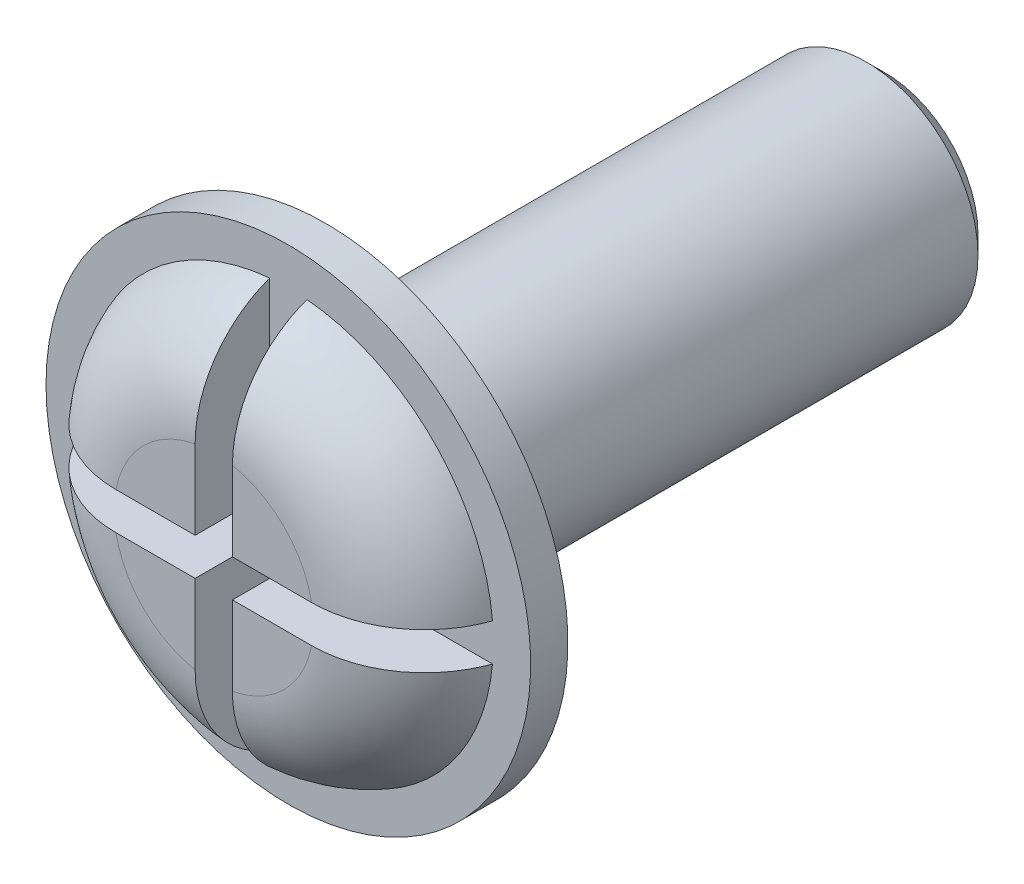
ISO-10303-21;
HEADER;
FILE_DESCRIPTION(('STEP AP214'),'2;1');
FILE_NAME('part.step','',(''),(''),'','','');
FILE_SCHEMA(('AUTOMOTIVE_DESIGN { 1 0 10303 214 1 1 1 1 }'));
ENDSEC;
DATA;
#1=APPLICATION_CONTEXT('core data for automotive mechanical design processes');
#2=APPLICATION_PROTOCOL_DEFINITION('international standard','automotive_design',2000,#1);
#3=PRODUCT_CONTEXT('',#1,'mechanical');
#4=PRODUCT('Part','Part','',(#3));
#5=PRODUCT_RELATED_PRODUCT_CATEGORY('part','',(#4));
#6=PRODUCT_DEFINITION_FORMATION('','',#4);
#7=PRODUCT_DEFINITION_CONTEXT('part definition',#1,'design');
#8=PRODUCT_DEFINITION('design','',#6,#7);
#9=PRODUCT_DEFINITION_SHAPE('','',#8);
#10=(LENGTH_UNIT() NAMED_UNIT(*) SI_UNIT(.MILLI.,.METRE.));
#11=(NAMED_UNIT(*) PLANE_ANGLE_UNIT() SI_UNIT($,.RADIAN.));
#12=(NAMED_UNIT(*) SI_UNIT($,.STERADIAN.) SOLID_ANGLE_UNIT());
#13=UNCERTAINTY_MEASURE_WITH_UNIT(LENGTH_MEASURE(1.E-05),#10,'distance_accuracy_value','');
#14=(GEOMETRIC_REPRESENTATION_CONTEXT(3) GLOBAL_UNCERTAINTY_ASSIGNED_CONTEXT((#13)) GLOBAL_UNIT_ASSIGNED_CONTEXT((#10,
#11,#12)) REPRESENTATION_CONTEXT('',''));
#15=CARTESIAN_POINT('',(0.,0.,0.));
#16=DIRECTION('',(0.,0.,1.));
#17=DIRECTION('',(1.,0.,0.));
#18=AXIS2_PLACEMENT_3D('',#15,#16,#17);
#19=CARTESIAN_POINT('',(0.,0.,18.));
#20=DIRECTION('',(0.,0.,1.));
#21=DIRECTION('',(1.,0.,0.));
#22=AXIS2_PLACEMENT_3D('',#19,#20,#21);
#23=PLANE('',#22);
#24=DIRECTION('',(0.,1.,0.));
#25=VECTOR('',#24,1.);
#26=CARTESIAN_POINT('',(0.5,7.68456440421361,18.));
#27=LINE('',#26,#25);
#28=CARTESIAN_POINT('',(0.499999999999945,0.499999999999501,18.));
#29=VERTEX_POINT('',#28);
#30=CARTESIAN_POINT('',(0.5,2.62436690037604,18.));
#31=VERTEX_POINT('',#30);
#32=EDGE_CURVE('E145',#29,#31,#27,.T.);
#33=ORIENTED_EDGE('',*,*,#32,.F.);
#34=DIRECTION('',(-1.,0.,0.));
#35=VECTOR('',#34,1.);
#36=CARTESIAN_POINT('',(0.499999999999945,0.499999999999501,18.));
#37=LINE('',#36,#35);
#38=CARTESIAN_POINT('',(2.62436690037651,0.499999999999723,17.9999999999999));
#39=VERTEX_POINT('',#38);
#40=EDGE_CURVE('E197',#39,#29,#37,.T.);
#41=ORIENTED_EDGE('',*,*,#40,.F.);
#42=CARTESIAN_POINT('',(0.,0.,18.));
#43=DIRECTION('',(0.,0.,1.));
#44=DIRECTION('',(1.,0.,0.));
#45=AXIS2_PLACEMENT_3D('',#42,#43,#44);
#46=CIRCLE('',#45,2.67157287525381);
#47=EDGE_CURVE('E238',#39,#31,#46,.T.);
#48=ORIENTED_EDGE('',*,*,#47,.T.);
#49=EDGE_LOOP('',(#33,#41,#48));
#50=FACE_BOUND('',#49,.T.);
#51=ADVANCED_FACE('F40',(#50),#23,.T.);
#52=DIRECTION('',(1.,0.,0.));
#53=VECTOR('',#52,1.);
#54=CARTESIAN_POINT('',(0.5,-0.500000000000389,18.0000000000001));
#55=LINE('',#54,#53);
#56=CARTESIAN_POINT('',(0.5,-0.500000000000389,18.0000000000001));
#57=VERTEX_POINT('',#56);
#58=CARTESIAN_POINT('',(2.62436690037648,-0.500000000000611,17.9999999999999));
#59=VERTEX_POINT('',#58);
#60=EDGE_CURVE('E194',#57,#59,#55,.T.);
#61=ORIENTED_EDGE('',*,*,#60,.F.);
#62=DIRECTION('',(0.,1.,0.));
#63=VECTOR('',#62,1.);
#64=CARTESIAN_POINT('',(0.5,-0.500000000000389,18.0000000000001));
#65=LINE('',#64,#63);
#66=CARTESIAN_POINT('',(0.5,-2.62436690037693,18.));
#67=VERTEX_POINT('',#66);
#68=EDGE_CURVE('E191',#67,#57,#65,.T.);
#69=ORIENTED_EDGE('',*,*,#68,.F.);
#70=EDGE_CURVE('E234',#67,#59,#46,.T.);
#71=ORIENTED_EDGE('',*,*,#70,.T.);
#72=EDGE_LOOP('',(#61,#69,#71));
#73=FACE_BOUND('',#72,.T.);
#74=ADVANCED_FACE('F298',(#73),#23,.T.);
#75=DIRECTION('',(0.,-1.,0.));
#76=VECTOR('',#75,1.);
#77=CARTESIAN_POINT('',(-0.5,-0.500000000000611,18.0000000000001));
#78=LINE('',#77,#76);
#79=CARTESIAN_POINT('',(-0.5,-0.500000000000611,18.0000000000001));
#80=VERTEX_POINT('',#79);
#81=CARTESIAN_POINT('',(-0.500000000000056,-2.62436690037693,18.0000000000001));
#82=VERTEX_POINT('',#81);
#83=EDGE_CURVE('E188',#80,#82,#78,.T.);
#84=ORIENTED_EDGE('',*,*,#83,.F.);
#85=DIRECTION('',(1.,0.,0.));
#86=VECTOR('',#85,1.);
#87=CARTESIAN_POINT('',(-7.90131142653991,-0.500000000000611,18.));
#88=LINE('',#87,#86);
#89=CARTESIAN_POINT('',(-2.62436690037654,-0.500000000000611,18.0000000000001));
#90=VERTEX_POINT('',#89);
#91=EDGE_CURVE('E185',#90,#80,#88,.T.);
#92=ORIENTED_EDGE('',*,*,#91,.F.);
#93=EDGE_CURVE('E400',#90,#82,#46,.T.);
#94=ORIENTED_EDGE('',*,*,#93,.T.);
#95=EDGE_LOOP('',(#84,#92,#94));
#96=FACE_BOUND('',#95,.T.);
#97=ADVANCED_FACE('F282',(#96),#23,.T.);
#98=CARTESIAN_POINT('',(0.,0.,15.));
#99=DIRECTION('',(0.,0.,-1.));
#100=DIRECTION('',(-1.,0.,0.));
#101=AXIS2_PLACEMENT_3D('',#98,#99,#100);
#102=DEGENERATE_TOROIDAL_SURFACE('',#101,2.67157287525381,3.,.T.);
#103=CARTESIAN_POINT('',(-0.5,-4.88536480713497,13.0036327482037));
#104=CARTESIAN_POINT('',(-0.5,-4.82888139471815,12.9405923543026));
#105=CARTESIAN_POINT('',(-0.5,-4.76971995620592,12.8799583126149));
#106=CARTESIAN_POINT('',(-0.5,-4.64649619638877,12.7639026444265));
#107=CARTESIAN_POINT('',(-0.5,-4.58243424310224,12.708480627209));
#108=CARTESIAN_POINT('',(-0.5,-4.4497522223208,12.6031567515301));
#109=CARTESIAN_POINT('',(-0.5,-4.38112517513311,12.5532636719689));
#110=CARTESIAN_POINT('',(-0.5,-4.23993062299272,12.4594511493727));
#111=CARTESIAN_POINT('',(-0.5,-4.16736313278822,12.4155316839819));
#112=CARTESIAN_POINT('',(-0.500000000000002,-3.9445121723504,12.2932132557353));
#113=CARTESIAN_POINT('',(-0.500000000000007,-3.7889531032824,12.2241536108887));
#114=CARTESIAN_POINT('',(-0.499999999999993,-3.46893713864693,12.1131194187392));
#115=CARTESIAN_POINT('',(-0.499999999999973,-3.30449902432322,12.0710899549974));
#116=CARTESIAN_POINT('',(-0.499999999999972,-2.9697632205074,12.014581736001));
#117=CARTESIAN_POINT('',(-0.49999999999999,-2.79943443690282,12.0002834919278));
#118=CARTESIAN_POINT('',(-0.500000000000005,-2.54384146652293,11.9998634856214));
#119=CARTESIAN_POINT('',(-0.500000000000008,-2.45845961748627,12.0032554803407));
#120=CARTESIAN_POINT('',(-0.499999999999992,-2.28823944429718,12.0169714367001));
#121=CARTESIAN_POINT('',(-0.499999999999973,-2.20340108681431,12.0272949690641));
#122=CARTESIAN_POINT('',(-0.499999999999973,-2.03294696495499,12.0550054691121));
#123=CARTESIAN_POINT('',(-0.499999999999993,-1.94735621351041,12.0725451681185));
#124=CARTESIAN_POINT('',(-0.500000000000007,-1.77781875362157,12.1144043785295));
#125=CARTESIAN_POINT('',(-0.500000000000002,-1.69387268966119,12.1387264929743));
#126=CARTESIAN_POINT('',(-0.499999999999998,-1.52805845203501,12.1937614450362));
#127=CARTESIAN_POINT('',(-0.499999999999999,-1.44619148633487,12.224477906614));
#128=CARTESIAN_POINT('',(-0.500000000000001,-1.28504266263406,12.2916617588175));
#129=CARTESIAN_POINT('',(-0.500000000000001,-1.20575634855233,12.328118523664));
#130=CARTESIAN_POINT('',(-0.5,-1.04086269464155,12.4104668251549));
#131=CARTESIAN_POINT('',(-0.5,-0.955557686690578,12.4569594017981));
#132=CARTESIAN_POINT('',(-0.5,-0.829210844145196,12.5301754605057));
#133=CARTESIAN_POINT('',(-0.5,-0.787200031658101,12.55526704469));
#134=CARTESIAN_POINT('',(-0.5,-0.703616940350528,12.6061721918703));
#135=CARTESIAN_POINT('',(-0.5,-0.662044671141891,12.6319857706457));
#136=CARTESIAN_POINT('',(-0.5,-0.58017017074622,12.6830143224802));
#137=CARTESIAN_POINT('',(-0.5,-0.539865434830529,12.7082254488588));
#138=CARTESIAN_POINT('',(-0.5,-0.458657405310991,12.7579807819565));
#139=CARTESIAN_POINT('',(-0.5,-0.417752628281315,12.7825226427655));
#140=CARTESIAN_POINT('',(-0.5,-0.355689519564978,12.8172981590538));
#141=CARTESIAN_POINT('',(-0.5,-0.335066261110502,12.8284620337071));
#142=CARTESIAN_POINT('',(-0.5,-0.29333993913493,12.8498470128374));
#143=CARTESIAN_POINT('',(-0.5,-0.272236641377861,12.8600676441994));
#144=CARTESIAN_POINT('',(-0.5,-0.20819513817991,12.8885334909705));
#145=CARTESIAN_POINT('',(-0.500000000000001,-0.164217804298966,12.9047707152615));
#146=CARTESIAN_POINT('',(-0.5,-0.104051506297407,12.9191771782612));
#147=CARTESIAN_POINT('',(-0.5,-0.0890266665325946,12.9221582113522));
#148=CARTESIAN_POINT('',(-0.5,-0.0587548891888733,12.9267809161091));
#149=CARTESIAN_POINT('',(-0.5,-0.043507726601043,12.9284211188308));
#150=CARTESIAN_POINT('',(-0.5,0.00212348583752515,12.9310962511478));
#151=CARTESIAN_POINT('',(-0.500000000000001,0.0326646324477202,12.9299540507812));
#152=CARTESIAN_POINT('',(-0.5,0.0995386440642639,12.9212643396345));
#153=CARTESIAN_POINT('',(-0.499999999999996,0.135683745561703,12.9123756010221));
#154=CARTESIAN_POINT('',(-0.500000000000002,0.188659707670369,12.8949013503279));
#155=CARTESIAN_POINT('',(-0.500000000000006,0.206231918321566,12.8883244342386));
#156=CARTESIAN_POINT('',(-0.499999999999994,0.240945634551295,12.8741156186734));
#157=CARTESIAN_POINT('',(-0.499999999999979,0.25808722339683,12.8664839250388));
#158=CARTESIAN_POINT('',(-0.49999999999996,0.310774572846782,12.8415827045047));
#159=CARTESIAN_POINT('',(-0.499999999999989,0.345686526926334,12.8229967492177));
#160=CARTESIAN_POINT('',(-0.500000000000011,0.414596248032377,12.7841856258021));
#161=CARTESIAN_POINT('',(-0.500000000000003,0.44859299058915,12.7639587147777));
#162=CARTESIAN_POINT('',(-0.499999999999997,0.516259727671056,12.7228006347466));
#163=CARTESIAN_POINT('',(-0.499999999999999,0.549928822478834,12.7018679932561));
#164=CARTESIAN_POINT('',(-0.500000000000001,0.617220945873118,12.6599285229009));
#165=CARTESIAN_POINT('',(-0.5,0.650843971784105,12.6389216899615));
#166=CARTESIAN_POINT('',(-0.5,0.751736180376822,12.5765528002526));
#167=CARTESIAN_POINT('',(-0.5,0.819305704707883,12.5356636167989));
#168=CARTESIAN_POINT('',(-0.5,0.956133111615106,12.4569452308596));
#169=CARTESIAN_POINT('',(-0.5,1.02538920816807,12.4191129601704));
#170=CARTESIAN_POINT('',(-0.5,1.18383029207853,12.3382989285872));
#171=CARTESIAN_POINT('',(-0.5,1.27360395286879,12.2964547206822));
#172=CARTESIAN_POINT('',(-0.5,1.4563176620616,12.2202322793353));
#173=CARTESIAN_POINT('',(-0.5,1.54925861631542,12.1858562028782));
#174=CARTESIAN_POINT('',(-0.5,1.73830684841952,12.1252159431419));
#175=CARTESIAN_POINT('',(-0.5,1.83442827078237,12.0989956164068));
#176=CARTESIAN_POINT('',(-0.5,2.0286797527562,12.0554775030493));
#177=CARTESIAN_POINT('',(-0.500000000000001,2.12680982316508,12.0381797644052));
#178=CARTESIAN_POINT('',(-0.5,2.32271578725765,12.0130818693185));
#179=CARTESIAN_POINT('',(-0.5,2.42047306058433,12.0051368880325));
#180=CARTESIAN_POINT('',(-0.500000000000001,2.61630410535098,11.9984715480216));
#181=CARTESIAN_POINT('',(-0.500000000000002,2.71437787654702,11.9997511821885));
#182=CARTESIAN_POINT('',(-0.499999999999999,2.90970384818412,12.0116154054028));
#183=CARTESIAN_POINT('',(-0.499999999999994,3.0069575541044,12.0221747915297));
#184=CARTESIAN_POINT('',(-0.500000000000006,3.20002166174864,12.0525314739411));
#185=CARTESIAN_POINT('',(-0.500000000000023,3.29583154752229,12.0723319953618));
#186=CARTESIAN_POINT('',(-0.500000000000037,3.55908513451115,12.1401313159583));
#187=CARTESIAN_POINT('',(-0.50000000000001,3.72408498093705,12.1980771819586));
#188=CARTESIAN_POINT('',(-0.49999999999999,4.04165573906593,12.3414974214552));
#189=CARTESIAN_POINT('',(-0.499999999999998,4.19422148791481,12.4269831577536));
#190=CARTESIAN_POINT('',(-0.500000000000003,4.47894401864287,12.6207440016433));
#191=CARTESIAN_POINT('',(-0.500000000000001,4.61149356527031,12.7284415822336));
#192=CARTESIAN_POINT('',(-0.5,4.85641942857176,12.9646949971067));
#193=CARTESIAN_POINT('',(-0.5,4.96880083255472,13.0932455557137));
#194=CARTESIAN_POINT('',(-0.500000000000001,5.16936785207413,13.3664841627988));
#195=CARTESIAN_POINT('',(-0.5,5.2577325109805,13.5110408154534));
#196=CARTESIAN_POINT('',(-0.5,5.40885027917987,13.8129834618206));
#197=CARTESIAN_POINT('',(-0.5,5.47160242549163,13.970369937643));
#198=CARTESIAN_POINT('',(-0.5,5.56950961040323,14.2929308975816));
#199=CARTESIAN_POINT('',(-0.5,5.60475572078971,14.4580777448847));
#200=CARTESIAN_POINT('',(-0.5,5.64698299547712,14.7919435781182));
#201=CARTESIAN_POINT('',(-0.500000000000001,5.65396483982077,14.9606624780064));
#202=CARTESIAN_POINT('',(-0.5,5.63947332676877,15.2966620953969));
#203=CARTESIAN_POINT('',(-0.5,5.61803540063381,15.4639443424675));
#204=CARTESIAN_POINT('',(-0.500000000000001,5.54738196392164,15.7925355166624));
#205=CARTESIAN_POINT('',(-0.500000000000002,5.49816648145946,15.9538444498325));
#206=CARTESIAN_POINT('',(-0.499999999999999,5.37336293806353,16.2659346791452));
#207=CARTESIAN_POINT('',(-0.499999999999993,5.297771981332,16.4167148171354));
#208=CARTESIAN_POINT('',(-0.500000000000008,5.12238503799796,16.7034697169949));
#209=CARTESIAN_POINT('',(-0.500000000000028,5.02258883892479,16.8394443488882));
#210=CARTESIAN_POINT('',(-0.500000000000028,4.80147626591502,17.0929650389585));
#211=CARTESIAN_POINT('',(-0.500000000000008,4.68012703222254,17.2104824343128));
#212=CARTESIAN_POINT('',(-0.499999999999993,4.41948854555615,17.4235607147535));
#213=CARTESIAN_POINT('',(-0.499999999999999,4.2801995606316,17.5191219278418));
#214=CARTESIAN_POINT('',(-0.500000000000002,3.98709664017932,17.6860002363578));
#215=CARTESIAN_POINT('',(-0.500000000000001,3.83323015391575,17.7572249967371));
#216=CARTESIAN_POINT('',(-0.5,3.5157836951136,17.8730693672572));
#217=CARTESIAN_POINT('',(-0.5,3.35220302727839,17.9176870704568));
#218=CARTESIAN_POINT('',(-0.500000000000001,3.01850644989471,17.9795764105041));
#219=CARTESIAN_POINT('',(-0.5,2.84834610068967,17.9966070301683));
#220=CARTESIAN_POINT('',(-0.5,2.50751500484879,18.0024693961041));
#221=CARTESIAN_POINT('',(-0.500000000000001,2.33684432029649,17.9913044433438));
#222=CARTESIAN_POINT('',(-0.5,2.0820488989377,17.9539673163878));
#223=CARTESIAN_POINT('',(-0.5,1.99633297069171,17.9377772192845));
#224=CARTESIAN_POINT('',(-0.5,1.82647744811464,17.8985877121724));
#225=CARTESIAN_POINT('',(-0.5,1.74233745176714,17.875590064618));
#226=CARTESIAN_POINT('',(-0.5,1.57612294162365,17.8231637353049));
#227=CARTESIAN_POINT('',(-0.5,1.49404791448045,17.7937366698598));
#228=CARTESIAN_POINT('',(-0.5,1.33228398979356,17.7289807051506));
#229=CARTESIAN_POINT('',(-0.5,1.25259479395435,17.6936525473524));
#230=CARTESIAN_POINT('',(-0.5,1.0887733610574,17.6144442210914));
#231=CARTESIAN_POINT('',(-0.5,1.00487503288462,17.570083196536));
#232=CARTESIAN_POINT('',(-0.5,0.881063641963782,17.5001096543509));
#233=CARTESIAN_POINT('',(-0.5,0.840151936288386,17.4762255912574));
#234=CARTESIAN_POINT('',(-0.5,0.758828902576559,17.4276171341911));
#235=CARTESIAN_POINT('',(-0.5,0.718417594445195,17.4028927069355));
#236=CARTESIAN_POINT('',(-0.500000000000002,0.624621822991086,17.3448043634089));
#237=CARTESIAN_POINT('',(-0.500000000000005,0.571341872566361,17.3112734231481));
#238=CARTESIAN_POINT('',(-0.499999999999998,0.490881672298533,17.2617042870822));
#239=CARTESIAN_POINT('',(-0.499999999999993,0.463939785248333,17.2452837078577));
#240=CARTESIAN_POINT('',(-0.500000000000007,0.409657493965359,17.2131195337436));
#241=CARTESIAN_POINT('',(-0.500000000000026,0.382317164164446,17.1973758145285));
#242=CARTESIAN_POINT('',(-0.500000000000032,0.318116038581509,17.1623235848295));
#243=CARTESIAN_POINT('',(-0.500000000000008,0.28099679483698,17.1434770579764));
#244=CARTESIAN_POINT('',(-0.499999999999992,0.204780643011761,17.1103750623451));
#245=CARTESIAN_POINT('',(-0.499999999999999,0.1656930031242,17.0961000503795));
#246=CARTESIAN_POINT('',(-0.500000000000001,0.0973628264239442,17.0789276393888));
#247=CARTESIAN_POINT('',(-0.499999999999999,0.0686885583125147,17.0739009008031));
#248=CARTESIAN_POINT('',(-0.500000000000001,0.01092585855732,17.0691125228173));
#249=CARTESIAN_POINT('',(-0.500000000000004,-0.0181616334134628,17.0693404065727));
#250=CARTESIAN_POINT('',(-0.499999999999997,-0.0756742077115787,17.0749597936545));
#251=CARTESIAN_POINT('',(-0.499999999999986,-0.104101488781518,17.080330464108));
#252=CARTESIAN_POINT('',(-0.500000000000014,-0.159943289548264,17.0950271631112));
#253=CARTESIAN_POINT('',(-0.500000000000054,-0.187354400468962,17.1043653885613));
#254=CARTESIAN_POINT('',(-0.500000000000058,-0.243757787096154,17.126707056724));
#255=CARTESIAN_POINT('',(-0.500000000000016,-0.272638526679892,17.1399815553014));
#256=CARTESIAN_POINT('',(-0.499999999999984,-0.329476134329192,17.1683990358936));
#257=CARTESIAN_POINT('',(-0.499999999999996,-0.35743193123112,17.1835440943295));
#258=CARTESIAN_POINT('',(-0.500000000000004,-0.412868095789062,17.2149296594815));
#259=CARTESIAN_POINT('',(-0.500000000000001,-0.440345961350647,17.2311745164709));
#260=CARTESIAN_POINT('',(-0.499999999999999,-0.494980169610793,17.2641699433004));
#261=CARTESIAN_POINT('',(-0.5,-0.52213661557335,17.2809203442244));
#262=CARTESIAN_POINT('',(-0.500000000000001,-0.603865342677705,17.3316387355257));
#263=CARTESIAN_POINT('',(-0.5,-0.658297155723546,17.3658317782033));
#264=CARTESIAN_POINT('',(-0.5,-0.767822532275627,17.4331478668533));
#265=CARTESIAN_POINT('',(-0.5,-0.822916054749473,17.4662709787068));
#266=CARTESIAN_POINT('',(-0.5,-0.934213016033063,17.5305658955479));
#267=CARTESIAN_POINT('',(-0.5,-0.990415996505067,17.5617384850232));
#268=CARTESIAN_POINT('',(-0.5,-1.10413813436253,17.6215795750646));
#269=CARTESIAN_POINT('',(-0.5,-1.16165727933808,17.6502480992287));
#270=CARTESIAN_POINT('',(-0.5,-1.33545760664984,17.731510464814));
#271=CARTESIAN_POINT('',(-0.5,-1.45378673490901,17.7798402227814));
#272=CARTESIAN_POINT('',(-0.5,-1.69519640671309,17.8630036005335));
#273=CARTESIAN_POINT('',(-0.500000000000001,-1.81827880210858,17.8978319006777));
#274=CARTESIAN_POINT('',(-0.5,-2.02824795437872,17.9440847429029));
#275=CARTESIAN_POINT('',(-0.5,-2.11428726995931,17.9594268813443));
#276=CARTESIAN_POINT('',(-0.5,-2.2873053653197,17.9829730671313));
#277=CARTESIAN_POINT('',(-0.5,-2.37428367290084,17.9911805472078));
#278=CARTESIAN_POINT('',(-0.5,-2.54894464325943,18.00031289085));
#279=CARTESIAN_POINT('',(-0.5,-2.63662871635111,18.001211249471));
#280=CARTESIAN_POINT('',(-0.5,-2.81176591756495,17.9955780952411));
#281=CARTESIAN_POINT('',(-0.5,-2.89921896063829,17.989044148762));
#282=CARTESIAN_POINT('',(-0.500000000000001,-3.16026438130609,17.9582363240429));
#283=CARTESIAN_POINT('',(-0.5,-3.33266965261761,17.9227631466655));
#284=CARTESIAN_POINT('',(-0.5,-3.66854830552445,17.8226800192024));
#285=CARTESIAN_POINT('',(-0.500000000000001,-3.83203408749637,17.7581117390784));
#286=CARTESIAN_POINT('',(-0.5,-4.07298941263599,17.6378508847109));
#287=CARTESIAN_POINT('',(-0.5,-4.15538412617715,17.5917763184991));
#288=CARTESIAN_POINT('',(-0.5,-4.31552103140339,17.4920906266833));
#289=CARTESIAN_POINT('',(-0.5,-4.39326280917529,17.4384788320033));
#290=CARTESIAN_POINT('',(-0.5,-4.54368081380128,17.323939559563));
#291=CARTESIAN_POINT('',(-0.5,-4.61633374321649,17.2629815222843));
#292=CARTESIAN_POINT('',(-0.5,-4.75556618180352,17.1344780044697));
#293=CARTESIAN_POINT('',(-0.5,-4.82214535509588,17.0669321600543));
#294=CARTESIAN_POINT('',(-0.5,-4.88536480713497,16.9963672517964));
#295=B_SPLINE_CURVE_WITH_KNOTS('',3,(#103,#104,#105,#106,#107,#108,#109,#110,#111,#112,#113,
#114,#115,#116,#117,#118,#119,#120,#121,#122,#123,#124,#125,#126,#127,#128,#129,#130,#131,#132,
#133,#134,#135,#136,#137,#138,#139,#140,#141,#142,#143,#144,#145,#146,#147,#148,#149,#150,#151,
#152,#153,#154,#155,#156,#157,#158,#159,#160,#161,#162,#163,#164,#165,#166,#167,#168,#169,#170,
#171,#172,#173,#174,#175,#176,#177,#178,#179,#180,#181,#182,#183,#184,#185,#186,#187,#188,#189,
#190,#191,#192,#193,#194,#195,#196,#197,#198,#199,#200,#201,#202,#203,#204,#205,#206,#207,#208,
#209,#210,#211,#212,#213,#214,#215,#216,#217,#218,#219,#220,#221,#222,#223,#224,#225,#226,#227,
#228,#229,#230,#231,#232,#233,#234,#235,#236,#237,#238,#239,#240,#241,#242,#243,#244,#245,#246,
#247,#248,#249,#250,#251,#252,#253,#254,#255,#256,#257,#258,#259,#260,#261,#262,#263,#264,#265,
#266,#267,#268,#269,#270,#271,#272,#273,#274,#275,#276,#277,#278,#279,#280,#281,#282,#283,#284,
#285,#286,#287,#288,#289,#290,#291,#292,#293,#294),.UNSPECIFIED.,.F.,.F.,(4,2,2,2,2,2,2,2,2,2,2,
2,2,2,2,2,2,2,2,2,2,2,2,2,2,2,2,2,2,2,2,2,2,2,2,2,2,2,2,2,2,2,2,2,2,2,2,2,2,2,2,2,2,2,2,2,2,2,2,
2,2,2,2,2,2,2,2,2,2,2,2,2,2,2,2,2,2,2,2,2,2,2,2,2,2,2,2,2,2,2,2,2,2,2,2,4),(0.,
0.253844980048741,0.507670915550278,0.761894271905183,1.01611667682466,1.52408120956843,
2.03101043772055,2.54122849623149,2.79734416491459,3.05344397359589,3.31526840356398,
3.57719345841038,3.83926736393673,4.10086173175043,4.39211078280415,4.53890637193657,
4.68570517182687,4.82833034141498,4.97140390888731,5.04172914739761,5.11208947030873,
5.25173085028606,5.29762941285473,5.34357819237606,5.43466145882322,5.54558780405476,
5.60185778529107,5.65811680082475,5.77665765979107,5.89532611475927,6.01425969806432,
6.13319991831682,6.37009082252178,6.60674092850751,6.9035797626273,7.20050421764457,
7.49899879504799,7.79749497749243,8.09130555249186,8.38511590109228,8.67813074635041,
8.9712479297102,9.49310002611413,10.0151677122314,10.5250687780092,11.034841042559,
11.5407016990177,12.0465813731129,12.5507789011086,13.0549642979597,13.5585217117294,
14.0620786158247,14.5656908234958,15.0693074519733,15.5736985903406,16.0780821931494,
16.5843587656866,17.0906716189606,17.6013845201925,18.1120376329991,18.3734982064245,
18.6348911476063,18.896218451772,19.1575129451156,19.4420121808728,19.5841236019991,
19.7262406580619,19.9150987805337,20.0097491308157,20.1043820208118,20.2291597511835,
20.3533967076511,20.4403268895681,20.5270837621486,20.6134906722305,20.7001651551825,
20.7954072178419,20.8907559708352,20.9865068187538,21.082226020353,21.2750666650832,
21.467895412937,21.6606461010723,21.8533949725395,22.2360938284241,22.6189433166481,
22.8808607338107,23.1426520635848,23.4053923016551,23.6682185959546,24.1934958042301,
24.7180230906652,25.0008718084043,25.2837456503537,25.567839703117,25.8519494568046),.UNSPECIFIED.);
#296=CARTESIAN_POINT('',(-0.5,5.47722557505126,16.));
#297=VERTEX_POINT('',#296);
#298=CARTESIAN_POINT('',(-0.5,2.62436690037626,18.));
#299=VERTEX_POINT('',#298);
#300=EDGE_CURVE('E11',#297,#299,#295,.T.);
#301=ORIENTED_EDGE('',*,*,#300,.F.);
#302=CARTESIAN_POINT('',(0.,0.,16.));
#303=DIRECTION('',(0.,0.,-1.));
#304=DIRECTION('',(-1.,0.,0.));
#305=AXIS2_PLACEMENT_3D('',#302,#303,#304);
#306=CIRCLE('',#305,5.5);
#307=CARTESIAN_POINT('',(-5.47722557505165,0.499999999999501,16.));
#308=VERTEX_POINT('',#307);
#309=EDGE_CURVE('E141',#308,#297,#306,.T.);
#310=ORIENTED_EDGE('',*,*,#309,.F.);
#311=CARTESIAN_POINT('',(4.88536480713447,0.499999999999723,16.9963672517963));
#312=CARTESIAN_POINT('',(4.82888139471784,0.499999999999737,17.0594076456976));
#313=CARTESIAN_POINT('',(4.76971995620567,0.49999999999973,17.1200416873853));
#314=CARTESIAN_POINT('',(4.64649619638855,0.499999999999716,17.2360973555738));
#315=CARTESIAN_POINT('',(4.582434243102,0.499999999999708,17.2915193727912));
#316=CARTESIAN_POINT('',(4.44975222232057,0.499999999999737,17.3968432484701));
#317=CARTESIAN_POINT('',(4.3811251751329,0.499999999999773,17.4467363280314));
#318=CARTESIAN_POINT('',(4.23993062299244,0.499999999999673,17.5405488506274));
#319=CARTESIAN_POINT('',(4.16736313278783,0.499999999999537,17.584468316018));
#320=CARTESIAN_POINT('',(3.94451217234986,0.499999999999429,17.7067867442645));
#321=CARTESIAN_POINT('',(3.788953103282,0.499999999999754,17.7758463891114));
#322=CARTESIAN_POINT('',(3.4689371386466,0.499999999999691,17.8868805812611));
#323=CARTESIAN_POINT('',(3.30449902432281,0.499999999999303,17.9289100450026));
#324=CARTESIAN_POINT('',(2.96976322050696,0.499999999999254,17.9854182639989));
#325=CARTESIAN_POINT('',(2.79943443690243,0.499999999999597,17.9997165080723));
#326=CARTESIAN_POINT('',(2.5438414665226,0.499999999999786,18.0001365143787));
#327=CARTESIAN_POINT('',(2.45845961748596,0.499999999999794,17.9967445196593));
#328=CARTESIAN_POINT('',(2.2882394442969,0.499999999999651,17.9830285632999));
#329=CARTESIAN_POINT('',(2.20340108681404,0.499999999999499,17.9727050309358));
#330=CARTESIAN_POINT('',(2.03294696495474,0.499999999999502,17.9449945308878));
#331=CARTESIAN_POINT('',(1.94735621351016,0.499999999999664,17.9274548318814));
#332=CARTESIAN_POINT('',(1.77781875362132,0.499999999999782,17.8855956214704));
#333=CARTESIAN_POINT('',(1.69387268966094,0.499999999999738,17.8612735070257));
#334=CARTESIAN_POINT('',(1.52805845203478,0.499999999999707,17.8062385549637));
#335=CARTESIAN_POINT('',(1.44619148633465,0.499999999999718,17.7755220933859));
#336=CARTESIAN_POINT('',(1.28504266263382,0.499999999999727,17.7083382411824));
#337=CARTESIAN_POINT('',(1.20575634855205,0.499999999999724,17.671881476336));
#338=CARTESIAN_POINT('',(1.04086269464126,0.499999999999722,17.5895331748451));
#339=CARTESIAN_POINT('',(0.955557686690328,0.499999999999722,17.5430405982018));
#340=CARTESIAN_POINT('',(0.829210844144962,0.499999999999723,17.4698245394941));
#341=CARTESIAN_POINT('',(0.787200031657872,0.499999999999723,17.4447329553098));
#342=CARTESIAN_POINT('',(0.703616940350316,0.499999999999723,17.3938278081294));
#343=CARTESIAN_POINT('',(0.66204467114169,0.499999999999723,17.3680142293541));
#344=CARTESIAN_POINT('',(0.580170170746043,0.499999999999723,17.3169856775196));
#345=CARTESIAN_POINT('',(0.539865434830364,0.499999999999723,17.291774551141));
#346=CARTESIAN_POINT('',(0.458657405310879,0.499999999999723,17.2420192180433));
#347=CARTESIAN_POINT('',(0.417752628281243,0.499999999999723,17.2174773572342));
#348=CARTESIAN_POINT('',(0.355689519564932,0.499999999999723,17.1827018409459));
#349=CARTESIAN_POINT('',(0.335066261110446,0.499999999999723,17.1715379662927));
#350=CARTESIAN_POINT('',(0.293339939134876,0.499999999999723,17.1501529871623));
#351=CARTESIAN_POINT('',(0.27223664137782,0.499999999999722,17.1399323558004));
#352=CARTESIAN_POINT('',(0.208195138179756,0.499999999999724,17.1114665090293));
#353=CARTESIAN_POINT('',(0.164217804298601,0.499999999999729,17.0952292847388));
#354=CARTESIAN_POINT('',(0.104051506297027,0.499999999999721,17.0808228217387));
#355=CARTESIAN_POINT('',(0.0890266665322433,0.499999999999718,17.0778417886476));
#356=CARTESIAN_POINT('',(0.0587548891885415,0.499999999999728,17.0732190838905));
#357=CARTESIAN_POINT('',(0.0435077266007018,0.499999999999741,17.0715788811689));
#358=CARTESIAN_POINT('',(-0.00212348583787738,0.499999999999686,17.068903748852));
#359=CARTESIAN_POINT('',(-0.0326646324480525,0.499999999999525,17.0700459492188));
#360=CARTESIAN_POINT('',(-0.0995386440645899,0.499999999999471,17.0787356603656));
#361=CARTESIAN_POINT('',(-0.135683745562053,0.499999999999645,17.0876243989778));
#362=CARTESIAN_POINT('',(-0.188659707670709,0.499999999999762,17.105098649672));
#363=CARTESIAN_POINT('',(-0.206231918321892,0.499999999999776,17.1116755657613));
#364=CARTESIAN_POINT('',(-0.240945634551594,0.499999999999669,17.1258843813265));
#365=CARTESIAN_POINT('',(-0.258087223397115,0.499999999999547,17.1335160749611));
#366=CARTESIAN_POINT('',(-0.310774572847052,0.499999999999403,17.1584172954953));
#367=CARTESIAN_POINT('',(-0.345686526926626,0.499999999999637,17.1770032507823));
#368=CARTESIAN_POINT('',(-0.414596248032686,0.499999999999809,17.2158143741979));
#369=CARTESIAN_POINT('',(-0.448592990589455,0.499999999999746,17.2360412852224));
#370=CARTESIAN_POINT('',(-0.516259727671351,0.4999999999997,17.2771993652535));
#371=CARTESIAN_POINT('',(-0.549928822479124,0.499999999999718,17.298132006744));
#372=CARTESIAN_POINT('',(-0.617220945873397,0.499999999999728,17.3400714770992));
#373=CARTESIAN_POINT('',(-0.650843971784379,0.49999999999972,17.3610783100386));
#374=CARTESIAN_POINT('',(-0.751736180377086,0.499999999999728,17.4234471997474));
#375=CARTESIAN_POINT('',(-0.819305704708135,0.499999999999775,17.4643363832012));
#376=CARTESIAN_POINT('',(-0.956133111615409,0.499999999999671,17.5430547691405));
#377=CARTESIAN_POINT('',(-1.02538920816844,0.49999999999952,17.5808870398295));
#378=CARTESIAN_POINT('',(-1.1838302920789,0.499999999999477,17.6617010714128));
#379=CARTESIAN_POINT('',(-1.27360395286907,0.499999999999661,17.7035452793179));
#380=CARTESIAN_POINT('',(-1.45631766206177,0.499999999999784,17.7797677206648));
#381=CARTESIAN_POINT('',(-1.54925861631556,0.499999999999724,17.8141437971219));
#382=CARTESIAN_POINT('',(-1.7383068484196,0.499999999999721,17.8747840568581));
#383=CARTESIAN_POINT('',(-1.83442827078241,0.499999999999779,17.9010043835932));
#384=CARTESIAN_POINT('',(-2.02867975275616,0.499999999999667,17.9445224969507));
#385=CARTESIAN_POINT('',(-2.12680982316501,0.499999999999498,17.9618202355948));
#386=CARTESIAN_POINT('',(-2.32271578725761,0.499999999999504,17.9869181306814));
#387=CARTESIAN_POINT('',(-2.42047306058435,0.499999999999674,17.9948631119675));
#388=CARTESIAN_POINT('',(-2.61630410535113,0.499999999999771,18.0015284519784));
#389=CARTESIAN_POINT('',(-2.71437787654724,0.499999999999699,18.0002488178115));
#390=CARTESIAN_POINT('',(-2.90970384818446,0.499999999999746,17.9883845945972));
#391=CARTESIAN_POINT('',(-3.0069575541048,0.499999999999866,17.9778252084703));
#392=CARTESIAN_POINT('',(-3.20002166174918,0.49999999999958,17.9474685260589));
#393=CARTESIAN_POINT('',(-3.2958315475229,0.499999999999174,17.9276680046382));
#394=CARTESIAN_POINT('',(-3.55908513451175,0.499999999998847,17.8598686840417));
#395=CARTESIAN_POINT('',(-3.72408498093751,0.499999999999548,17.8019228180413));
#396=CARTESIAN_POINT('',(-4.04165573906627,0.499999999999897,17.6585025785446));
#397=CARTESIAN_POINT('',(-4.19422148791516,0.499999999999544,17.5730168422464));
#398=CARTESIAN_POINT('',(-4.47894401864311,0.499999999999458,17.3792559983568));
#399=CARTESIAN_POINT('',(-4.61149356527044,0.499999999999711,17.2715584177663));
#400=CARTESIAN_POINT('',(-4.85641942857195,0.499999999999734,17.0353050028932));
#401=CARTESIAN_POINT('',(-4.9688008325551,0.499999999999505,16.9067544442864));
#402=CARTESIAN_POINT('',(-5.16936785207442,0.499999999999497,16.6335158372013));
#403=CARTESIAN_POINT('',(-5.25773251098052,0.499999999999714,16.4889591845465));
#404=CARTESIAN_POINT('',(-5.40885027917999,0.499999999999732,16.1870165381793));
#405=CARTESIAN_POINT('',(-5.47160242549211,0.499999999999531,16.0296300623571));
#406=CARTESIAN_POINT('',(-5.56950961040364,0.49999999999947,15.7070691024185));
#407=CARTESIAN_POINT('',(-5.6047557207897,0.499999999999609,15.5419222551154));
#408=CARTESIAN_POINT('',(-5.6469829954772,0.499999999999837,15.2080564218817));
#409=CARTESIAN_POINT('',(-5.65396483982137,0.499999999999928,15.0393375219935));
#410=CARTESIAN_POINT('',(-5.6394733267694,0.499999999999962,14.7033379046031));
#411=CARTESIAN_POINT('',(-5.61803540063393,0.499999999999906,14.5360556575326));
#412=CARTESIAN_POINT('',(-5.5473819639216,0.499999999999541,14.2074644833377));
#413=CARTESIAN_POINT('',(-5.49816648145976,0.499999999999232,14.0461555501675));
#414=CARTESIAN_POINT('',(-5.37336293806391,0.499999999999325,13.7340653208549));
#415=CARTESIAN_POINT('',(-5.29777198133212,0.499999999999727,13.5832851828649));
#416=CARTESIAN_POINT('',(-5.12238503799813,0.499999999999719,13.2965302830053));
#417=CARTESIAN_POINT('',(-5.02258883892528,0.49999999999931,13.1605556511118));
#418=CARTESIAN_POINT('',(-4.80147626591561,0.499999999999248,12.9070349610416));
#419=CARTESIAN_POINT('',(-4.68012703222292,0.499999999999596,12.7895175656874));
#420=CARTESIAN_POINT('',(-4.41948854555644,0.49999999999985,12.5764392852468));
#421=CARTESIAN_POINT('',(-4.28019956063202,0.499999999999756,12.4808780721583));
#422=CARTESIAN_POINT('',(-3.98709664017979,0.49999999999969,12.3139997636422));
#423=CARTESIAN_POINT('',(-3.83323015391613,0.49999999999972,12.242775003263));
#424=CARTESIAN_POINT('',(-3.51578369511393,0.499999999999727,12.1269306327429));
#425=CARTESIAN_POINT('',(-3.35220302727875,0.499999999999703,12.0823129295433));
#426=CARTESIAN_POINT('',(-3.01850644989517,0.499999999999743,12.0204235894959));
#427=CARTESIAN_POINT('',(-2.84834610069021,0.499999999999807,12.0033929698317));
#428=CARTESIAN_POINT('',(-2.50751500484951,0.49999999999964,11.997530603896));
#429=CARTESIAN_POINT('',(-2.33684432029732,0.499999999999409,12.0086955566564));
#430=CARTESIAN_POINT('',(-2.08204889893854,0.499999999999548,12.0460326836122));
#431=CARTESIAN_POINT('',(-1.99633297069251,0.49999999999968,12.0622227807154));
#432=CARTESIAN_POINT('',(-1.82647744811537,0.499999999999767,12.1014122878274));
#433=CARTESIAN_POINT('',(-1.74233745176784,0.499999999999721,12.1244099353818));
#434=CARTESIAN_POINT('',(-1.57612294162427,0.499999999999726,12.1768362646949));
#435=CARTESIAN_POINT('',(-1.49404791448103,0.499999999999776,12.20626333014));
#436=CARTESIAN_POINT('',(-1.33228398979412,0.49999999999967,12.2710192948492));
#437=CARTESIAN_POINT('',(-1.25259479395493,0.499999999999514,12.3063474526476));
#438=CARTESIAN_POINT('',(-1.08877336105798,0.499999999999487,12.3855557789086));
#439=CARTESIAN_POINT('',(-1.00487503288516,0.499999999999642,12.4299168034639));
#440=CARTESIAN_POINT('',(-0.881063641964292,0.499999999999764,12.4998903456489));
#441=CARTESIAN_POINT('',(-0.840151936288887,0.499999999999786,12.5237744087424));
#442=CARTESIAN_POINT('',(-0.758828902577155,0.49999999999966,12.5723828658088));
#443=CARTESIAN_POINT('',(-0.718417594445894,0.499999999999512,12.5971072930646));
#444=CARTESIAN_POINT('',(-0.624621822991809,0.499999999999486,12.6551956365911));
#445=CARTESIAN_POINT('',(-0.571341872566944,0.499999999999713,12.6887265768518));
#446=CARTESIAN_POINT('',(-0.490881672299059,0.499999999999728,12.7382957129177));
#447=CARTESIAN_POINT('',(-0.463939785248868,0.499999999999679,12.7547162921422));
#448=CARTESIAN_POINT('',(-0.409657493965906,0.499999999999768,12.7868804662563));
#449=CARTESIAN_POINT('',(-0.382317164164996,0.499999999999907,12.8026241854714));
#450=CARTESIAN_POINT('',(-0.318116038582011,0.499999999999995,12.8376764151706));
#451=CARTESIAN_POINT('',(-0.280996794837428,0.499999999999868,12.8565229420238));
#452=CARTESIAN_POINT('',(-0.204780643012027,0.499999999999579,12.889624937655));
#453=CARTESIAN_POINT('',(-0.165693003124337,0.499999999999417,12.9038999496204));
#454=CARTESIAN_POINT('',(-0.0973628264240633,0.49999999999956,12.9210723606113));
#455=CARTESIAN_POINT('',(-0.0686885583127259,0.499999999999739,12.9260990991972));
#456=CARTESIAN_POINT('',(-0.0109258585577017,0.499999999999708,12.930887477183));
#457=CARTESIAN_POINT('',(0.0181616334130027,0.499999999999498,12.9306595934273));
#458=CARTESIAN_POINT('',(0.0756742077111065,0.499999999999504,12.9250402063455));
#459=CARTESIAN_POINT('',(0.104101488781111,0.499999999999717,12.9196695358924));
#460=CARTESIAN_POINT('',(0.159943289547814,0.499999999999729,12.9049728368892));
#461=CARTESIAN_POINT('',(0.187354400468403,0.499999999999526,12.8956346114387));
#462=CARTESIAN_POINT('',(0.243757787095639,0.499999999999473,12.873292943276));
#463=CARTESIAN_POINT('',(0.272638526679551,0.499999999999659,12.8600184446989));
#464=CARTESIAN_POINT('',(0.329476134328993,0.499999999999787,12.8316009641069));
#465=CARTESIAN_POINT('',(0.357431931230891,0.499999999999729,12.8164559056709));
#466=CARTESIAN_POINT('',(0.412868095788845,0.499999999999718,12.7850703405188));
#467=CARTESIAN_POINT('',(0.44034596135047,0.499999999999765,12.7688254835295));
#468=CARTESIAN_POINT('',(0.494980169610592,0.499999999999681,12.7358300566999));
#469=CARTESIAN_POINT('',(0.522136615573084,0.49999999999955,12.7190796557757));
#470=CARTESIAN_POINT('',(0.603865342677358,0.499999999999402,12.6683612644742));
#471=CARTESIAN_POINT('',(0.658297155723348,0.499999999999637,12.6341682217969));
#472=CARTESIAN_POINT('',(0.767822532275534,0.499999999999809,12.566852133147));
#473=CARTESIAN_POINT('',(0.822916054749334,0.499999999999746,12.5337290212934));
#474=CARTESIAN_POINT('',(0.934213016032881,0.499999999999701,12.4694341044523));
#475=CARTESIAN_POINT('',(0.990415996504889,0.499999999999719,12.438261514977));
#476=CARTESIAN_POINT('',(1.10413813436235,0.499999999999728,12.3784204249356));
#477=CARTESIAN_POINT('',(1.16165727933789,0.499999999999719,12.3497519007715));
#478=CARTESIAN_POINT('',(1.33545760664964,0.499999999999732,12.2684895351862));
#479=CARTESIAN_POINT('',(1.45378673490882,0.499999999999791,12.2201597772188));
#480=CARTESIAN_POINT('',(1.69519640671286,0.499999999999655,12.1369963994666));
#481=CARTESIAN_POINT('',(1.81827880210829,0.49999999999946,12.1021680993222));
#482=CARTESIAN_POINT('',(2.02824795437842,0.499999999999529,12.0559152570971));
#483=CARTESIAN_POINT('',(2.11428726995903,0.499999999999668,12.0405731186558));
#484=CARTESIAN_POINT('',(2.28730536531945,0.499999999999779,12.0170269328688));
#485=CARTESIAN_POINT('',(2.37428367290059,0.49999999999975,12.0088194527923));
#486=CARTESIAN_POINT('',(2.5489446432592,0.499999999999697,11.99968710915));
#487=CARTESIAN_POINT('',(2.6366287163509,0.499999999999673,11.998788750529));
#488=CARTESIAN_POINT('',(2.81176591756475,0.499999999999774,12.0044219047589));
#489=CARTESIAN_POINT('',(2.89921896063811,0.4999999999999,12.010955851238));
#490=CARTESIAN_POINT('',(3.16026438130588,0.500000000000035,12.041763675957));
#491=CARTESIAN_POINT('',(3.33266965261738,0.499999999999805,12.0772368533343));
#492=CARTESIAN_POINT('',(3.66854830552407,0.499999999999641,12.1773199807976));
#493=CARTESIAN_POINT('',(3.83203408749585,0.499999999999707,12.2418882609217));
#494=CARTESIAN_POINT('',(4.07298941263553,0.499999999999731,12.362149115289));
#495=CARTESIAN_POINT('',(4.15538412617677,0.499999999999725,12.4082236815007));
#496=CARTESIAN_POINT('',(4.31552103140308,0.499999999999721,12.5079093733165));
#497=CARTESIAN_POINT('',(4.39326280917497,0.499999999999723,12.5615211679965));
#498=CARTESIAN_POINT('',(4.54368081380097,0.499999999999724,12.6760604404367));
#499=CARTESIAN_POINT('',(4.6163337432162,0.499999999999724,12.7370184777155));
#500=CARTESIAN_POINT('',(4.75556618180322,0.499999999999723,12.86552199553));
#501=CARTESIAN_POINT('',(4.82214535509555,0.499999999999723,12.9330678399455));
#502=CARTESIAN_POINT('',(4.88536480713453,0.499999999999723,13.0036327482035));
#503=B_SPLINE_CURVE_WITH_KNOTS('',3,(#311,#312,#313,#314,#315,#316,#317,#318,#319,#320,#321,
#322,#323,#324,#325,#326,#327,#328,#329,#330,#331,#332,#333,#334,#335,#336,#337,#338,#339,#340,
#341,#342,#343,#344,#345,#346,#347,#348,#349,#350,#351,#352,#353,#354,#355,#356,#357,#358,#359,
#360,#361,#362,#363,#364,#365,#366,#367,#368,#369,#370,#371,#372,#373,#374,#375,#376,#377,#378,
#379,#380,#381,#382,#383,#384,#385,#386,#387,#388,#389,#390,#391,#392,#393,#394,#395,#396,#397,
#398,#399,#400,#401,#402,#403,#404,#405,#406,#407,#408,#409,#410,#411,#412,#413,#414,#415,#416,
#417,#418,#419,#420,#421,#422,#423,#424,#425,#426,#427,#428,#429,#430,#431,#432,#433,#434,#435,
#436,#437,#438,#439,#440,#441,#442,#443,#444,#445,#446,#447,#448,#449,#450,#451,#452,#453,#454,
#455,#456,#457,#458,#459,#460,#461,#462,#463,#464,#465,#466,#467,#468,#469,#470,#471,#472,#473,
#474,#475,#476,#477,#478,#479,#480,#481,#482,#483,#484,#485,#486,#487,#488,#489,#490,#491,#492,
#493,#494,#495,#496,#497,#498,#499,#500,#501,#502),.UNSPECIFIED.,.F.,.F.,(4,2,2,2,2,2,2,2,2,2,2,
2,2,2,2,2,2,2,2,2,2,2,2,2,2,2,2,2,2,2,2,2,2,2,2,2,2,2,2,2,2,2,2,2,2,2,2,2,2,2,2,2,2,2,2,2,2,2,2,
2,2,2,2,2,2,2,2,2,2,2,2,2,2,2,2,2,2,2,2,2,2,2,2,2,2,2,2,2,2,2,2,2,2,2,2,4),(0.,
0.253844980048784,0.507670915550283,0.761894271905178,1.01611667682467,1.52408120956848,
2.03101043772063,2.54122849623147,2.79734416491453,3.05344397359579,3.31526840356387,
3.57719345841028,3.83926736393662,4.10086173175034,4.39211078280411,4.53890637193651,
4.6857051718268,4.82833034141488,4.97140390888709,5.04172914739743,5.11208947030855,
5.25173085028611,5.2976294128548,5.34357819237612,5.43466145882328,5.5455878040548,
5.60185778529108,5.65811680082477,5.77665765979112,5.89532611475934,6.01425969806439,
6.13319991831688,6.37009082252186,6.60674092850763,6.90357976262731,7.20050421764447,
7.49899879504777,7.7974949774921,8.09130555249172,8.38511590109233,8.67813074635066,
8.97124792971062,9.49310002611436,10.0151677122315,10.5250687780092,11.034841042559,
11.5407016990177,12.0465813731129,12.5507789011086,13.0549642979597,13.5585217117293,
14.0620786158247,14.5656908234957,15.0693074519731,15.5736985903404,16.0780821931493,
16.5843587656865,17.0906716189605,17.6013845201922,18.1120376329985,18.3734982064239,
18.6348911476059,18.8962184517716,19.1575129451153,19.4420121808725,19.5841236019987,
19.7262406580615,19.9150987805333,20.0097491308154,20.1043820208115,20.2291597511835,
20.3533967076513,20.4403268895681,20.5270837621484,20.6134906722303,20.7001651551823,
20.7954072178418,20.8907559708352,20.9865068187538,21.0822260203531,21.2750666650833,
21.4678954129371,21.6606461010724,21.8533949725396,22.2360938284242,22.6189433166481,
22.8808607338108,23.1426520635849,23.4053923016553,23.6682185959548,24.1934958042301,
24.7180230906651,25.0008718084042,25.2837456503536,25.5678397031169,25.8519494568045),.UNSPECIFIED.);
#504=CARTESIAN_POINT('',(-2.62436690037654,0.499999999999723,18.));
#505=VERTEX_POINT('',#504);
#506=EDGE_CURVE('E70',#505,#308,#503,.T.);
#507=ORIENTED_EDGE('',*,*,#506,.F.);
#508=EDGE_CURVE('E242',#299,#505,#46,.T.);
#509=ORIENTED_EDGE('',*,*,#508,.F.);
#510=EDGE_LOOP('',(#301,#310,#507,#509));
#511=FACE_BOUND('',#510,.T.);
#512=ADVANCED_FACE('F416',(#511),#102,.T.);
#513=CARTESIAN_POINT('',(0.5,-4.88536480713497,16.9963672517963));
#514=CARTESIAN_POINT('',(0.500000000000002,-4.82888139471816,17.0594076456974));
#515=CARTESIAN_POINT('',(0.500000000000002,-4.76971995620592,17.1200416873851));
#516=CARTESIAN_POINT('',(0.500000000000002,-4.64649619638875,17.2360973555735));
#517=CARTESIAN_POINT('',(0.500000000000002,-4.58243424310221,17.291519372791));
#518=CARTESIAN_POINT('',(0.500000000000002,-4.44975222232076,17.39684324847));
#519=CARTESIAN_POINT('',(0.500000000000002,-4.38112517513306,17.4467363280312));
#520=CARTESIAN_POINT('',(0.500000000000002,-4.23993062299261,17.5405488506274));
#521=CARTESIAN_POINT('',(0.500000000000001,-4.16736313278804,17.5844683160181));
#522=CARTESIAN_POINT('',(0.5,-3.94451217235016,17.7067867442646));
#523=CARTESIAN_POINT('',(0.500000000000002,-3.78895310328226,17.7758463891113));
#524=CARTESIAN_POINT('',(0.500000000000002,-3.4689371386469,17.8868805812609));
#525=CARTESIAN_POINT('',(0.500000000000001,-3.3044990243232,17.9289100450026));
#526=CARTESIAN_POINT('',(0.5,-2.96976322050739,17.9854182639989));
#527=CARTESIAN_POINT('',(0.500000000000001,-2.79943443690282,17.9997165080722));
#528=CARTESIAN_POINT('',(0.500000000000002,-2.54384146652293,18.0001365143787));
#529=CARTESIAN_POINT('',(0.500000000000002,-2.45845961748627,17.9967445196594));
#530=CARTESIAN_POINT('',(0.500000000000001,-2.28823944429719,17.9830285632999));
#531=CARTESIAN_POINT('',(0.5,-2.20340108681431,17.9727050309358));
#532=CARTESIAN_POINT('',(0.5,-2.032946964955,17.9449945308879));
#533=CARTESIAN_POINT('',(0.500000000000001,-1.94735621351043,17.9274548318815));
#534=CARTESIAN_POINT('',(0.500000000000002,-1.77781875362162,17.8855956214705));
#535=CARTESIAN_POINT('',(0.500000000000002,-1.69387268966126,17.8612735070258));
#536=CARTESIAN_POINT('',(0.500000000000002,-1.52805845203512,17.8062385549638));
#537=CARTESIAN_POINT('',(0.500000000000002,-1.44619148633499,17.7755220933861));
#538=CARTESIAN_POINT('',(0.500000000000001,-1.28504266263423,17.7083382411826));
#539=CARTESIAN_POINT('',(0.5,-1.20575634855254,17.6718814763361));
#540=CARTESIAN_POINT('',(0.5,-1.04086269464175,17.5895331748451));
#541=CARTESIAN_POINT('',(0.500000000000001,-0.955557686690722,17.543040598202));
#542=CARTESIAN_POINT('',(0.500000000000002,-0.829210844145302,17.4698245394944));
#543=CARTESIAN_POINT('',(0.500000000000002,-0.787200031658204,17.4447329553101));
#544=CARTESIAN_POINT('',(0.500000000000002,-0.70361694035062,17.3938278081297));
#545=CARTESIAN_POINT('',(0.500000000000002,-0.662044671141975,17.3680142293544));
#546=CARTESIAN_POINT('',(0.500000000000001,-0.580170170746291,17.3169856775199));
#547=CARTESIAN_POINT('',(0.500000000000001,-0.539865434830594,17.2917745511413));
#548=CARTESIAN_POINT('',(0.500000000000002,-0.458657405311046,17.2420192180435));
#549=CARTESIAN_POINT('',(0.500000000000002,-0.417752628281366,17.2174773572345));
#550=CARTESIAN_POINT('',(0.500000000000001,-0.355689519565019,17.1827018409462));
#551=CARTESIAN_POINT('',(0.5,-0.335066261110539,17.1715379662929));
#552=CARTESIAN_POINT('',(0.500000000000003,-0.293339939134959,17.1501529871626));
#553=CARTESIAN_POINT('',(0.500000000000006,-0.272236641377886,17.1399323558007));
#554=CARTESIAN_POINT('',(0.499999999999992,-0.208195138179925,17.1114665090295));
#555=CARTESIAN_POINT('',(0.499999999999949,-0.164217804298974,17.0952292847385));
#556=CARTESIAN_POINT('',(0.49999999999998,-0.104051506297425,17.0808228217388));
#557=CARTESIAN_POINT('',(0.499999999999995,-0.0890266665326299,17.0778417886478));
#558=CARTESIAN_POINT('',(0.500000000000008,-0.0587548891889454,17.0732190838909));
#559=CARTESIAN_POINT('',(0.500000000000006,-0.0435077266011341,17.0715788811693));
#560=CARTESIAN_POINT('',(0.499999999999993,0.00212348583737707,17.0689037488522));
#561=CARTESIAN_POINT('',(0.499999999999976,0.0326646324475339,17.0700459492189));
#562=CARTESIAN_POINT('',(0.499999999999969,0.0995386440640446,17.0787356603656));
#563=CARTESIAN_POINT('',(0.499999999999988,0.135683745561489,17.0876243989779));
#564=CARTESIAN_POINT('',(0.500000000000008,0.188659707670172,17.105098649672));
#565=CARTESIAN_POINT('',(0.500000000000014,0.206231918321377,17.1116755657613));
#566=CARTESIAN_POINT('',(0.499999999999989,0.240945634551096,17.1258843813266));
#567=CARTESIAN_POINT('',(0.499999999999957,0.258087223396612,17.1335160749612));
#568=CARTESIAN_POINT('',(0.499999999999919,0.31077457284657,17.1584172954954));
#569=CARTESIAN_POINT('',(0.499999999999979,0.345686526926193,17.1770032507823));
#570=CARTESIAN_POINT('',(0.500000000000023,0.414596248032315,17.2158143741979));
#571=CARTESIAN_POINT('',(0.500000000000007,0.448592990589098,17.2360412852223));
#572=CARTESIAN_POINT('',(0.499999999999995,0.516259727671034,17.2771993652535));
#573=CARTESIAN_POINT('',(0.5,0.549928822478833,17.298132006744));
#574=CARTESIAN_POINT('',(0.500000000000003,0.617220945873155,17.3400714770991));
#575=CARTESIAN_POINT('',(0.500000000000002,0.650843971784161,17.3610783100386));
#576=CARTESIAN_POINT('',(0.5,0.751736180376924,17.4234471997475));
#577=CARTESIAN_POINT('',(0.500000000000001,0.819305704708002,17.4643363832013));
#578=CARTESIAN_POINT('',(0.500000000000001,0.956133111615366,17.5430547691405));
#579=CARTESIAN_POINT('',(0.500000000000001,1.02538920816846,17.5808870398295));
#580=CARTESIAN_POINT('',(0.5,1.18383029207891,17.6617010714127));
#581=CARTESIAN_POINT('',(0.500000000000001,1.273603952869,17.7035452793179));
#582=CARTESIAN_POINT('',(0.500000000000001,1.45631766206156,17.7797677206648));
#583=CARTESIAN_POINT('',(0.500000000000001,1.54925861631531,17.8141437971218));
#584=CARTESIAN_POINT('',(0.500000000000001,1.73830684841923,17.874784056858));
#585=CARTESIAN_POINT('',(0.500000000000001,1.83442827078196,17.9010043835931));
#586=CARTESIAN_POINT('',(0.500000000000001,2.02867975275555,17.9445224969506));
#587=CARTESIAN_POINT('',(0.5,2.12680982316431,17.9618202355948));
#588=CARTESIAN_POINT('',(0.5,2.32271578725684,17.9869181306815));
#589=CARTESIAN_POINT('',(0.500000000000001,2.42047306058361,17.9948631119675));
#590=CARTESIAN_POINT('',(0.500000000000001,2.61630410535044,18.0015284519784));
#591=CARTESIAN_POINT('',(0.500000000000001,2.71437787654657,18.0002488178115));
#592=CARTESIAN_POINT('',(0.500000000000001,2.90970384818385,17.9883845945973));
#593=CARTESIAN_POINT('',(0.500000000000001,3.00695755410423,17.9778252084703));
#594=CARTESIAN_POINT('',(0.500000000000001,3.20002166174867,17.9474685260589));
#595=CARTESIAN_POINT('',(0.500000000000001,3.29583154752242,17.9276680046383));
#596=CARTESIAN_POINT('',(0.5,3.55908513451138,17.8598686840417));
#597=CARTESIAN_POINT('',(0.500000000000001,3.72408498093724,17.8019228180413));
#598=CARTESIAN_POINT('',(0.500000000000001,4.04165573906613,17.6585025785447));
#599=CARTESIAN_POINT('',(0.500000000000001,4.19422148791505,17.5730168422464));
#600=CARTESIAN_POINT('',(0.5,4.47894401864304,17.3792559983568));
#601=CARTESIAN_POINT('',(0.500000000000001,4.61149356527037,17.2715584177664));
#602=CARTESIAN_POINT('',(0.500000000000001,4.85641942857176,17.0353050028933));
#603=CARTESIAN_POINT('',(0.5,4.96880083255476,16.9067544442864));
#604=CARTESIAN_POINT('',(0.5,5.16936785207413,16.6335158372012));
#605=CARTESIAN_POINT('',(0.500000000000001,5.25773251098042,16.4889591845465));
#606=CARTESIAN_POINT('',(0.500000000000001,5.40885027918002,16.1870165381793));
#607=CARTESIAN_POINT('',(0.500000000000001,5.47160242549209,16.029630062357));
#608=CARTESIAN_POINT('',(0.5,5.56950961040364,15.7070691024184));
#609=CARTESIAN_POINT('',(0.5,5.60475572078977,15.5419222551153));
#610=CARTESIAN_POINT('',(0.500000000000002,5.64698299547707,15.2080564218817));
#611=CARTESIAN_POINT('',(0.500000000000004,5.65396483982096,15.0393375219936));
#612=CARTESIAN_POINT('',(0.499999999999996,5.63947332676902,14.7033379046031));
#613=CARTESIAN_POINT('',(0.499999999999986,5.61803540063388,14.5360556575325));
#614=CARTESIAN_POINT('',(0.500000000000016,5.54738196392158,14.2074644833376));
#615=CARTESIAN_POINT('',(0.500000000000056,5.49816648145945,14.0461555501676));
#616=CARTESIAN_POINT('',(0.500000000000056,5.37336293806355,13.7340653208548));
#617=CARTESIAN_POINT('',(0.500000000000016,5.297771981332,13.5832851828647));
#618=CARTESIAN_POINT('',(0.499999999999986,5.12238503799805,13.2965302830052));
#619=CARTESIAN_POINT('',(0.499999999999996,5.02258883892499,13.1605556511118));
#620=CARTESIAN_POINT('',(0.500000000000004,4.80147626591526,12.9070349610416));
#621=CARTESIAN_POINT('',(0.500000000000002,4.68012703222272,12.7895175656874));
#622=CARTESIAN_POINT('',(0.5,4.4194885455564,12.5764392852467));
#623=CARTESIAN_POINT('',(0.5,4.28019956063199,12.4808780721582));
#624=CARTESIAN_POINT('',(0.500000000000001,3.98709664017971,12.3139997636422));
#625=CARTESIAN_POINT('',(0.500000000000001,3.83323015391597,12.2427750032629));
#626=CARTESIAN_POINT('',(0.500000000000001,3.51578369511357,12.1269306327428));
#627=CARTESIAN_POINT('',(0.5,3.35220302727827,12.0823129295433));
#628=CARTESIAN_POINT('',(0.500000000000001,3.0185064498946,12.0204235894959));
#629=CARTESIAN_POINT('',(0.500000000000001,2.84834610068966,12.0033929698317));
#630=CARTESIAN_POINT('',(0.500000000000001,2.50751500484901,11.997530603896));
#631=CARTESIAN_POINT('',(0.5,2.33684432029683,12.0086955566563));
#632=CARTESIAN_POINT('',(0.500000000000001,2.08204889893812,12.0460326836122));
#633=CARTESIAN_POINT('',(0.500000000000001,1.99633297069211,12.0622227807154));
#634=CARTESIAN_POINT('',(0.500000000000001,1.82647744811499,12.1014122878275));
#635=CARTESIAN_POINT('',(0.500000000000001,1.74233745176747,12.1244099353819));
#636=CARTESIAN_POINT('',(0.500000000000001,1.57612294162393,12.176836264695));
#637=CARTESIAN_POINT('',(0.500000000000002,1.49404791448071,12.2062633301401));
#638=CARTESIAN_POINT('',(0.500000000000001,1.33228398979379,12.2710192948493));
#639=CARTESIAN_POINT('',(0.499999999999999,1.25259479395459,12.3063474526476));
#640=CARTESIAN_POINT('',(0.500000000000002,1.08877336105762,12.3855557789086));
#641=CARTESIAN_POINT('',(0.500000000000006,1.00487503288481,12.4299168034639));
#642=CARTESIAN_POINT('',(0.499999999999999,0.88106364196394,12.499890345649));
#643=CARTESIAN_POINT('',(0.499999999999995,0.840151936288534,12.5237744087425));
#644=CARTESIAN_POINT('',(0.500000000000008,0.758828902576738,12.5723828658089));
#645=CARTESIAN_POINT('',(0.500000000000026,0.718417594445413,12.5971072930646));
#646=CARTESIAN_POINT('',(0.500000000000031,0.624621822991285,12.6551956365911));
#647=CARTESIAN_POINT('',(0.500000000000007,0.571341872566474,12.6887265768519));
#648=CARTESIAN_POINT('',(0.499999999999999,0.490881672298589,12.7382957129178));
#649=CARTESIAN_POINT('',(0.500000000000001,0.463939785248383,12.7547162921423));
#650=CARTESIAN_POINT('',(0.500000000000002,0.409657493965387,12.7868804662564));
#651=CARTESIAN_POINT('',(0.500000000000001,0.382317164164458,12.8026241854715));
#652=CARTESIAN_POINT('',(0.5,0.318116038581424,12.8376764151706));
#653=CARTESIAN_POINT('',(0.5,0.280996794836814,12.8565229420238));
#654=CARTESIAN_POINT('',(0.500000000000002,0.204780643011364,12.889624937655));
#655=CARTESIAN_POINT('',(0.500000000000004,0.165693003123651,12.9038999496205));
#656=CARTESIAN_POINT('',(0.499999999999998,0.0973628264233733,12.9210723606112));
#657=CARTESIAN_POINT('',(0.499999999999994,0.0686885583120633,12.926099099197));
#658=CARTESIAN_POINT('',(0.500000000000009,0.0109258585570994,12.9308874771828));
#659=CARTESIAN_POINT('',(0.500000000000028,-0.018161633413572,12.9306595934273));
#660=CARTESIAN_POINT('',(0.500000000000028,-0.0756742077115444,12.9250402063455));
#661=CARTESIAN_POINT('',(0.500000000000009,-0.104101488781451,12.919669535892));
#662=CARTESIAN_POINT('',(0.499999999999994,-0.159943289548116,12.9049728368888));
#663=CARTESIAN_POINT('',(0.499999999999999,-0.187354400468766,12.8956346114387));
#664=CARTESIAN_POINT('',(0.500000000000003,-0.243757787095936,12.873292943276));
#665=CARTESIAN_POINT('',(0.500000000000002,-0.272638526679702,12.8600184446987));
#666=CARTESIAN_POINT('',(0.500000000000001,-0.329476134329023,12.8316009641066));
#667=CARTESIAN_POINT('',(0.500000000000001,-0.357431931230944,12.8164559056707));
#668=CARTESIAN_POINT('',(0.500000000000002,-0.412868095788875,12.7850703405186));
#669=CARTESIAN_POINT('',(0.500000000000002,-0.440345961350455,12.7688254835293));
#670=CARTESIAN_POINT('',(0.500000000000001,-0.494980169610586,12.7358300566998));
#671=CARTESIAN_POINT('',(0.500000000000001,-0.522136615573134,12.7190796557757));
#672=CARTESIAN_POINT('',(0.5,-0.603865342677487,12.6683612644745));
#673=CARTESIAN_POINT('',(0.500000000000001,-0.658297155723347,12.6341682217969));
#674=CARTESIAN_POINT('',(0.500000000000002,-0.767822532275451,12.5668521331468));
#675=CARTESIAN_POINT('',(0.500000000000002,-0.822916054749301,12.5337290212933));
#676=CARTESIAN_POINT('',(0.500000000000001,-0.9342130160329,12.4694341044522));
#677=CARTESIAN_POINT('',(0.500000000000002,-0.990415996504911,12.4382615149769));
#678=CARTESIAN_POINT('',(0.500000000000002,-1.10413813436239,12.3784204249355));
#679=CARTESIAN_POINT('',(0.500000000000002,-1.16165727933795,12.3497519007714));
#680=CARTESIAN_POINT('',(0.500000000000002,-1.33545760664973,12.2684895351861));
#681=CARTESIAN_POINT('',(0.500000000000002,-1.45378673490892,12.2201597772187));
#682=CARTESIAN_POINT('',(0.500000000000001,-1.69519640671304,12.1369963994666));
#683=CARTESIAN_POINT('',(0.5,-1.81827880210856,12.1021680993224));
#684=CARTESIAN_POINT('',(0.500000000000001,-2.02824795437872,12.0559152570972));
#685=CARTESIAN_POINT('',(0.500000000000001,-2.11428726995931,12.0405731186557));
#686=CARTESIAN_POINT('',(0.500000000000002,-2.2873053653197,12.0170269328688));
#687=CARTESIAN_POINT('',(0.500000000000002,-2.37428367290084,12.0088194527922));
#688=CARTESIAN_POINT('',(0.500000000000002,-2.54894464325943,11.99968710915));
#689=CARTESIAN_POINT('',(0.500000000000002,-2.63662871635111,11.998788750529));
#690=CARTESIAN_POINT('',(0.500000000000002,-2.81176591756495,12.0044219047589));
#691=CARTESIAN_POINT('',(0.500000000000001,-2.89921896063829,12.010955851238));
#692=CARTESIAN_POINT('',(0.5,-3.16026438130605,12.041763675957));
#693=CARTESIAN_POINT('',(0.500000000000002,-3.33266965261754,12.0772368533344));
#694=CARTESIAN_POINT('',(0.500000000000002,-3.66854830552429,12.1773199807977));
#695=CARTESIAN_POINT('',(0.5,-3.83203408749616,12.2418882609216));
#696=CARTESIAN_POINT('',(0.500000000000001,-4.07298941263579,12.362149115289));
#697=CARTESIAN_POINT('',(0.500000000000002,-4.15538412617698,12.4082236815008));
#698=CARTESIAN_POINT('',(0.500000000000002,-4.31552103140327,12.5079093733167));
#699=CARTESIAN_POINT('',(0.500000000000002,-4.39326280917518,12.5615211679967));
#700=CARTESIAN_POINT('',(0.500000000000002,-4.5436808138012,12.6760604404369));
#701=CARTESIAN_POINT('',(0.500000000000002,-4.61633374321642,12.7370184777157));
#702=CARTESIAN_POINT('',(0.500000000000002,-4.75556618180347,12.8655219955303));
#703=CARTESIAN_POINT('',(0.500000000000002,-4.82214535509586,12.9330678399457));
#704=CARTESIAN_POINT('',(0.5,-4.88536480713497,13.0036327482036));
#705=B_SPLINE_CURVE_WITH_KNOTS('',3,(#513,#514,#515,#516,#517,#518,#519,#520,#521,#522,#523,
#524,#525,#526,#527,#528,#529,#530,#531,#532,#533,#534,#535,#536,#537,#538,#539,#540,#541,#542,
#543,#544,#545,#546,#547,#548,#549,#550,#551,#552,#553,#554,#555,#556,#557,#558,#559,#560,#561,
#562,#563,#564,#565,#566,#567,#568,#569,#570,#571,#572,#573,#574,#575,#576,#577,#578,#579,#580,
#581,#582,#583,#584,#585,#586,#587,#588,#589,#590,#591,#592,#593,#594,#595,#596,#597,#598,#599,
#600,#601,#602,#603,#604,#605,#606,#607,#608,#609,#610,#611,#612,#613,#614,#615,#616,#617,#618,
#619,#620,#621,#622,#623,#624,#625,#626,#627,#628,#629,#630,#631,#632,#633,#634,#635,#636,#637,
#638,#639,#640,#641,#642,#643,#644,#645,#646,#647,#648,#649,#650,#651,#652,#653,#654,#655,#656,
#657,#658,#659,#660,#661,#662,#663,#664,#665,#666,#667,#668,#669,#670,#671,#672,#673,#674,#675,
#676,#677,#678,#679,#680,#681,#682,#683,#684,#685,#686,#687,#688,#689,#690,#691,#692,#693,#694,
#695,#696,#697,#698,#699,#700,#701,#702,#703,#704),.UNSPECIFIED.,.F.,.F.,(4,2,2,2,2,2,2,2,2,2,2,
2,2,2,2,2,2,2,2,2,2,2,2,2,2,2,2,2,2,2,2,2,2,2,2,2,2,2,2,2,2,2,2,2,2,2,2,2,2,2,2,2,2,2,2,2,2,2,2,
2,2,2,2,2,2,2,2,2,2,2,2,2,2,2,2,2,2,2,2,2,2,2,2,2,2,2,2,2,2,2,2,2,2,2,2,4),(0.,
0.253844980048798,0.507670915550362,0.761894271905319,1.01611667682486,1.52408120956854,
2.03101043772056,2.5412284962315,2.7973441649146,3.05344397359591,3.31526840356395,
3.57719345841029,3.83926736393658,4.10086173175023,4.39211078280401,4.53890637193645,
4.68570517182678,4.82833034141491,4.97140390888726,5.04172914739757,5.1120894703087,
5.25173085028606,5.29762941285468,5.34357819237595,5.434661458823,5.54558780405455,
5.60185778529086,5.65811680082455,5.77665765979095,5.89532611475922,6.01425969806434,
6.13319991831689,6.37009082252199,6.60674092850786,6.90357976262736,7.20050421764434,
7.49899879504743,7.79749497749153,8.09130555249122,8.3851159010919,8.67813074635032,
8.9712479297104,9.49310002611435,10.0151677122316,10.5250687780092,11.0348410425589,
11.5407016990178,12.046581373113,12.5507789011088,13.0549642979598,13.5585217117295,
14.0620786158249,14.5656908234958,15.0693074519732,15.5736985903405,16.0780821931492,
16.5843587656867,17.090671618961,17.6013845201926,18.1120376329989,18.3734982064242,
18.6348911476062,18.8962184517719,19.1575129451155,19.4420121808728,19.5841236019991,
19.7262406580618,19.9150987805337,20.0097491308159,20.104382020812,20.229159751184,
20.3533967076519,20.4403268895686,20.5270837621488,20.6134906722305,20.7001651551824,
20.7954072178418,20.8907559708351,20.9865068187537,21.0822260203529,21.2750666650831,
21.467895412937,21.6606461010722,21.8533949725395,22.2360938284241,22.6189433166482,
22.8808607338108,23.1426520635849,23.4053923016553,23.6682185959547,24.1934958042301,
24.7180230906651,25.0008718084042,25.2837456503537,25.5678397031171,25.8519494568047),.UNSPECIFIED.);
#706=CARTESIAN_POINT('',(0.5,5.47722557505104,16.));
#707=VERTEX_POINT('',#706);
#708=EDGE_CURVE('E55',#31,#707,#705,.T.);
#709=ORIENTED_EDGE('',*,*,#708,.F.);
#710=ORIENTED_EDGE('',*,*,#47,.F.);
#711=CARTESIAN_POINT('',(-4.88536480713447,0.499999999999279,13.0036327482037));
#712=CARTESIAN_POINT('',(-4.82888139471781,0.499999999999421,12.9405923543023));
#713=CARTESIAN_POINT('',(-4.76971995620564,0.49999999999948,12.8799583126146));
#714=CARTESIAN_POINT('',(-4.6464961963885,0.499999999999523,12.7639026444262));
#715=CARTESIAN_POINT('',(-4.58243424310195,0.499999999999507,12.7084806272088));
#716=CARTESIAN_POINT('',(-4.44975222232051,0.499999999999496,12.6031567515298));
#717=CARTESIAN_POINT('',(-4.38112517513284,0.4999999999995,12.5532636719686));
#718=CARTESIAN_POINT('',(-4.23993062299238,0.499999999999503,12.4594511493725));
#719=CARTESIAN_POINT('',(-4.1673631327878,0.499999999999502,12.4155316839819));
#720=CARTESIAN_POINT('',(-3.94451217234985,0.4999999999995,12.2932132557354));
#721=CARTESIAN_POINT('',(-3.78895310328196,0.499999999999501,12.2241536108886));
#722=CARTESIAN_POINT('',(-3.46893713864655,0.499999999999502,12.1131194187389));
#723=CARTESIAN_POINT('',(-3.3044990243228,0.499999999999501,12.0710899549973));
#724=CARTESIAN_POINT('',(-2.96976322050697,0.499999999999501,12.014581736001));
#725=CARTESIAN_POINT('',(-2.79943443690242,0.499999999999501,12.0002834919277));
#726=CARTESIAN_POINT('',(-2.54384146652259,0.499999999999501,11.9998634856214));
#727=CARTESIAN_POINT('',(-2.45845961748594,0.499999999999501,12.0032554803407));
#728=CARTESIAN_POINT('',(-2.28823944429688,0.499999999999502,12.0169714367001));
#729=CARTESIAN_POINT('',(-2.20340108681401,0.499999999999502,12.0272949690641));
#730=CARTESIAN_POINT('',(-2.03294696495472,0.4999999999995,12.0550054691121));
#731=CARTESIAN_POINT('',(-1.94735621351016,0.499999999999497,12.0725451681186));
#732=CARTESIAN_POINT('',(-1.77781875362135,0.499999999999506,12.1144043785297));
#733=CARTESIAN_POINT('',(-1.69387268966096,0.499999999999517,12.1387264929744));
#734=CARTESIAN_POINT('',(-1.52805845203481,0.499999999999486,12.1937614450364));
#735=CARTESIAN_POINT('',(-1.4461914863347,0.499999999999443,12.2244779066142));
#736=CARTESIAN_POINT('',(-1.28504266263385,0.499999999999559,12.2916617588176));
#737=CARTESIAN_POINT('',(-1.20575634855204,0.499999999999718,12.3281185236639));
#738=CARTESIAN_POINT('',(-1.04086269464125,0.499999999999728,12.4104668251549));
#739=CARTESIAN_POINT('',(-0.955557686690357,0.499999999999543,12.4569594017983));
#740=CARTESIAN_POINT('',(-0.829210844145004,0.49999999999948,12.530175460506));
#741=CARTESIAN_POINT('',(-0.787200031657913,0.499999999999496,12.5552670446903));
#742=CARTESIAN_POINT('',(-0.703616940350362,0.499999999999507,12.6061721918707));
#743=CARTESIAN_POINT('',(-0.662044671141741,0.499999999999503,12.631985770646));
#744=CARTESIAN_POINT('',(-0.58017017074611,0.4999999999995,12.6830143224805));
#745=CARTESIAN_POINT('',(-0.539865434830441,0.499999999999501,12.7082254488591));
#746=CARTESIAN_POINT('',(-0.458657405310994,0.499999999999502,12.7579807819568));
#747=CARTESIAN_POINT('',(-0.417752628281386,0.499999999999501,12.7825226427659));
#748=CARTESIAN_POINT('',(-0.355689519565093,0.499999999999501,12.8172981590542));
#749=CARTESIAN_POINT('',(-0.335066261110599,0.499999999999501,12.8284620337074));
#750=CARTESIAN_POINT('',(-0.29333993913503,0.499999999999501,12.8498470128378));
#751=CARTESIAN_POINT('',(-0.272236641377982,0.499999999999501,12.8600676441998));
#752=CARTESIAN_POINT('',(-0.20819513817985,0.499999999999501,12.8885334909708));
#753=CARTESIAN_POINT('',(-0.164217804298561,0.499999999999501,12.904770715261));
#754=CARTESIAN_POINT('',(-0.104051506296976,0.499999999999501,12.9191771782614));
#755=CARTESIAN_POINT('',(-0.0890266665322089,0.499999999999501,12.9221582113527));
#756=CARTESIAN_POINT('',(-0.0587548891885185,0.499999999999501,12.9267809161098));
#757=CARTESIAN_POINT('',(-0.0435077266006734,0.499999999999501,12.9284211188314));
#758=CARTESIAN_POINT('',(0.00212348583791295,0.499999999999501,12.9310962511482));
#759=CARTESIAN_POINT('',(0.0326646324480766,0.499999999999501,12.9299540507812));
#760=CARTESIAN_POINT('',(0.0995386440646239,0.499999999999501,12.9212643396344));
#761=CARTESIAN_POINT('',(0.135683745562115,0.499999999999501,12.9123756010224));
#762=CARTESIAN_POINT('',(0.188659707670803,0.499999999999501,12.8949013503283));
#763=CARTESIAN_POINT('',(0.206231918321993,0.499999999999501,12.888324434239));
#764=CARTESIAN_POINT('',(0.240945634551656,0.499999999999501,12.8741156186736));
#765=CARTESIAN_POINT('',(0.25808722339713,0.499999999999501,12.8664839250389));
#766=CARTESIAN_POINT('',(0.310774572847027,0.499999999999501,12.8415827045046));
#767=CARTESIAN_POINT('',(0.345686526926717,0.499999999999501,12.8229967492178));
#768=CARTESIAN_POINT('',(0.414596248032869,0.499999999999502,12.7841856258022));
#769=CARTESIAN_POINT('',(0.448592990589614,0.499999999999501,12.7639587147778));
#770=CARTESIAN_POINT('',(0.516259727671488,0.499999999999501,12.7228006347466));
#771=CARTESIAN_POINT('',(0.549928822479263,0.499999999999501,12.7018679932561));
#772=CARTESIAN_POINT('',(0.617220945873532,0.499999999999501,12.6599285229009));
#773=CARTESIAN_POINT('',(0.650843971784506,0.499999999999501,12.6389216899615));
#774=CARTESIAN_POINT('',(0.751736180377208,0.499999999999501,12.5765528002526));
#775=CARTESIAN_POINT('',(0.819305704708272,0.499999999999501,12.5356636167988));
#776=CARTESIAN_POINT('',(0.956133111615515,0.499999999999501,12.4569452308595));
#777=CARTESIAN_POINT('',(1.0253892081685,0.499999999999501,12.4191129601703));
#778=CARTESIAN_POINT('',(1.18383029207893,0.499999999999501,12.3382989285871));
#779=CARTESIAN_POINT('',(1.27360395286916,0.499999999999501,12.2964547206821));
#780=CARTESIAN_POINT('',(1.4563176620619,0.499999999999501,12.2202322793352));
#781=CARTESIAN_POINT('',(1.54925861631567,0.499999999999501,12.1858562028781));
#782=CARTESIAN_POINT('',(1.7383068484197,0.499999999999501,12.1252159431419));
#783=CARTESIAN_POINT('',(1.83442827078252,0.499999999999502,12.0989956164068));
#784=CARTESIAN_POINT('',(2.02867975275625,0.499999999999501,12.0554775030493));
#785=CARTESIAN_POINT('',(2.12680982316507,0.499999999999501,12.0381797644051));
#786=CARTESIAN_POINT('',(2.32271578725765,0.499999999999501,12.0130818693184));
#787=CARTESIAN_POINT('',(2.42047306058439,0.499999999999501,12.0051368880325));
#788=CARTESIAN_POINT('',(2.61630410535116,0.499999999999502,11.9984715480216));
#789=CARTESIAN_POINT('',(2.71437787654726,0.499999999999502,11.9997511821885));
#790=CARTESIAN_POINT('',(2.90970384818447,0.4999999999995,12.0116154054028));
#791=CARTESIAN_POINT('',(3.0069575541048,0.499999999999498,12.0221747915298));
#792=CARTESIAN_POINT('',(3.20002166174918,0.499999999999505,12.0525314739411));
#793=CARTESIAN_POINT('',(3.29583154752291,0.499999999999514,12.0723319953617));
#794=CARTESIAN_POINT('',(3.55908513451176,0.499999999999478,12.1401313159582));
#795=CARTESIAN_POINT('',(3.72408498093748,0.499999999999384,12.1980771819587));
#796=CARTESIAN_POINT('',(4.04165573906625,0.499999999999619,12.3414974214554));
#797=CARTESIAN_POINT('',(4.19422148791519,0.499999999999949,12.4269831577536));
#798=CARTESIAN_POINT('',(4.47894401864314,0.499999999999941,12.6207440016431));
#799=CARTESIAN_POINT('',(4.61149356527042,0.499999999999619,12.7284415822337));
#800=CARTESIAN_POINT('',(4.85641942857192,0.499999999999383,12.9646949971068));
#801=CARTESIAN_POINT('',(4.96880083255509,0.499999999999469,13.0932455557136));
#802=CARTESIAN_POINT('',(5.16936785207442,0.499999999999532,13.3664841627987));
#803=CARTESIAN_POINT('',(5.25773251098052,0.49999999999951,13.5110408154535));
#804=CARTESIAN_POINT('',(5.40885027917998,0.499999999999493,13.8129834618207));
#805=CARTESIAN_POINT('',(5.4716024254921,0.499999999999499,13.9703699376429));
#806=CARTESIAN_POINT('',(5.56950961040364,0.499999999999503,14.2929308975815));
#807=CARTESIAN_POINT('',(5.60475572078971,0.499999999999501,14.4580777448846));
#808=CARTESIAN_POINT('',(5.6469829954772,0.499999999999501,14.7919435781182));
#809=CARTESIAN_POINT('',(5.65396483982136,0.499999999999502,14.9606624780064));
#810=CARTESIAN_POINT('',(5.63947332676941,0.4999999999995,15.2966620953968));
#811=CARTESIAN_POINT('',(5.61803540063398,0.499999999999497,15.4639443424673));
#812=CARTESIAN_POINT('',(5.54738196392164,0.499999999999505,15.7925355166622));
#813=CARTESIAN_POINT('',(5.49816648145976,0.499999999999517,15.9538444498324));
#814=CARTESIAN_POINT('',(5.37336293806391,0.499999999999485,16.2659346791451));
#815=CARTESIAN_POINT('',(5.29777198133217,0.499999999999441,16.4167148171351));
#816=CARTESIAN_POINT('',(5.12238503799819,0.49999999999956,16.7034697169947));
#817=CARTESIAN_POINT('',(5.02258883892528,0.499999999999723,16.8394443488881));
#818=CARTESIAN_POINT('',(4.80147626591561,0.499999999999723,17.0929650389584));
#819=CARTESIAN_POINT('',(4.68012703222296,0.49999999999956,17.2104824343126));
#820=CARTESIAN_POINT('',(4.41948854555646,0.499999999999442,17.4235607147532));
#821=CARTESIAN_POINT('',(4.28019956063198,0.499999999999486,17.5191219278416));
#822=CARTESIAN_POINT('',(3.98709664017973,0.499999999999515,17.6860002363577));
#823=CARTESIAN_POINT('',(3.83323015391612,0.499999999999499,17.7572249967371));
#824=CARTESIAN_POINT('',(3.51578369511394,0.499999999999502,17.8730693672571));
#825=CARTESIAN_POINT('',(3.35220302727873,0.499999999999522,17.9176870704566));
#826=CARTESIAN_POINT('',(3.01850644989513,0.499999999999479,17.979576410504));
#827=CARTESIAN_POINT('',(2.84834610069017,0.499999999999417,17.9966070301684));
#828=CARTESIAN_POINT('',(2.50751500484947,0.499999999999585,18.002469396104));
#829=CARTESIAN_POINT('',(2.33684432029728,0.499999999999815,17.9913044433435));
#830=CARTESIAN_POINT('',(2.08204889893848,0.499999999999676,17.9539673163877));
#831=CARTESIAN_POINT('',(1.99633297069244,0.499999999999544,17.9377772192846));
#832=CARTESIAN_POINT('',(1.82647744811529,0.499999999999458,17.8985877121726));
#833=CARTESIAN_POINT('',(1.74233745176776,0.499999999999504,17.8755900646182));
#834=CARTESIAN_POINT('',(1.5761229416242,0.499999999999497,17.8231637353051));
#835=CARTESIAN_POINT('',(1.49404791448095,0.499999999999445,17.7937366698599));
#836=CARTESIAN_POINT('',(1.33228398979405,0.499999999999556,17.7289807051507));
#837=CARTESIAN_POINT('',(1.25259479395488,0.499999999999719,17.6936525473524));
#838=CARTESIAN_POINT('',(1.08877336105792,0.499999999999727,17.6144442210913));
#839=CARTESIAN_POINT('',(1.0048750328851,0.499999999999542,17.5700831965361));
#840=CARTESIAN_POINT('',(0.881063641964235,0.49999999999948,17.5001096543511));
#841=CARTESIAN_POINT('',(0.840151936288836,0.499999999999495,17.4762255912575));
#842=CARTESIAN_POINT('',(0.758828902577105,0.499999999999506,17.4276171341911));
#843=CARTESIAN_POINT('',(0.718417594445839,0.499999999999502,17.4028927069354));
#844=CARTESIAN_POINT('',(0.624621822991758,0.499999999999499,17.3448043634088));
#845=CARTESIAN_POINT('',(0.571341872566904,0.499999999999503,17.3112734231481));
#846=CARTESIAN_POINT('',(0.490881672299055,0.4999999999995,17.2617042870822));
#847=CARTESIAN_POINT('',(0.46393978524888,0.499999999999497,17.2452837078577));
#848=CARTESIAN_POINT('',(0.409657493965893,0.499999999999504,17.2131195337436));
#849=CARTESIAN_POINT('',(0.382317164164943,0.499999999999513,17.1973758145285));
#850=CARTESIAN_POINT('',(0.318116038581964,0.499999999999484,17.1623235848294));
#851=CARTESIAN_POINT('',(0.280996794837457,0.49999999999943,17.143477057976));
#852=CARTESIAN_POINT('',(0.204780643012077,0.499999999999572,17.1103750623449));
#853=CARTESIAN_POINT('',(0.165693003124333,0.499999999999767,17.0961000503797));
#854=CARTESIAN_POINT('',(0.0973628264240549,0.499999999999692,17.0789276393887));
#855=CARTESIAN_POINT('',(0.0686885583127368,0.499999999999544,17.0739009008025));
#856=CARTESIAN_POINT('',(0.010925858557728,0.499999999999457,17.0691125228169));
#857=CARTESIAN_POINT('',(-0.0181616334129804,0.499999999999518,17.0693404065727));
#858=CARTESIAN_POINT('',(-0.0756742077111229,0.499999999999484,17.0749597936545));
#859=CARTESIAN_POINT('',(-0.104101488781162,0.49999999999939,17.0803304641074));
#860=CARTESIAN_POINT('',(-0.159943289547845,0.499999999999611,17.0950271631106));
#861=CARTESIAN_POINT('',(-0.187354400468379,0.499999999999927,17.1043653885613));
#862=CARTESIAN_POINT('',(-0.243757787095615,0.499999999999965,17.1267070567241));
#863=CARTESIAN_POINT('',(-0.272638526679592,0.499999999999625,17.139981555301));
#864=CARTESIAN_POINT('',(-0.329476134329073,0.499999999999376,17.1683990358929));
#865=CARTESIAN_POINT('',(-0.357431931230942,0.499999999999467,17.1835440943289));
#866=CARTESIAN_POINT('',(-0.41286809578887,0.499999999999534,17.2149296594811));
#867=CARTESIAN_POINT('',(-0.440345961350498,0.49999999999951,17.2311745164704));
#868=CARTESIAN_POINT('',(-0.494980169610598,0.499999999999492,17.2641699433));
#869=CARTESIAN_POINT('',(-0.522136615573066,0.499999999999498,17.2809203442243));
#870=CARTESIAN_POINT('',(-0.603865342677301,0.499999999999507,17.3316387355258));
#871=CARTESIAN_POINT('',(-0.658297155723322,0.499999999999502,17.365831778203));
#872=CARTESIAN_POINT('',(-0.767822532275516,0.499999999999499,17.4331478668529));
#873=CARTESIAN_POINT('',(-0.822916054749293,0.4999999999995,17.4662709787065));
#874=CARTESIAN_POINT('',(-0.934213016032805,0.499999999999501,17.5305658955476));
#875=CARTESIAN_POINT('',(-0.990415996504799,0.499999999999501,17.5617384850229));
#876=CARTESIAN_POINT('',(-1.10413813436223,0.499999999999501,17.6215795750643));
#877=CARTESIAN_POINT('',(-1.16165727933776,0.499999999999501,17.6502480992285));
#878=CARTESIAN_POINT('',(-1.33545760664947,0.499999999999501,17.7315104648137));
#879=CARTESIAN_POINT('',(-1.45378673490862,0.4999999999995,17.7798402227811));
#880=CARTESIAN_POINT('',(-1.69519640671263,0.499999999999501,17.8630036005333));
#881=CARTESIAN_POINT('',(-1.81827880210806,0.499999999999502,17.8978319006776));
#882=CARTESIAN_POINT('',(-2.02824795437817,0.4999999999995,17.9440847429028));
#883=CARTESIAN_POINT('',(-2.11428726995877,0.499999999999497,17.9594268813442));
#884=CARTESIAN_POINT('',(-2.28730536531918,0.499999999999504,17.9829730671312));
#885=CARTESIAN_POINT('',(-2.37428367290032,0.499999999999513,17.9911805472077));
#886=CARTESIAN_POINT('',(-2.54894464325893,0.499999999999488,18.00031289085));
#887=CARTESIAN_POINT('',(-2.63662871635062,0.499999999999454,18.0012112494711));
#888=CARTESIAN_POINT('',(-2.81176591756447,0.499999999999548,17.9955780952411));
#889=CARTESIAN_POINT('',(-2.89921896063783,0.499999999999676,17.989044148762));
#890=CARTESIAN_POINT('',(-3.16026438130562,0.499999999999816,17.9582363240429));
#891=CARTESIAN_POINT('',(-3.33266965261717,0.499999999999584,17.9227631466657));
#892=CARTESIAN_POINT('',(-3.66854830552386,0.499999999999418,17.8226800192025));
#893=CARTESIAN_POINT('',(-3.8320340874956,0.499999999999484,17.7581117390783));
#894=CARTESIAN_POINT('',(-4.07298941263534,0.49999999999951,17.637850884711));
#895=CARTESIAN_POINT('',(-4.15538412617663,0.499999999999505,17.5917763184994));
#896=CARTESIAN_POINT('',(-4.315521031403,0.499999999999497,17.4920906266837));
#897=CARTESIAN_POINT('',(-4.3932628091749,0.499999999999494,17.4384788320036));
#898=CARTESIAN_POINT('',(-4.54368081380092,0.499999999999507,17.3239395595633));
#899=CARTESIAN_POINT('',(-4.61633374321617,0.499999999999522,17.2629815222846));
#900=CARTESIAN_POINT('',(-4.75556618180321,0.499999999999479,17.13447800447));
#901=CARTESIAN_POINT('',(-4.82214535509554,0.49999999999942,17.0669321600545));
#902=CARTESIAN_POINT('',(-4.88536480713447,0.499999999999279,16.9963672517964));
#903=B_SPLINE_CURVE_WITH_KNOTS('',3,(#711,#712,#713,#714,#715,#716,#717,#718,#719,#720,#721,
#722,#723,#724,#725,#726,#727,#728,#729,#730,#731,#732,#733,#734,#735,#736,#737,#738,#739,#740,
#741,#742,#743,#744,#745,#746,#747,#748,#749,#750,#751,#752,#753,#754,#755,#756,#757,#758,#759,
#760,#761,#762,#763,#764,#765,#766,#767,#768,#769,#770,#771,#772,#773,#774,#775,#776,#777,#778,
#779,#780,#781,#782,#783,#784,#785,#786,#787,#788,#789,#790,#791,#792,#793,#794,#795,#796,#797,
#798,#799,#800,#801,#802,#803,#804,#805,#806,#807,#808,#809,#810,#811,#812,#813,#814,#815,#816,
#817,#818,#819,#820,#821,#822,#823,#824,#825,#826,#827,#828,#829,#830,#831,#832,#833,#834,#835,
#836,#837,#838,#839,#840,#841,#842,#843,#844,#845,#846,#847,#848,#849,#850,#851,#852,#853,#854,
#855,#856,#857,#858,#859,#860,#861,#862,#863,#864,#865,#866,#867,#868,#869,#870,#871,#872,#873,
#874,#875,#876,#877,#878,#879,#880,#881,#882,#883,#884,#885,#886,#887,#888,#889,#890,#891,#892,
#893,#894,#895,#896,#897,#898,#899,#900,#901,#902),.UNSPECIFIED.,.F.,.F.,(4,2,2,2,2,2,2,2,2,2,2,
2,2,2,2,2,2,2,2,2,2,2,2,2,2,2,2,2,2,2,2,2,2,2,2,2,2,2,2,2,2,2,2,2,2,2,2,2,2,2,2,2,2,2,2,2,2,2,2,
2,2,2,2,2,2,2,2,2,2,2,2,2,2,2,2,2,2,2,2,2,2,2,2,2,2,2,2,2,2,2,2,2,2,2,2,4),(0.,
0.253844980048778,0.507670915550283,0.761894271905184,1.01611667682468,1.52408120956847,
2.03101043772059,2.54122849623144,2.7973441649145,3.05344397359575,3.31526840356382,
3.57719345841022,3.83926736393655,4.10086173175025,4.39211078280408,4.53890637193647,
4.68570517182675,4.82833034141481,4.97140390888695,5.04172914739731,5.11208947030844,
5.25173085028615,5.29762941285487,5.34357819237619,5.43466145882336,5.54558780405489,
5.60185778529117,5.65811680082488,5.77665765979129,5.89532611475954,6.01425969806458,
6.13319991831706,6.37009082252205,6.60674092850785,6.90357976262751,7.20050421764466,
7.49899879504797,7.79749497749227,8.09130555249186,8.38511590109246,8.67813074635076,
8.97124792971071,9.49310002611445,10.0151677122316,10.5250687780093,11.0348410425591,
11.5407016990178,12.046581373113,12.5507789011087,13.0549642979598,13.5585217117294,
14.0620786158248,14.5656908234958,15.0693074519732,15.5736985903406,16.0780821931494,
16.5843587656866,17.0906716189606,17.6013845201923,18.1120376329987,18.3734982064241,
18.634891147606,18.8962184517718,19.1575129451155,19.4420121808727,19.5841236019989,
19.7262406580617,19.9150987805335,20.0097491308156,20.1043820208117,20.2291597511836,
20.3533967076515,20.4403268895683,20.5270837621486,20.6134906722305,20.7001651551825,
20.795407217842,20.8907559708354,20.986506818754,21.0822260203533,21.2750666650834,
21.4678954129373,21.6606461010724,21.8533949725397,22.2360938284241,22.618943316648,
22.8808607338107,23.1426520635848,23.4053923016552,23.6682185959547,24.1934958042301,
24.718023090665,25.0008718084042,25.2837456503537,25.567839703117,25.8519494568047),.UNSPECIFIED.);
#904=CARTESIAN_POINT('',(5.47722557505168,0.499999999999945,15.9999999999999));
#905=VERTEX_POINT('',#904);
#906=EDGE_CURVE('E317',#905,#39,#903,.T.);
#907=ORIENTED_EDGE('',*,*,#906,.F.);
#908=EDGE_CURVE('E225',#707,#905,#306,.T.);
#909=ORIENTED_EDGE('',*,*,#908,.F.);
#910=EDGE_LOOP('',(#709,#710,#907,#909));
#911=FACE_BOUND('',#910,.T.);
#912=ADVANCED_FACE('F313',(#911),#102,.T.);
#913=CARTESIAN_POINT('',(-4.88536480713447,-0.500000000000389,16.9963672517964));
#914=CARTESIAN_POINT('',(-4.82888139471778,-0.500000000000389,17.0594076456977));
#915=CARTESIAN_POINT('',(-4.7697199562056,-0.500000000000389,17.1200416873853));
#916=CARTESIAN_POINT('',(-4.64649619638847,-0.500000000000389,17.2360973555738));
#917=CARTESIAN_POINT('',(-4.58243424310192,-0.500000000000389,17.2915193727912));
#918=CARTESIAN_POINT('',(-4.44975222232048,-0.500000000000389,17.3968432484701));
#919=CARTESIAN_POINT('',(-4.38112517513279,-0.500000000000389,17.4467363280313));
#920=CARTESIAN_POINT('',(-4.23993062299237,-0.500000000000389,17.5405488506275));
#921=CARTESIAN_POINT('',(-4.16736313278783,-0.500000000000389,17.5844683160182));
#922=CARTESIAN_POINT('',(-3.94451217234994,-0.500000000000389,17.7067867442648));
#923=CARTESIAN_POINT('',(-3.78895310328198,-0.500000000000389,17.7758463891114));
#924=CARTESIAN_POINT('',(-3.46893713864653,-0.500000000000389,17.886880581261));
#925=CARTESIAN_POINT('',(-3.3044990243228,-0.500000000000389,17.9289100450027));
#926=CARTESIAN_POINT('',(-2.96976322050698,-0.500000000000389,17.985418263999));
#927=CARTESIAN_POINT('',(-2.79943443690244,-0.500000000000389,17.9997165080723));
#928=CARTESIAN_POINT('',(-2.54384146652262,-0.500000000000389,18.0001365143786));
#929=CARTESIAN_POINT('',(-2.45845961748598,-0.500000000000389,17.9967445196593));
#930=CARTESIAN_POINT('',(-2.28823944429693,-0.500000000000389,17.9830285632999));
#931=CARTESIAN_POINT('',(-2.20340108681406,-0.50000000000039,17.9727050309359));
#932=CARTESIAN_POINT('',(-2.03294696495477,-0.500000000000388,17.944994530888));
#933=CARTESIAN_POINT('',(-1.9473562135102,-0.500000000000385,17.9274548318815));
#934=CARTESIAN_POINT('',(-1.77781875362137,-0.500000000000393,17.8855956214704));
#935=CARTESIAN_POINT('',(-1.69387268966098,-0.500000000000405,17.8612735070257));
#936=CARTESIAN_POINT('',(-1.5280584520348,-0.500000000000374,17.8062385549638));
#937=CARTESIAN_POINT('',(-1.44619148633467,-0.500000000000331,17.775522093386));
#938=CARTESIAN_POINT('',(-1.28504266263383,-0.500000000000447,17.7083382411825));
#939=CARTESIAN_POINT('',(-1.20575634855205,-0.500000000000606,17.6718814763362));
#940=CARTESIAN_POINT('',(-1.04086269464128,-0.500000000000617,17.5895331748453));
#941=CARTESIAN_POINT('',(-0.955557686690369,-0.500000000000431,17.543040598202));
#942=CARTESIAN_POINT('',(-0.829210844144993,-0.500000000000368,17.4698245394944));
#943=CARTESIAN_POINT('',(-0.787200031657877,-0.500000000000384,17.44473295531));
#944=CARTESIAN_POINT('',(-0.703616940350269,-0.500000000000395,17.3938278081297));
#945=CARTESIAN_POINT('',(-0.662044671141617,-0.500000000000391,17.3680142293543));
#946=CARTESIAN_POINT('',(-0.580170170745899,-0.500000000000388,17.3169856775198));
#947=CARTESIAN_POINT('',(-0.539865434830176,-0.500000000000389,17.2917745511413));
#948=CARTESIAN_POINT('',(-0.458657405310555,-0.500000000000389,17.2420192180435));
#949=CARTESIAN_POINT('',(-0.417752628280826,-0.500000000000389,17.2174773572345));
#950=CARTESIAN_POINT('',(-0.355689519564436,-0.500000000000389,17.1827018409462));
#951=CARTESIAN_POINT('',(-0.335066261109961,-0.500000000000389,17.1715379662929));
#952=CARTESIAN_POINT('',(-0.293339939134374,-0.500000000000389,17.1501529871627));
#953=CARTESIAN_POINT('',(-0.272236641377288,-0.500000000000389,17.1399323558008));
#954=CARTESIAN_POINT('',(-0.208195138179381,-0.500000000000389,17.1114665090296));
#955=CARTESIAN_POINT('',(-0.164217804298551,-0.500000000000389,17.0952292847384));
#956=CARTESIAN_POINT('',(-0.104051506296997,-0.500000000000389,17.0808228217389));
#957=CARTESIAN_POINT('',(-0.089026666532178,-0.500000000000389,17.0778417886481));
#958=CARTESIAN_POINT('',(-0.0587548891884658,-0.500000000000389,17.0732190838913));
#959=CARTESIAN_POINT('',(-0.0435077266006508,-0.500000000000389,17.0715788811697));
#960=CARTESIAN_POINT('',(0.00212348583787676,-0.500000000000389,17.0689037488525));
#961=CARTESIAN_POINT('',(0.0326646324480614,-0.500000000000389,17.0700459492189));
#962=CARTESIAN_POINT('',(0.0995386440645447,-0.500000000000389,17.0787356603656));
#963=CARTESIAN_POINT('',(0.135683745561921,-0.500000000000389,17.0876243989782));
#964=CARTESIAN_POINT('',(0.188659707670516,-0.500000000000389,17.1050986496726));
#965=CARTESIAN_POINT('',(0.206231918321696,-0.500000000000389,17.1116755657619));
#966=CARTESIAN_POINT('',(0.240945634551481,-0.500000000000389,17.125884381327));
#967=CARTESIAN_POINT('',(0.258087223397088,-0.500000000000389,17.1335160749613));
#968=CARTESIAN_POINT('',(0.310774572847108,-0.500000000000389,17.1584172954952));
#969=CARTESIAN_POINT('',(0.345686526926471,-0.500000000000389,17.1770032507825));
#970=CARTESIAN_POINT('',(0.414596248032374,-0.500000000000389,17.2158143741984));
#971=CARTESIAN_POINT('',(0.448592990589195,-0.500000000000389,17.2360412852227));
#972=CARTESIAN_POINT('',(0.516259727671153,-0.500000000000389,17.2771993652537));
#973=CARTESIAN_POINT('',(0.549928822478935,-0.500000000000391,17.2981320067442));
#974=CARTESIAN_POINT('',(0.617220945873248,-0.500000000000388,17.3400714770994));
#975=CARTESIAN_POINT('',(0.650843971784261,-0.500000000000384,17.3610783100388));
#976=CARTESIAN_POINT('',(0.751736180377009,-0.500000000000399,17.4234471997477));
#977=CARTESIAN_POINT('',(0.819305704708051,-0.500000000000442,17.4643363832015));
#978=CARTESIAN_POINT('',(0.956133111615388,-0.500000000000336,17.5430547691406));
#979=CARTESIAN_POINT('',(1.02538920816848,-0.500000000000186,17.5808870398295));
#980=CARTESIAN_POINT('',(1.18383029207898,-0.500000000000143,17.6617010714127));
#981=CARTESIAN_POINT('',(1.2736039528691,-0.500000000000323,17.7035452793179));
#982=CARTESIAN_POINT('',(1.45631766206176,-0.500000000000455,17.779767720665));
#983=CARTESIAN_POINT('',(1.54925861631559,-0.500000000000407,17.814143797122));
#984=CARTESIAN_POINT('',(1.73830684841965,-0.500000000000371,17.8747840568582));
#985=CARTESIAN_POINT('',(1.83442827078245,-0.500000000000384,17.9010043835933));
#986=CARTESIAN_POINT('',(2.02867975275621,-0.500000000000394,17.9445224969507));
#987=CARTESIAN_POINT('',(2.12680982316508,-0.50000000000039,17.9618202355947));
#988=CARTESIAN_POINT('',(2.32271578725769,-0.500000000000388,17.9869181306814));
#989=CARTESIAN_POINT('',(2.42047306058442,-0.500000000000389,17.9948631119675));
#990=CARTESIAN_POINT('',(2.61630410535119,-0.50000000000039,18.0015284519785));
#991=CARTESIAN_POINT('',(2.71437787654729,-0.50000000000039,18.0002488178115));
#992=CARTESIAN_POINT('',(2.9097038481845,-0.500000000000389,17.9883845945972));
#993=CARTESIAN_POINT('',(3.00695755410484,-0.500000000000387,17.9778252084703));
#994=CARTESIAN_POINT('',(3.2000216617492,-0.500000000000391,17.9474685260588));
#995=CARTESIAN_POINT('',(3.29583154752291,-0.500000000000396,17.9276680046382));
#996=CARTESIAN_POINT('',(3.55908513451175,-0.500000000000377,17.8598686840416));
#997=CARTESIAN_POINT('',(3.72408498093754,-0.500000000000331,17.8019228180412));
#998=CARTESIAN_POINT('',(4.0416557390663,-0.500000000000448,17.6585025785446));
#999=CARTESIAN_POINT('',(4.19422148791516,-0.500000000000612,17.5730168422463));
#1000=CARTESIAN_POINT('',(4.47894401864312,-0.500000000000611,17.3792559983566));
#1001=CARTESIAN_POINT('',(4.61149356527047,-0.500000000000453,17.2715584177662));
#1002=CARTESIAN_POINT('',(4.85641942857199,-0.500000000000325,17.0353050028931));
#1003=CARTESIAN_POINT('',(4.96880083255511,-0.500000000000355,16.9067544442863));
#1004=CARTESIAN_POINT('',(5.16936785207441,-0.500000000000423,16.6335158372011));
#1005=CARTESIAN_POINT('',(5.25773251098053,-0.500000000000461,16.4889591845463));
#1006=CARTESIAN_POINT('',(5.40885027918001,-0.500000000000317,16.1870165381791));
#1007=CARTESIAN_POINT('',(5.47160242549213,-0.500000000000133,16.0296300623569));
#1008=CARTESIAN_POINT('',(5.56950961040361,-0.5000000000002,15.7070691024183));
#1009=CARTESIAN_POINT('',(5.60475572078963,-0.500000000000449,15.5419222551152));
#1010=CARTESIAN_POINT('',(5.64698299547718,-0.500000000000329,15.2080564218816));
#1011=CARTESIAN_POINT('',(5.65396483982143,-0.499999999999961,15.0393375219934));
#1012=CARTESIAN_POINT('',(5.63947332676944,-0.499999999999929,14.703337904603));
#1013=CARTESIAN_POINT('',(5.61803540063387,-0.500000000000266,14.5360556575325));
#1014=CARTESIAN_POINT('',(5.54738196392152,-0.500000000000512,14.2074644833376));
#1015=CARTESIAN_POINT('',(5.49816648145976,-0.500000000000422,14.0461555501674));
#1016=CARTESIAN_POINT('',(5.3733629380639,-0.500000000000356,13.7340653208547));
#1017=CARTESIAN_POINT('',(5.29777198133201,-0.50000000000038,13.5832851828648));
#1018=CARTESIAN_POINT('',(5.12238503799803,-0.500000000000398,13.2965302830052));
#1019=CARTESIAN_POINT('',(5.02258883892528,-0.500000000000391,13.1605556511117));
#1020=CARTESIAN_POINT('',(4.80147626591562,-0.500000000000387,12.9070349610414));
#1021=CARTESIAN_POINT('',(4.68012703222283,-0.500000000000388,12.7895175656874));
#1022=CARTESIAN_POINT('',(4.41948854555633,-0.500000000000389,12.5764392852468));
#1023=CARTESIAN_POINT('',(4.28019956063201,-0.500000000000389,12.4808780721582));
#1024=CARTESIAN_POINT('',(3.98709664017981,-0.500000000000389,12.3139997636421));
#1025=CARTESIAN_POINT('',(3.8332301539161,-0.500000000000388,12.242775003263));
#1026=CARTESIAN_POINT('',(3.51578369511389,-0.500000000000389,12.1269306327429));
#1027=CARTESIAN_POINT('',(3.35220302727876,-0.500000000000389,12.0823129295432));
#1028=CARTESIAN_POINT('',(3.01850644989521,-0.500000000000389,12.0204235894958));
#1029=CARTESIAN_POINT('',(2.84834610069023,-0.500000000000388,12.0033929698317));
#1030=CARTESIAN_POINT('',(2.50751500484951,-0.500000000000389,11.997530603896));
#1031=CARTESIAN_POINT('',(2.33684432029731,-0.500000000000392,12.0086955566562));
#1032=CARTESIAN_POINT('',(2.08204889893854,-0.500000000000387,12.0460326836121));
#1033=CARTESIAN_POINT('',(1.99633297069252,-0.500000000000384,12.0622227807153));
#1034=CARTESIAN_POINT('',(1.82647744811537,-0.500000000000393,12.1014122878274));
#1035=CARTESIAN_POINT('',(1.74233745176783,-0.500000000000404,12.1244099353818));
#1036=CARTESIAN_POINT('',(1.57612294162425,-0.500000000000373,12.1768362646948));
#1037=CARTESIAN_POINT('',(1.494047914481,-0.50000000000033,12.20626333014));
#1038=CARTESIAN_POINT('',(1.33228398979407,-0.500000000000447,12.2710192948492));
#1039=CARTESIAN_POINT('',(1.25259479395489,-0.500000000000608,12.3063474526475));
#1040=CARTESIAN_POINT('',(1.08877336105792,-0.500000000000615,12.3855557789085));
#1041=CARTESIAN_POINT('',(1.00487503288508,-0.500000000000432,12.4299168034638));
#1042=CARTESIAN_POINT('',(0.88106364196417,-0.500000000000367,12.4998903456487));
#1043=CARTESIAN_POINT('',(0.840151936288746,-0.500000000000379,12.5237744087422));
#1044=CARTESIAN_POINT('',(0.758828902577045,-0.500000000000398,12.5723828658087));
#1045=CARTESIAN_POINT('',(0.718417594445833,-0.500000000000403,12.5971072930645));
#1046=CARTESIAN_POINT('',(0.624621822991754,-0.50000000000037,12.6551956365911));
#1047=CARTESIAN_POINT('',(0.571341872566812,-0.500000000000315,12.6887265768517));
#1048=CARTESIAN_POINT('',(0.490881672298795,-0.500000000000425,12.7382957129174));
#1049=CARTESIAN_POINT('',(0.463939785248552,-0.500000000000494,12.7547162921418));
#1050=CARTESIAN_POINT('',(0.40965749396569,-0.500000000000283,12.7868804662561));
#1051=CARTESIAN_POINT('',(0.382317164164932,-0.500000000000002,12.8026241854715));
#1052=CARTESIAN_POINT('',(0.318116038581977,-0.49999999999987,12.8376764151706));
#1053=CARTESIAN_POINT('',(0.28099679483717,-0.500000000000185,12.8565229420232));
#1054=CARTESIAN_POINT('',(0.204780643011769,-0.500000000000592,12.8896249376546));
#1055=CARTESIAN_POINT('',(0.165693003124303,-0.500000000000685,12.9038999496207));
#1056=CARTESIAN_POINT('',(0.0973628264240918,-0.50000000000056,12.9210723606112));
#1057=CARTESIAN_POINT('',(0.06868855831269,-0.500000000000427,12.9260990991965));
#1058=CARTESIAN_POINT('',(0.0109258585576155,-0.500000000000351,12.9308874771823));
#1059=CARTESIAN_POINT('',(-0.0181616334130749,-0.500000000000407,12.9306595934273));
#1060=CARTESIAN_POINT('',(-0.0756742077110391,-0.500000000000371,12.9250402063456));
#1061=CARTESIAN_POINT('',(-0.104101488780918,-0.500000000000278,12.9196695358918));
#1062=CARTESIAN_POINT('',(-0.159943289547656,-0.500000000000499,12.9049728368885));
#1063=CARTESIAN_POINT('',(-0.187354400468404,-0.500000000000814,12.8956346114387));
#1064=CARTESIAN_POINT('',(-0.243757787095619,-0.500000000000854,12.8732929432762));
#1065=CARTESIAN_POINT('',(-0.272638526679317,-0.500000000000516,12.8600184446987));
#1066=CARTESIAN_POINT('',(-0.329476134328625,-0.500000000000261,12.8316009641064));
#1067=CARTESIAN_POINT('',(-0.357431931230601,-0.500000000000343,12.8164559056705));
#1068=CARTESIAN_POINT('',(-0.412868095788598,-0.500000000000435,12.7850703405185));
#1069=CARTESIAN_POINT('',(-0.44034596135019,-0.500000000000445,12.7688254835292));
#1070=CARTESIAN_POINT('',(-0.494980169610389,-0.500000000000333,12.7358300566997));
#1071=CARTESIAN_POINT('',(-0.522136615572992,-0.500000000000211,12.7190796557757));
#1072=CARTESIAN_POINT('',(-0.603865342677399,-0.500000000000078,12.6683612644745));
#1073=CARTESIAN_POINT('',(-0.65829715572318,-0.500000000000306,12.6341682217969));
#1074=CARTESIAN_POINT('',(-0.767822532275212,-0.500000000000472,12.5668521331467));
#1075=CARTESIAN_POINT('',(-0.822916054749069,-0.50000000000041,12.5337290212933));
#1076=CARTESIAN_POINT('',(-0.934213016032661,-0.500000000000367,12.4694341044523));
#1077=CARTESIAN_POINT('',(-0.990415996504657,-0.500000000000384,12.4382615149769));
#1078=CARTESIAN_POINT('',(-1.10413813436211,-0.500000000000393,12.3784204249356));
#1079=CARTESIAN_POINT('',(-1.16165727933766,-0.500000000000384,12.3497519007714));
#1080=CARTESIAN_POINT('',(-1.33545760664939,-0.500000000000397,12.2684895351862));
#1081=CARTESIAN_POINT('',(-1.45378673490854,-0.500000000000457,12.2201597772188));
#1082=CARTESIAN_POINT('',(-1.69519640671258,-0.50000000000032,12.1369963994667));
#1083=CARTESIAN_POINT('',(-1.81827880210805,-0.500000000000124,12.1021680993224));
#1084=CARTESIAN_POINT('',(-2.02824795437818,-0.500000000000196,12.0559152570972));
#1085=CARTESIAN_POINT('',(-2.11428726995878,-0.500000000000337,12.0405731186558));
#1086=CARTESIAN_POINT('',(-2.2873053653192,-0.50000000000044,12.0170269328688));
#1087=CARTESIAN_POINT('',(-2.37428367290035,-0.500000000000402,12.0088194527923));
#1088=CARTESIAN_POINT('',(-2.54894464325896,-0.500000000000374,11.99968710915));
#1089=CARTESIAN_POINT('',(-2.63662871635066,-0.500000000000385,11.998788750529));
#1090=CARTESIAN_POINT('',(-2.81176591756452,-0.500000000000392,12.0044219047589));
#1091=CARTESIAN_POINT('',(-2.89921896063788,-0.50000000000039,12.0109558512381));
#1092=CARTESIAN_POINT('',(-3.16026438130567,-0.500000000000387,12.0417636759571));
#1093=CARTESIAN_POINT('',(-3.33266965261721,-0.500000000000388,12.0772368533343));
#1094=CARTESIAN_POINT('',(-3.66854830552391,-0.500000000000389,12.1773199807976));
#1095=CARTESIAN_POINT('',(-3.83203408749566,-0.500000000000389,12.2418882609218));
#1096=CARTESIAN_POINT('',(-4.07298941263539,-0.500000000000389,12.3621491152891));
#1097=CARTESIAN_POINT('',(-4.15538412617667,-0.500000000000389,12.4082236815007));
#1098=CARTESIAN_POINT('',(-4.31552103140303,-0.500000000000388,12.5079093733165));
#1099=CARTESIAN_POINT('',(-4.39326280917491,-0.500000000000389,12.5615211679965));
#1100=CARTESIAN_POINT('',(-4.54368081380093,-0.500000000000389,12.6760604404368));
#1101=CARTESIAN_POINT('',(-4.61633374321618,-0.500000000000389,12.7370184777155));
#1102=CARTESIAN_POINT('',(-4.75556618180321,-0.500000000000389,12.8655219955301));
#1103=CARTESIAN_POINT('',(-4.82214535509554,-0.500000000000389,12.9330678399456));
#1104=CARTESIAN_POINT('',(-4.88536480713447,-0.500000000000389,13.0036327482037));
#1105=B_SPLINE_CURVE_WITH_KNOTS('',3,(#913,#914,#915,#916,#917,#918,#919,#920,#921,#922,#923,
#924,#925,#926,#927,#928,#929,#930,#931,#932,#933,#934,#935,#936,#937,#938,#939,#940,#941,#942,
#943,#944,#945,#946,#947,#948,#949,#950,#951,#952,#953,#954,#955,#956,#957,#958,#959,#960,#961,
#962,#963,#964,#965,#966,#967,#968,#969,#970,#971,#972,#973,#974,#975,#976,#977,#978,#979,#980,
#981,#982,#983,#984,#985,#986,#987,#988,#989,#990,#991,#992,#993,#994,#995,#996,#997,#998,#999,
#1000,#1001,#1002,#1003,#1004,#1005,#1006,#1007,#1008,#1009,#1010,#1011,#1012,#1013,#1014,#1015,
#1016,#1017,#1018,#1019,#1020,#1021,#1022,#1023,#1024,#1025,#1026,#1027,#1028,#1029,#1030,#1031,
#1032,#1033,#1034,#1035,#1036,#1037,#1038,#1039,#1040,#1041,#1042,#1043,#1044,#1045,#1046,#1047,
#1048,#1049,#1050,#1051,#1052,#1053,#1054,#1055,#1056,#1057,#1058,#1059,#1060,#1061,#1062,#1063,
#1064,#1065,#1066,#1067,#1068,#1069,#1070,#1071,#1072,#1073,#1074,#1075,#1076,#1077,#1078,#1079,
#1080,#1081,#1082,#1083,#1084,#1085,#1086,#1087,#1088,#1089,#1090,#1091,#1092,#1093,#1094,#1095,
#1096,#1097,#1098,#1099,#1100,#1101,#1102,#1103,#1104),.UNSPECIFIED.,.F.,.F.,(4,2,2,2,2,2,2,2,2,
2,2,2,2,2,2,2,2,2,2,2,2,2,2,2,2,2,2,2,2,2,2,2,2,2,2,2,2,2,2,2,2,2,2,2,2,2,2,2,2,2,2,2,2,2,2,2,2,
2,2,2,2,2,2,2,2,2,2,2,2,2,2,2,2,2,2,2,2,2,2,2,2,2,2,2,2,2,2,2,2,2,2,2,2,2,2,4),(0.,
0.253844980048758,0.507670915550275,0.761894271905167,1.01611667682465,1.52408120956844,
2.03101043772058,2.5412284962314,2.79734416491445,3.05344397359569,3.31526840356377,
3.57719345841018,3.83926736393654,4.10086173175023,4.39211078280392,4.53890637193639,
4.68570517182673,4.82833034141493,4.9714039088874,5.04172914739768,5.11208947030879,
5.25173085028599,5.2976294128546,5.3435781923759,5.43466145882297,5.54558780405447,
5.60185778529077,5.6581168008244,5.77665765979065,5.89532611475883,6.01425969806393,
6.13319991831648,6.37009082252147,6.60674092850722,6.90357976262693,7.20050421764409,
7.49899879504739,7.79749497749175,8.09130555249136,8.38511590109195,8.67813074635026,
8.97124792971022,9.49310002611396,10.0151677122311,10.5250687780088,11.0348410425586,
11.5407016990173,12.0465813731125,12.5507789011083,13.0549642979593,13.5585217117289,
14.0620786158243,14.5656908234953,15.0693074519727,15.57369859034,16.0780821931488,
16.584358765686,17.09067161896,17.6013845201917,18.112037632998,18.3734982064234,
18.6348911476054,18.8962184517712,19.1575129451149,19.4420121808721,19.5841236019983,
19.726240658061,19.9150987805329,20.0097491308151,20.1043820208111,20.229159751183,
20.3533967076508,20.4403268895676,20.5270837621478,20.6134906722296,20.7001651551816,
20.795407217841,20.8907559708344,20.986506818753,21.0822260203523,21.2750666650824,
21.4678954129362,21.6606461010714,21.8533949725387,22.2360938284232,22.6189433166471,
22.8808607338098,23.1426520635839,23.4053923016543,23.6682185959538,24.1934958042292,
24.7180230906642,25.0008718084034,25.2837456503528,25.5678397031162,25.8519494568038),.UNSPECIFIED.);
#1106=CARTESIAN_POINT('',(5.47722557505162,-0.500000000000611,15.9999999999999));
#1107=VERTEX_POINT('',#1106);
#1108=EDGE_CURVE('E320',#59,#1107,#1105,.T.);
#1109=ORIENTED_EDGE('',*,*,#1108,.F.);
#1110=ORIENTED_EDGE('',*,*,#70,.F.);
#1111=CARTESIAN_POINT('',(0.5,4.88536480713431,13.0036327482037));
#1112=CARTESIAN_POINT('',(0.5,4.82888139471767,12.9405923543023));
#1113=CARTESIAN_POINT('',(0.5,4.76971995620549,12.8799583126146));
#1114=CARTESIAN_POINT('',(0.5,4.64649619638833,12.7639026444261));
#1115=CARTESIAN_POINT('',(0.5,4.58243424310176,12.7084806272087));
#1116=CARTESIAN_POINT('',(0.5,4.4497522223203,12.6031567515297));
#1117=CARTESIAN_POINT('',(0.5,4.38112517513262,12.5532636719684));
#1118=CARTESIAN_POINT('',(0.5,4.23993062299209,12.4594511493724));
#1119=CARTESIAN_POINT('',(0.5,4.16736313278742,12.4155316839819));
#1120=CARTESIAN_POINT('',(0.5,3.94451217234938,12.2932132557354));
#1121=CARTESIAN_POINT('',(0.5,3.78895310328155,12.2241536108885));
#1122=CARTESIAN_POINT('',(0.5,3.46893713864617,12.1131194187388));
#1123=CARTESIAN_POINT('',(0.5,3.30449902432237,12.0710899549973));
#1124=CARTESIAN_POINT('',(0.5,2.96976322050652,12.0145817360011));
#1125=CARTESIAN_POINT('',(0.5,2.79943443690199,12.0002834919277));
#1126=CARTESIAN_POINT('',(0.5,2.54384146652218,11.9998634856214));
#1127=CARTESIAN_POINT('',(0.5,2.45845961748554,12.0032554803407));
#1128=CARTESIAN_POINT('',(0.5,2.28823944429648,12.0169714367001));
#1129=CARTESIAN_POINT('',(0.500000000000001,2.20340108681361,12.0272949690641));
#1130=CARTESIAN_POINT('',(0.5,2.03294696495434,12.0550054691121));
#1131=CARTESIAN_POINT('',(0.499999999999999,1.94735621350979,12.0725451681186));
#1132=CARTESIAN_POINT('',(0.500000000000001,1.77781875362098,12.1144043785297));
#1133=CARTESIAN_POINT('',(0.500000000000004,1.69387268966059,12.1387264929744));
#1134=CARTESIAN_POINT('',(0.499999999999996,1.52805845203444,12.1937614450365));
#1135=CARTESIAN_POINT('',(0.499999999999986,1.44619148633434,12.2244779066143));
#1136=CARTESIAN_POINT('',(0.500000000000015,1.28504266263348,12.2916617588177));
#1137=CARTESIAN_POINT('',(0.500000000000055,1.20575634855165,12.3281185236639));
#1138=CARTESIAN_POINT('',(0.500000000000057,1.04086269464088,12.4104668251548));
#1139=CARTESIAN_POINT('',(0.500000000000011,0.955557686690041,12.4569594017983));
#1140=CARTESIAN_POINT('',(0.499999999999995,0.829210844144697,12.530175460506));
#1141=CARTESIAN_POINT('',(0.499999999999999,0.787200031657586,12.5552670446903));
#1142=CARTESIAN_POINT('',(0.500000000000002,0.703616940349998,12.6061721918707));
#1143=CARTESIAN_POINT('',(0.500000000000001,0.662044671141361,12.631985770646));
#1144=CARTESIAN_POINT('',(0.5,0.580170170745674,12.6830143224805));
#1145=CARTESIAN_POINT('',(0.500000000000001,0.539865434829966,12.7082254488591));
#1146=CARTESIAN_POINT('',(0.5,0.458657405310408,12.7579807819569));
#1147=CARTESIAN_POINT('',(0.5,0.417752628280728,12.7825226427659));
#1148=CARTESIAN_POINT('',(0.500000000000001,0.35568951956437,12.8172981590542));
#1149=CARTESIAN_POINT('',(0.500000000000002,0.335066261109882,12.8284620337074));
#1150=CARTESIAN_POINT('',(0.499999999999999,0.293339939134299,12.8498470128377));
#1151=CARTESIAN_POINT('',(0.499999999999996,0.27223664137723,12.8600676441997));
#1152=CARTESIAN_POINT('',(0.50000000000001,0.20819513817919,12.8885334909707));
#1153=CARTESIAN_POINT('',(0.50000000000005,0.164217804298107,12.9047707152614));
#1154=CARTESIAN_POINT('',(0.500000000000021,0.10405150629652,12.9191771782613));
#1155=CARTESIAN_POINT('',(0.500000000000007,0.0890266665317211,12.9221582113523));
#1156=CARTESIAN_POINT('',(0.499999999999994,0.0587548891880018,12.9267809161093));
#1157=CARTESIAN_POINT('',(0.499999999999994,0.04350772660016,12.9284211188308));
#1158=CARTESIAN_POINT('',(0.500000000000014,-0.00212348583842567,12.9310962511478));
#1159=CARTESIAN_POINT('',(0.500000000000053,-0.0326646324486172,12.9299540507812));
#1160=CARTESIAN_POINT('',(0.50000000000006,-0.0995386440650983,12.9212643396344));
#1161=CARTESIAN_POINT('',(0.500000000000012,-0.135683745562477,12.912375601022));
#1162=CARTESIAN_POINT('',(0.499999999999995,-0.188659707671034,12.8949013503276));
#1163=CARTESIAN_POINT('',(0.499999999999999,-0.206231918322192,12.8883244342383));
#1164=CARTESIAN_POINT('',(0.500000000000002,-0.240945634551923,12.8741156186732));
#1165=CARTESIAN_POINT('',(0.500000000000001,-0.258087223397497,12.8664839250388));
#1166=CARTESIAN_POINT('',(0.499999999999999,-0.310774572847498,12.8415827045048));
#1167=CARTESIAN_POINT('',(0.5,-0.345686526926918,12.8229967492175));
#1168=CARTESIAN_POINT('',(0.500000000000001,-0.414596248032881,12.7841856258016));
#1169=CARTESIAN_POINT('',(0.500000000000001,-0.448592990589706,12.7639587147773));
#1170=CARTESIAN_POINT('',(0.5,-0.516259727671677,12.7228006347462));
#1171=CARTESIAN_POINT('',(0.5,-0.549928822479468,12.7018679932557));
#1172=CARTESIAN_POINT('',(0.5,-0.6172209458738,12.6599285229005));
#1173=CARTESIAN_POINT('',(0.5,-0.650843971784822,12.6389216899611));
#1174=CARTESIAN_POINT('',(0.5,-0.751736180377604,12.5765528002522));
#1175=CARTESIAN_POINT('',(0.5,-0.819305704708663,12.5356636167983));
#1176=CARTESIAN_POINT('',(0.5,-0.956133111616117,12.4569452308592));
#1177=CARTESIAN_POINT('',(0.5,-1.02538920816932,12.4191129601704));
#1178=CARTESIAN_POINT('',(0.5,-1.18383029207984,12.3382989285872));
#1179=CARTESIAN_POINT('',(0.5,-1.27360395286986,12.2964547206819));
#1180=CARTESIAN_POINT('',(0.5,-1.4563176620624,12.2202322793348));
#1181=CARTESIAN_POINT('',(0.5,-1.5492586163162,12.1858562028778));
#1182=CARTESIAN_POINT('',(0.5,-1.73830684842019,12.1252159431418));
#1183=CARTESIAN_POINT('',(0.5,-1.83442827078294,12.0989956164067));
#1184=CARTESIAN_POINT('',(0.5,-2.02867975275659,12.0554775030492));
#1185=CARTESIAN_POINT('',(0.5,-2.12680982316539,12.0381797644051));
#1186=CARTESIAN_POINT('',(0.5,-2.32271578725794,12.0130818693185));
#1187=CARTESIAN_POINT('',(0.5,-2.42047306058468,12.0051368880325));
#1188=CARTESIAN_POINT('',(0.5,-2.61630410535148,11.9984715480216));
#1189=CARTESIAN_POINT('',(0.5,-2.71437787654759,11.9997511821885));
#1190=CARTESIAN_POINT('',(0.5,-2.90970384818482,12.0116154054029));
#1191=CARTESIAN_POINT('',(0.5,-3.00695755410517,12.0221747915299));
#1192=CARTESIAN_POINT('',(0.5,-3.20002166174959,12.0525314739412));
#1193=CARTESIAN_POINT('',(0.500000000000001,-3.29583154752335,12.0723319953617));
#1194=CARTESIAN_POINT('',(0.5,-3.55908513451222,12.1401313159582));
#1195=CARTESIAN_POINT('',(0.499999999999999,-3.72408498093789,12.1980771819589));
#1196=CARTESIAN_POINT('',(0.500000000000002,-4.04165573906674,12.3414974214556));
#1197=CARTESIAN_POINT('',(0.500000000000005,-4.1942214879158,12.4269831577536));
#1198=CARTESIAN_POINT('',(0.499999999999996,-4.47894401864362,12.6207440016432));
#1199=CARTESIAN_POINT('',(0.499999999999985,-4.61149356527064,12.7284415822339));
#1200=CARTESIAN_POINT('',(0.500000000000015,-4.85641942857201,12.964694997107));
#1201=CARTESIAN_POINT('',(0.500000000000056,-4.96880083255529,13.0932455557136));
#1202=CARTESIAN_POINT('',(0.500000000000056,-5.16936785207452,13.3664841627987));
#1203=CARTESIAN_POINT('',(0.500000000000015,-5.25773251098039,13.5110408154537));
#1204=CARTESIAN_POINT('',(0.499999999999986,-5.40885027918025,13.8129834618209));
#1205=CARTESIAN_POINT('',(0.499999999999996,-5.47160242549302,13.9703699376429));
#1206=CARTESIAN_POINT('',(0.500000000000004,-5.56950961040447,14.2929308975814));
#1207=CARTESIAN_POINT('',(0.500000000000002,-5.60475572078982,14.4580777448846));
#1208=CARTESIAN_POINT('',(0.5,-5.64698299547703,14.7919435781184));
#1209=CARTESIAN_POINT('',(0.5,-5.65396483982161,14.9606624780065));
#1210=CARTESIAN_POINT('',(0.500000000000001,-5.6394733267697,15.2966620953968));
#1211=CARTESIAN_POINT('',(0.5,-5.61803540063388,15.4639443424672));
#1212=CARTESIAN_POINT('',(0.500000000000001,-5.54738196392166,15.7925355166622));
#1213=CARTESIAN_POINT('',(0.500000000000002,-5.49816648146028,15.9538444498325));
#1214=CARTESIAN_POINT('',(0.499999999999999,-5.37336293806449,16.2659346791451));
#1215=CARTESIAN_POINT('',(0.499999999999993,-5.2977719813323,16.4167148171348));
#1216=CARTESIAN_POINT('',(0.500000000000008,-5.12238503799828,16.7034697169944));
#1217=CARTESIAN_POINT('',(0.500000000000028,-5.02258883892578,16.8394443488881));
#1218=CARTESIAN_POINT('',(0.500000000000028,-4.80147626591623,17.0929650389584));
#1219=CARTESIAN_POINT('',(0.500000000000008,-4.68012703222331,17.2104824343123));
#1220=CARTESIAN_POINT('',(0.499999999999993,-4.41948854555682,17.4235607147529));
#1221=CARTESIAN_POINT('',(0.499999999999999,-4.28019956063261,17.5191219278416));
#1222=CARTESIAN_POINT('',(0.500000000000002,-3.98709664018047,17.6860002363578));
#1223=CARTESIAN_POINT('',(0.500000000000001,-3.83323015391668,17.7572249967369));
#1224=CARTESIAN_POINT('',(0.5,-3.51578369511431,17.8730693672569));
#1225=CARTESIAN_POINT('',(0.5,-3.3522030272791,17.9176870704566));
#1226=CARTESIAN_POINT('',(0.500000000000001,-3.0185064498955,17.9795764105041));
#1227=CARTESIAN_POINT('',(0.500000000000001,-2.84834610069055,17.9966070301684));
#1228=CARTESIAN_POINT('',(0.5,-2.5075150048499,18.002469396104));
#1229=CARTESIAN_POINT('',(0.5,-2.33684432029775,17.9913044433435));
#1230=CARTESIAN_POINT('',(0.500000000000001,-2.08204889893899,17.9539673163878));
#1231=CARTESIAN_POINT('',(0.500000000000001,-1.99633297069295,17.9377772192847));
#1232=CARTESIAN_POINT('',(0.5,-1.82647744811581,17.8985877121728));
#1233=CARTESIAN_POINT('',(0.499999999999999,-1.74233745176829,17.8755900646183));
#1234=CARTESIAN_POINT('',(0.500000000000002,-1.57612294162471,17.8231637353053));
#1235=CARTESIAN_POINT('',(0.500000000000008,-1.49404791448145,17.7937366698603));
#1236=CARTESIAN_POINT('',(0.499999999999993,-1.3322839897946,17.7289807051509));
#1237=CARTESIAN_POINT('',(0.499999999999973,-1.2525947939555,17.6936525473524));
#1238=CARTESIAN_POINT('',(0.499999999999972,-1.08877336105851,17.6144442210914));
#1239=CARTESIAN_POINT('',(0.499999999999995,-1.00487503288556,17.5700831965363));
#1240=CARTESIAN_POINT('',(0.500000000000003,-0.881063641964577,17.5001096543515));
#1241=CARTESIAN_POINT('',(0.500000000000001,-0.84015193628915,17.476225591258));
#1242=CARTESIAN_POINT('',(0.5,-0.758828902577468,17.4276171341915));
#1243=CARTESIAN_POINT('',(0.5,-0.71841759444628,17.4028927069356));
#1244=CARTESIAN_POINT('',(0.500000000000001,-0.624621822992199,17.3448043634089));
#1245=CARTESIAN_POINT('',(0.5,-0.571341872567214,17.3112734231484));
#1246=CARTESIAN_POINT('',(0.5,-0.490881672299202,17.2617042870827));
#1247=CARTESIAN_POINT('',(0.5,-0.463939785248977,17.2452837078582));
#1248=CARTESIAN_POINT('',(0.5,-0.409657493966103,17.2131195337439));
#1249=CARTESIAN_POINT('',(0.5,-0.382317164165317,17.1973758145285));
#1250=CARTESIAN_POINT('',(0.5,-0.318116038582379,17.1623235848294));
#1251=CARTESIAN_POINT('',(0.5,-0.280996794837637,17.1434770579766));
#1252=CARTESIAN_POINT('',(0.5,-0.204780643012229,17.1103750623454));
#1253=CARTESIAN_POINT('',(0.5,-0.165693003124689,17.0961000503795));
#1254=CARTESIAN_POINT('',(0.5,-0.0973628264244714,17.0789276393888));
#1255=CARTESIAN_POINT('',(0.5,-0.0686885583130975,17.0739009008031));
#1256=CARTESIAN_POINT('',(0.5,-0.0109258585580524,17.0691125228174));
#1257=CARTESIAN_POINT('',(0.5,0.0181616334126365,17.0693404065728));
#1258=CARTESIAN_POINT('',(0.5,0.0756742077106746,17.0749597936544));
#1259=CARTESIAN_POINT('',(0.5,0.10410148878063,17.0803304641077));
#1260=CARTESIAN_POINT('',(0.5,0.159943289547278,17.095027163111));
#1261=CARTESIAN_POINT('',(0.5,0.187354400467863,17.1043653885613));
#1262=CARTESIAN_POINT('',(0.5,0.24375778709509,17.126707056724));
#1263=CARTESIAN_POINT('',(0.5,0.272638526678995,17.1399815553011));
#1264=CARTESIAN_POINT('',(0.5,0.329476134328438,17.168399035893));
#1265=CARTESIAN_POINT('',(0.5,0.357431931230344,17.183544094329));
#1266=CARTESIAN_POINT('',(0.5,0.412868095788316,17.2149296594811));
#1267=CARTESIAN_POINT('',(0.5,0.440345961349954,17.2311745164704));
#1268=CARTESIAN_POINT('',(0.5,0.494980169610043,17.2641699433));
#1269=CARTESIAN_POINT('',(0.5,0.522136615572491,17.2809203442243));
#1270=CARTESIAN_POINT('',(0.5,0.603865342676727,17.3316387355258));
#1271=CARTESIAN_POINT('',(0.5,0.658297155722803,17.365831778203));
#1272=CARTESIAN_POINT('',(0.5,0.767822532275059,17.4331478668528));
#1273=CARTESIAN_POINT('',(0.5,0.822916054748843,17.4662709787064));
#1274=CARTESIAN_POINT('',(0.5,0.934213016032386,17.5305658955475));
#1275=CARTESIAN_POINT('',(0.5,0.990415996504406,17.5617384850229));
#1276=CARTESIAN_POINT('',(0.5,1.10413813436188,17.6215795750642));
#1277=CARTESIAN_POINT('',(0.5,1.16165727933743,17.6502480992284));
#1278=CARTESIAN_POINT('',(0.5,1.33545760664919,17.7315104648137));
#1279=CARTESIAN_POINT('',(0.5,1.45378673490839,17.7798402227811));
#1280=CARTESIAN_POINT('',(0.5,1.69519640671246,17.8630036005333));
#1281=CARTESIAN_POINT('',(0.5,1.81827880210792,17.8978319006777));
#1282=CARTESIAN_POINT('',(0.5,2.02824795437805,17.9440847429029));
#1283=CARTESIAN_POINT('',(0.5,2.11428726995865,17.9594268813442));
#1284=CARTESIAN_POINT('',(0.5,2.28730536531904,17.9829730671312));
#1285=CARTESIAN_POINT('',(0.5,2.37428367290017,17.9911805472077));
#1286=CARTESIAN_POINT('',(0.500000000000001,2.54894464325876,18.00031289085));
#1287=CARTESIAN_POINT('',(0.500000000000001,2.63662871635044,18.0012112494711));
#1288=CARTESIAN_POINT('',(0.5,2.81176591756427,17.9955780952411));
#1289=CARTESIAN_POINT('',(0.499999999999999,2.89921896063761,17.9890441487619));
#1290=CARTESIAN_POINT('',(0.500000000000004,3.16026438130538,17.9582363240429));
#1291=CARTESIAN_POINT('',(0.50000000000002,3.33266965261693,17.9227631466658));
#1292=CARTESIAN_POINT('',(0.499999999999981,3.66854830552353,17.8226800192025));
#1293=CARTESIAN_POINT('',(0.499999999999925,3.83203408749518,17.7581117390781));
#1294=CARTESIAN_POINT('',(0.499999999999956,4.072989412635,17.637850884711));
#1295=CARTESIAN_POINT('',(0.499999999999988,4.15538412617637,17.5917763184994));
#1296=CARTESIAN_POINT('',(0.500000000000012,4.31552103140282,17.4920906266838));
#1297=CARTESIAN_POINT('',(0.500000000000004,4.39326280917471,17.4384788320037));
#1298=CARTESIAN_POINT('',(0.499999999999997,4.54368081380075,17.3239395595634));
#1299=CARTESIAN_POINT('',(0.499999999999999,4.61633374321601,17.2629815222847));
#1300=CARTESIAN_POINT('',(0.500000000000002,4.75556618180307,17.1344780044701));
#1301=CARTESIAN_POINT('',(0.500000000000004,4.82214535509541,17.0669321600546));
#1302=CARTESIAN_POINT('',(0.5,4.88536480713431,16.9963672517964));
#1303=B_SPLINE_CURVE_WITH_KNOTS('',3,(#1111,#1112,#1113,#1114,#1115,#1116,#1117,#1118,#1119,
#1120,#1121,#1122,#1123,#1124,#1125,#1126,#1127,#1128,#1129,#1130,#1131,#1132,#1133,#1134,#1135,
#1136,#1137,#1138,#1139,#1140,#1141,#1142,#1143,#1144,#1145,#1146,#1147,#1148,#1149,#1150,#1151,
#1152,#1153,#1154,#1155,#1156,#1157,#1158,#1159,#1160,#1161,#1162,#1163,#1164,#1165,#1166,#1167,
#1168,#1169,#1170,#1171,#1172,#1173,#1174,#1175,#1176,#1177,#1178,#1179,#1180,#1181,#1182,#1183,
#1184,#1185,#1186,#1187,#1188,#1189,#1190,#1191,#1192,#1193,#1194,#1195,#1196,#1197,#1198,#1199,
#1200,#1201,#1202,#1203,#1204,#1205,#1206,#1207,#1208,#1209,#1210,#1211,#1212,#1213,#1214,#1215,
#1216,#1217,#1218,#1219,#1220,#1221,#1222,#1223,#1224,#1225,#1226,#1227,#1228,#1229,#1230,#1231,
#1232,#1233,#1234,#1235,#1236,#1237,#1238,#1239,#1240,#1241,#1242,#1243,#1244,#1245,#1246,#1247,
#1248,#1249,#1250,#1251,#1252,#1253,#1254,#1255,#1256,#1257,#1258,#1259,#1260,#1261,#1262,#1263,
#1264,#1265,#1266,#1267,#1268,#1269,#1270,#1271,#1272,#1273,#1274,#1275,#1276,#1277,#1278,#1279,
#1280,#1281,#1282,#1283,#1284,#1285,#1286,#1287,#1288,#1289,#1290,#1291,#1292,#1293,#1294,#1295,
#1296,#1297,#1298,#1299,#1300,#1301,#1302),.UNSPECIFIED.,.F.,.F.,(4,2,2,2,2,2,2,2,2,2,2,2,2,2,2,
2,2,2,2,2,2,2,2,2,2,2,2,2,2,2,2,2,2,2,2,2,2,2,2,2,2,2,2,2,2,2,2,2,2,2,2,2,2,2,2,2,2,2,2,2,2,2,2,
2,2,2,2,2,2,2,2,2,2,2,2,2,2,2,2,2,2,2,2,2,2,2,2,2,2,2,2,2,2,2,2,4),(0.,0.25384498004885,
0.507670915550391,0.761894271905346,1.01611667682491,1.52408120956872,2.03101043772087,
2.54122849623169,2.79734416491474,3.05344397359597,3.31526840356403,3.57719345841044,
3.83926736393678,4.10086173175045,4.3921107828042,4.53890637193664,4.68570517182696,
4.82833034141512,4.97140390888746,5.04172914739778,5.1120894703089,5.25173085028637,
5.29762941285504,5.34357819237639,5.43466145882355,5.54558780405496,5.60185778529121,
5.65811680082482,5.77665765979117,5.89532611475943,6.01425969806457,6.13319991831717,
6.37009082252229,6.60674092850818,6.90357976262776,7.20050421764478,7.49899879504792,
7.7974949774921,8.09130555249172,8.38511590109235,8.67813074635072,8.9712479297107,
9.49310002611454,10.0151677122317,10.5250687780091,11.0348410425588,11.5407016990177,
12.0465813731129,12.5507789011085,13.0549642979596,13.5585217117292,14.0620786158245,
14.5656908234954,15.0693074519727,15.57369859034,16.0780821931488,16.5843587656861,
17.0906716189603,17.6013845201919,18.1120376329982,18.3734982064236,18.6348911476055,
18.8962184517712,19.1575129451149,19.4420121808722,19.5841236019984,19.7262406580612,
19.9150987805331,20.0097491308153,20.1043820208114,20.2291597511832,20.353396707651,
20.4403268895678,20.5270837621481,20.6134906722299,20.7001651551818,20.7954072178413,
20.8907559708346,20.9865068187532,21.0822260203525,21.2750666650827,21.4678954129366,
21.6606461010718,21.8533949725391,22.2360938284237,22.6189433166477,22.8808607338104,
23.1426520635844,23.4053923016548,23.6682185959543,24.1934958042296,24.7180230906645,
25.0008718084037,25.2837456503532,25.5678397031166,25.8519494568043),.UNSPECIFIED.);
#1304=CARTESIAN_POINT('',(0.500000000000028,-5.47722557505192,15.9999999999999));
#1305=VERTEX_POINT('',#1304);
#1306=EDGE_CURVE('E353',#1305,#67,#1303,.T.);
#1307=ORIENTED_EDGE('',*,*,#1306,.F.);
#1308=EDGE_CURVE('E387',#1107,#1305,#306,.T.);
#1309=ORIENTED_EDGE('',*,*,#1308,.F.);
#1310=EDGE_LOOP('',(#1109,#1110,#1307,#1309));
#1311=FACE_BOUND('',#1310,.T.);
#1312=ADVANCED_FACE('F289',(#1311),#102,.T.);
#1313=CARTESIAN_POINT('',(0.,0.,16.));
#1314=DIRECTION('',(0.,0.,-1.));
#1315=DIRECTION('',(-1.,0.,0.));
#1316=AXIS2_PLACEMENT_3D('',#1313,#1314,#1315);
#1317=CYLINDRICAL_SURFACE('',#1316,3.);
#1318=CARTESIAN_POINT('',(0.,0.,15.));
#1319=DIRECTION('',(0.,0.,-1.));
#1320=DIRECTION('',(-1.,0.,0.));
#1321=AXIS2_PLACEMENT_3D('',#1318,#1319,#1320);
#1322=CIRCLE('',#1321,3.);
#1323=CARTESIAN_POINT('',(-3.,0.,15.));
#1324=VERTEX_POINT('',#1323);
#1325=EDGE_CURVE('E224',#1324,#1324,#1322,.T.);
#1326=ORIENTED_EDGE('',*,*,#1325,.T.);
#1327=EDGE_LOOP('',(#1326));
#1328=FACE_BOUND('',#1327,.T.);
#1329=CARTESIAN_POINT('',(0.,0.,0.5));
#1330=DIRECTION('',(0.,0.,1.));
#1331=DIRECTION('',(1.,0.,0.));
#1332=AXIS2_PLACEMENT_3D('',#1329,#1330,#1331);
#1333=CIRCLE('',#1332,3.);
#1334=CARTESIAN_POINT('',(3.,0.,0.5));
#1335=VERTEX_POINT('',#1334);
#1336=EDGE_CURVE('E226',#1335,#1335,#1333,.T.);
#1337=ORIENTED_EDGE('',*,*,#1336,.T.);
#1338=EDGE_LOOP('',(#1337));
#1339=FACE_BOUND('',#1338,.T.);
#1340=ADVANCED_FACE('F286',(#1328,#1339),#1317,.T.);
#1341=CARTESIAN_POINT('',(0.,0.,0.));
#1342=DIRECTION('',(0.,0.,1.));
#1343=DIRECTION('',(1.,0.,0.));
#1344=AXIS2_PLACEMENT_3D('',#1341,#1342,#1343);
#1345=PLANE('',#1344);
#1346=CARTESIAN_POINT('',(0.,0.,0.));
#1347=DIRECTION('',(0.,0.,1.));
#1348=DIRECTION('',(1.,0.,0.));
#1349=AXIS2_PLACEMENT_3D('',#1346,#1347,#1348);
#1350=CIRCLE('',#1349,2.5);
#1351=CARTESIAN_POINT('',(2.5,0.,0.));
#1352=VERTEX_POINT('',#1351);
#1353=EDGE_CURVE('E230',#1352,#1352,#1350,.F.);
#1354=ORIENTED_EDGE('',*,*,#1353,.T.);
#1355=EDGE_LOOP('',(#1354));
#1356=FACE_BOUND('',#1355,.T.);
#1357=ADVANCED_FACE('F283',(#1356),#1345,.F.);
#1358=CARTESIAN_POINT('',(0.,0.,0.5));
#1359=DIRECTION('',(0.,0.,1.));
#1360=DIRECTION('',(1.,0.,0.));
#1361=AXIS2_PLACEMENT_3D('',#1358,#1359,#1360);
#1362=CONICAL_SURFACE('',#1361,3.,0.78539816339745);
#1363=ORIENTED_EDGE('',*,*,#1353,.F.);
#1364=EDGE_LOOP('',(#1363));
#1365=FACE_BOUND('',#1364,.T.);
#1366=ORIENTED_EDGE('',*,*,#1336,.F.);
#1367=EDGE_LOOP('',(#1366));
#1368=FACE_BOUND('',#1367,.T.);
#1369=ADVANCED_FACE('F269',(#1365,#1368),#1362,.T.);
#1370=CARTESIAN_POINT('',(0.,0.,15.));
#1371=DIRECTION('',(0.,0.,-1.));
#1372=DIRECTION('',(-1.,0.,0.));
#1373=AXIS2_PLACEMENT_3D('',#1370,#1371,#1372);
#1374=PLANE('',#1373);
#1375=CARTESIAN_POINT('',(0.,0.,15.));
#1376=DIRECTION('',(0.,0.,-1.));
#1377=DIRECTION('',(-1.,0.,0.));
#1378=AXIS2_PLACEMENT_3D('',#1375,#1376,#1377);
#1379=CIRCLE('',#1378,6.5);
#1380=CARTESIAN_POINT('',(-6.5,0.,15.));
#1381=VERTEX_POINT('',#1380);
#1382=EDGE_CURVE('E214',#1381,#1381,#1379,.T.);
#1383=ORIENTED_EDGE('',*,*,#1382,.T.);
#1384=EDGE_LOOP('',(#1383));
#1385=FACE_BOUND('',#1384,.T.);
#1386=ORIENTED_EDGE('',*,*,#1325,.F.);
#1387=EDGE_LOOP('',(#1386));
#1388=FACE_BOUND('',#1387,.T.);
#1389=ADVANCED_FACE('F266',(#1385,#1388),#1374,.T.);
#1390=CARTESIAN_POINT('',(0.,0.,16.));
#1391=DIRECTION('',(0.,0.,-1.));
#1392=DIRECTION('',(-1.,0.,0.));
#1393=AXIS2_PLACEMENT_3D('',#1390,#1391,#1392);
#1394=PLANE('',#1393);
#1395=CARTESIAN_POINT('',(0.,0.,16.));
#1396=DIRECTION('',(0.,0.,-1.));
#1397=DIRECTION('',(-1.,0.,0.));
#1398=AXIS2_PLACEMENT_3D('',#1395,#1396,#1397);
#1399=CIRCLE('',#1398,6.5);
#1400=CARTESIAN_POINT('',(-6.5,0.,16.));
#1401=VERTEX_POINT('',#1400);
#1402=EDGE_CURVE('E206',#1401,#1401,#1399,.T.);
#1403=ORIENTED_EDGE('',*,*,#1402,.F.);
#1404=EDGE_LOOP('',(#1403));
#1405=FACE_BOUND('',#1404,.T.);
#1406=DIRECTION('',(0.,1.,0.));
#1407=VECTOR('',#1406,1.);
#1408=CARTESIAN_POINT('',(0.5,7.68456440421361,16.));
#1409=LINE('',#1408,#1407);
#1410=CARTESIAN_POINT('',(0.499999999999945,0.499999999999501,16.));
#1411=VERTEX_POINT('',#1410);
#1412=EDGE_CURVE('E155',#1411,#707,#1409,.T.);
#1413=ORIENTED_EDGE('',*,*,#1412,.T.);
#1414=ORIENTED_EDGE('',*,*,#908,.T.);
#1415=DIRECTION('',(-1.,0.,0.));
#1416=VECTOR('',#1415,1.);
#1417=CARTESIAN_POINT('',(0.499999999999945,0.499999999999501,16.));
#1418=LINE('',#1417,#1416);
#1419=EDGE_CURVE('E174',#905,#1411,#1418,.T.);
#1420=ORIENTED_EDGE('',*,*,#1419,.T.);
#1421=EDGE_LOOP('',(#1413,#1414,#1420));
#1422=FACE_BOUND('',#1421,.T.);
#1423=DIRECTION('',(1.,0.,0.));
#1424=VECTOR('',#1423,1.);
#1425=CARTESIAN_POINT('',(0.5,-0.500000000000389,16.0000000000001));
#1426=LINE('',#1425,#1424);
#1427=CARTESIAN_POINT('',(0.5,-0.500000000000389,16.0000000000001));
#1428=VERTEX_POINT('',#1427);
#1429=EDGE_CURVE('E62',#1428,#1107,#1426,.T.);
#1430=ORIENTED_EDGE('',*,*,#1429,.T.);
#1431=ORIENTED_EDGE('',*,*,#1308,.T.);
#1432=DIRECTION('',(0.,1.,0.));
#1433=VECTOR('',#1432,1.);
#1434=CARTESIAN_POINT('',(0.5,-0.500000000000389,16.0000000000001));
#1435=LINE('',#1434,#1433);
#1436=EDGE_CURVE('E169',#1305,#1428,#1435,.T.);
#1437=ORIENTED_EDGE('',*,*,#1436,.T.);
#1438=EDGE_LOOP('',(#1430,#1431,#1437));
#1439=FACE_BOUND('',#1438,.T.);
#1440=DIRECTION('',(0.,-1.,0.));
#1441=VECTOR('',#1440,1.);
#1442=CARTESIAN_POINT('',(-0.5,-0.500000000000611,16.0000000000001));
#1443=LINE('',#1442,#1441);
#1444=CARTESIAN_POINT('',(-0.5,-0.500000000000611,16.0000000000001));
#1445=VERTEX_POINT('',#1444);
#1446=CARTESIAN_POINT('',(-0.5,-5.47722557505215,16.));
#1447=VERTEX_POINT('',#1446);
#1448=EDGE_CURVE('E163',#1445,#1447,#1443,.T.);
#1449=ORIENTED_EDGE('',*,*,#1448,.T.);
#1450=CARTESIAN_POINT('',(-5.47722557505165,-0.499999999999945,16.));
#1451=VERTEX_POINT('',#1450);
#1452=EDGE_CURVE('E218',#1447,#1451,#306,.T.);
#1453=ORIENTED_EDGE('',*,*,#1452,.T.);
#1454=DIRECTION('',(1.,0.,0.));
#1455=VECTOR('',#1454,1.);
#1456=CARTESIAN_POINT('',(-7.90131142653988,-0.500000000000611,16.));
#1457=LINE('',#1456,#1455);
#1458=EDGE_CURVE('E159',#1451,#1445,#1457,.T.);
#1459=ORIENTED_EDGE('',*,*,#1458,.T.);
#1460=EDGE_LOOP('',(#1449,#1453,#1459));
#1461=FACE_BOUND('',#1460,.T.);
#1462=ORIENTED_EDGE('',*,*,#309,.T.);
#1463=DIRECTION('',(0.,-1.,0.));
#1464=VECTOR('',#1463,1.);
#1465=CARTESIAN_POINT('',(-0.5,7.68456440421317,16.));
#1466=LINE('',#1465,#1464);
#1467=CARTESIAN_POINT('',(-0.5,0.499999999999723,16.));
#1468=VERTEX_POINT('',#1467);
#1469=EDGE_CURVE('E136',#297,#1468,#1466,.T.);
#1470=ORIENTED_EDGE('',*,*,#1469,.T.);
#1471=DIRECTION('',(-1.,0.,0.));
#1472=VECTOR('',#1471,1.);
#1473=CARTESIAN_POINT('',(-7.90131142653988,0.499999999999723,16.));
#1474=LINE('',#1473,#1472);
#1475=EDGE_CURVE('E139',#1468,#308,#1474,.T.);
#1476=ORIENTED_EDGE('',*,*,#1475,.T.);
#1477=EDGE_LOOP('',(#1462,#1470,#1476));
#1478=FACE_BOUND('',#1477,.T.);
#1479=ADVANCED_FACE('F138',(#1405,#1422,#1439,#1461,#1478),#1394,.F.);
#1480=CARTESIAN_POINT('',(0.,0.,15.));
#1481=DIRECTION('',(0.,0.,1.));
#1482=DIRECTION('',(1.,0.,0.));
#1483=AXIS2_PLACEMENT_3D('',#1480,#1481,#1482);
#1484=CYLINDRICAL_SURFACE('',#1483,6.5);
#1485=ORIENTED_EDGE('',*,*,#1382,.F.);
#1486=EDGE_LOOP('',(#1485));
#1487=FACE_BOUND('',#1486,.T.);
#1488=ORIENTED_EDGE('',*,*,#1402,.T.);
#1489=EDGE_LOOP('',(#1488));
#1490=FACE_BOUND('',#1489,.T.);
#1491=ADVANCED_FACE('F273',(#1487,#1490),#1484,.T.);
#1492=DIRECTION('',(0.,-1.,0.));
#1493=VECTOR('',#1492,1.);
#1494=CARTESIAN_POINT('',(-0.5,7.68456440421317,18.));
#1495=LINE('',#1494,#1493);
#1496=CARTESIAN_POINT('',(-0.5,0.499999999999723,18.));
#1497=VERTEX_POINT('',#1496);
#1498=EDGE_CURVE('E151',#299,#1497,#1495,.T.);
#1499=ORIENTED_EDGE('',*,*,#1498,.F.);
#1500=ORIENTED_EDGE('',*,*,#508,.T.);
#1501=DIRECTION('',(-1.,0.,0.));
#1502=VECTOR('',#1501,1.);
#1503=CARTESIAN_POINT('',(-7.90131142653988,0.499999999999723,18.));
#1504=LINE('',#1503,#1502);
#1505=EDGE_CURVE('E182',#1497,#505,#1504,.T.);
#1506=ORIENTED_EDGE('',*,*,#1505,.F.);
#1507=EDGE_LOOP('',(#1499,#1500,#1506));
#1508=FACE_BOUND('',#1507,.T.);
#1509=ADVANCED_FACE('F277',(#1508),#23,.T.);
#1510=CARTESIAN_POINT('',(-0.5,4.88536480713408,16.9963672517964));
#1511=CARTESIAN_POINT('',(-0.5,4.82888139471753,17.0594076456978));
#1512=CARTESIAN_POINT('',(-0.5,4.76971995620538,17.1200416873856));
#1513=CARTESIAN_POINT('',(-0.5,4.64649619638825,17.2360973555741));
#1514=CARTESIAN_POINT('',(-0.5,4.58243424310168,17.2915193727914));
#1515=CARTESIAN_POINT('',(-0.5,4.44975222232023,17.3968432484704));
#1516=CARTESIAN_POINT('',(-0.5,4.38112517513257,17.4467363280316));
#1517=CARTESIAN_POINT('',(-0.500000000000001,4.23993062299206,17.5405488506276));
#1518=CARTESIAN_POINT('',(-0.500000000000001,4.16736313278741,17.5844683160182));
#1519=CARTESIAN_POINT('',(-0.499999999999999,3.94451217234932,17.7067867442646));
#1520=CARTESIAN_POINT('',(-0.499999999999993,3.78895310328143,17.7758463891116));
#1521=CARTESIAN_POINT('',(-0.500000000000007,3.46893713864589,17.8868805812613));
#1522=CARTESIAN_POINT('',(-0.500000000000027,3.30449902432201,17.9289100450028));
#1523=CARTESIAN_POINT('',(-0.500000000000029,2.96976322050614,17.9854182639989));
#1524=CARTESIAN_POINT('',(-0.500000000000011,2.79943443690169,17.9997165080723));
#1525=CARTESIAN_POINT('',(-0.499999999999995,2.54384146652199,18.0001365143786));
#1526=CARTESIAN_POINT('',(-0.499999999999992,2.45845961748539,17.9967445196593));
#1527=CARTESIAN_POINT('',(-0.500000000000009,2.28823944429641,17.9830285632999));
#1528=CARTESIAN_POINT('',(-0.500000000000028,2.20340108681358,17.9727050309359));
#1529=CARTESIAN_POINT('',(-0.500000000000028,2.03294696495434,17.9449945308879));
#1530=CARTESIAN_POINT('',(-0.500000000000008,1.94735621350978,17.9274548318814));
#1531=CARTESIAN_POINT('',(-0.499999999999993,1.77781875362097,17.8855956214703));
#1532=CARTESIAN_POINT('',(-0.499999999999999,1.69387268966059,17.8612735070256));
#1533=CARTESIAN_POINT('',(-0.500000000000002,1.52805845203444,17.8062385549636));
#1534=CARTESIAN_POINT('',(-0.500000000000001,1.44619148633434,17.7755220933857));
#1535=CARTESIAN_POINT('',(-0.5,1.28504266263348,17.7083382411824));
#1536=CARTESIAN_POINT('',(-0.5,1.20575634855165,17.6718814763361));
#1537=CARTESIAN_POINT('',(-0.500000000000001,1.04086269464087,17.5895331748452));
#1538=CARTESIAN_POINT('',(-0.5,0.955557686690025,17.5430405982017));
#1539=CARTESIAN_POINT('',(-0.5,0.829210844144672,17.469824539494));
#1540=CARTESIAN_POINT('',(-0.5,0.787200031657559,17.4447329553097));
#1541=CARTESIAN_POINT('',(-0.5,0.703616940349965,17.3938278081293));
#1542=CARTESIAN_POINT('',(-0.5,0.662044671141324,17.368014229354));
#1543=CARTESIAN_POINT('',(-0.5,0.580170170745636,17.3169856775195));
#1544=CARTESIAN_POINT('',(-0.5,0.539865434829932,17.2917745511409));
#1545=CARTESIAN_POINT('',(-0.5,0.458657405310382,17.2420192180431));
#1546=CARTESIAN_POINT('',(-0.5,0.417752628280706,17.2174773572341));
#1547=CARTESIAN_POINT('',(-0.5,0.355689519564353,17.1827018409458));
#1548=CARTESIAN_POINT('',(-0.5,0.335066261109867,17.1715379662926));
#1549=CARTESIAN_POINT('',(-0.5,0.293339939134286,17.1501529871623));
#1550=CARTESIAN_POINT('',(-0.5,0.272236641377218,17.1399323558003));
#1551=CARTESIAN_POINT('',(-0.5,0.208195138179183,17.1114665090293));
#1552=CARTESIAN_POINT('',(-0.5,0.164217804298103,17.0952292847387));
#1553=CARTESIAN_POINT('',(-0.5,0.10405150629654,17.0808228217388));
#1554=CARTESIAN_POINT('',(-0.5,0.0890266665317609,17.0778417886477));
#1555=CARTESIAN_POINT('',(-0.5,0.0587548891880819,17.0732190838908));
#1556=CARTESIAN_POINT('',(-0.500000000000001,0.0435077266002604,17.0715788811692));
#1557=CARTESIAN_POINT('',(-0.5,-0.00212348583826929,17.0689037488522));
#1558=CARTESIAN_POINT('',(-0.5,-0.0326646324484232,17.0700459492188));
#1559=CARTESIAN_POINT('',(-0.500000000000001,-0.0995386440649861,17.0787356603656));
#1560=CARTESIAN_POINT('',(-0.500000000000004,-0.135683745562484,17.087624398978));
#1561=CARTESIAN_POINT('',(-0.499999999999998,-0.188659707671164,17.1050986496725));
#1562=CARTESIAN_POINT('',(-0.499999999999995,-0.206231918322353,17.1116755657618));
#1563=CARTESIAN_POINT('',(-0.500000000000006,-0.24094563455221,17.1258843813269));
#1564=CARTESIAN_POINT('',(-0.500000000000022,-0.258087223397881,17.1335160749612));
#1565=CARTESIAN_POINT('',(-0.500000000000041,-0.310774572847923,17.1584172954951));
#1566=CARTESIAN_POINT('',(-0.500000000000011,-0.345686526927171,17.1770032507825));
#1567=CARTESIAN_POINT('',(-0.49999999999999,-0.414596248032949,17.2158143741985));
#1568=CARTESIAN_POINT('',(-0.499999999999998,-0.448592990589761,17.2360412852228));
#1569=CARTESIAN_POINT('',(-0.500000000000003,-0.516259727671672,17.2771993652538));
#1570=CARTESIAN_POINT('',(-0.500000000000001,-0.549928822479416,17.2981320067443));
#1571=CARTESIAN_POINT('',(-0.5,-0.617220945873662,17.3400714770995));
#1572=CARTESIAN_POINT('',(-0.5,-0.650843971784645,17.3610783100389));
#1573=CARTESIAN_POINT('',(-0.500000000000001,-0.751736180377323,17.4234471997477));
#1574=CARTESIAN_POINT('',(-0.500000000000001,-0.819305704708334,17.4643363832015));
#1575=CARTESIAN_POINT('',(-0.5,-0.95613311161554,17.5430547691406));
#1576=CARTESIAN_POINT('',(-0.5,-1.02538920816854,17.5808870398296));
#1577=CARTESIAN_POINT('',(-0.500000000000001,-1.18383029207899,17.6617010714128));
#1578=CARTESIAN_POINT('',(-0.5,-1.27360395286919,17.703545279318));
#1579=CARTESIAN_POINT('',(-0.5,-1.45631766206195,17.7797677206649));
#1580=CARTESIAN_POINT('',(-0.5,-1.54925861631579,17.814143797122));
#1581=CARTESIAN_POINT('',(-0.5,-1.73830684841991,17.8747840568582));
#1582=CARTESIAN_POINT('',(-0.5,-1.83442827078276,17.9010043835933));
#1583=CARTESIAN_POINT('',(-0.5,-2.02867975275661,17.9445224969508));
#1584=CARTESIAN_POINT('',(-0.5,-2.12680982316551,17.9618202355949));
#1585=CARTESIAN_POINT('',(-0.5,-2.32271578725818,17.9869181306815));
#1586=CARTESIAN_POINT('',(-0.5,-2.42047306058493,17.9948631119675));
#1587=CARTESIAN_POINT('',(-0.5,-2.61630410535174,18.0015284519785));
#1588=CARTESIAN_POINT('',(-0.5,-2.71437787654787,18.0002488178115));
#1589=CARTESIAN_POINT('',(-0.5,-2.90970384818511,17.9883845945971));
#1590=CARTESIAN_POINT('',(-0.5,-3.00695755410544,17.9778252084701));
#1591=CARTESIAN_POINT('',(-0.5,-3.20002166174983,17.9474685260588));
#1592=CARTESIAN_POINT('',(-0.5,-3.29583154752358,17.9276680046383));
#1593=CARTESIAN_POINT('',(-0.5,-3.55908513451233,17.8598686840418));
#1594=CARTESIAN_POINT('',(-0.5,-3.72408498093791,17.8019228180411));
#1595=CARTESIAN_POINT('',(-0.5,-4.04165573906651,17.6585025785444));
#1596=CARTESIAN_POINT('',(-0.5,-4.1942214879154,17.5730168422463));
#1597=CARTESIAN_POINT('',(-0.5,-4.47894401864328,17.3792559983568));
#1598=CARTESIAN_POINT('',(-0.5,-4.61149356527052,17.2715584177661));
#1599=CARTESIAN_POINT('',(-0.5,-4.85641942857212,17.0353050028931));
#1600=CARTESIAN_POINT('',(-0.5,-4.96880083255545,16.9067544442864));
#1601=CARTESIAN_POINT('',(-0.5,-5.16936785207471,16.6335158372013));
#1602=CARTESIAN_POINT('',(-0.5,-5.25773251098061,16.4889591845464));
#1603=CARTESIAN_POINT('',(-0.5,-5.40885027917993,16.1870165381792));
#1604=CARTESIAN_POINT('',(-0.5,-5.47160242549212,16.029630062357));
#1605=CARTESIAN_POINT('',(-0.5,-5.56950961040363,15.7070691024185));
#1606=CARTESIAN_POINT('',(-0.5,-5.60475572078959,15.5419222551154));
#1607=CARTESIAN_POINT('',(-0.5,-5.64698299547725,15.2080564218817));
#1608=CARTESIAN_POINT('',(-0.5,-5.65396483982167,15.0393375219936));
#1609=CARTESIAN_POINT('',(-0.5,-5.63947332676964,14.7033379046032));
#1610=CARTESIAN_POINT('',(-0.5,-5.61803540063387,14.5360556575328));
#1611=CARTESIAN_POINT('',(-0.5,-5.54738196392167,14.2074644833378));
#1612=CARTESIAN_POINT('',(-0.5,-5.49816648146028,14.0461555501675));
#1613=CARTESIAN_POINT('',(-0.500000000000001,-5.37336293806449,13.7340653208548));
#1614=CARTESIAN_POINT('',(-0.500000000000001,-5.29777198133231,13.583285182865));
#1615=CARTESIAN_POINT('',(-0.5,-5.12238503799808,13.2965302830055));
#1616=CARTESIAN_POINT('',(-0.499999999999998,-5.02258883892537,13.1605556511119));
#1617=CARTESIAN_POINT('',(-0.500000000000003,-4.80147626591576,12.9070349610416));
#1618=CARTESIAN_POINT('',(-0.500000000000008,-4.68012703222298,12.7895175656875));
#1619=CARTESIAN_POINT('',(-0.499999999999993,-4.41948854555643,12.5764392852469));
#1620=CARTESIAN_POINT('',(-0.499999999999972,-4.28019956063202,12.4808780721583));
#1621=CARTESIAN_POINT('',(-0.499999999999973,-3.98709664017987,12.3139997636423));
#1622=CARTESIAN_POINT('',(-0.499999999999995,-3.8332301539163,12.2427750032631));
#1623=CARTESIAN_POINT('',(-0.500000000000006,-3.51578369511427,12.126930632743));
#1624=CARTESIAN_POINT('',(-0.499999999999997,-3.35220302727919,12.0823129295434));
#1625=CARTESIAN_POINT('',(-0.500000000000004,-3.01850644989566,12.0204235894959));
#1626=CARTESIAN_POINT('',(-0.500000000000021,-2.84834610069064,12.0033929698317));
#1627=CARTESIAN_POINT('',(-0.49999999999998,-2.50751500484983,11.997530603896));
#1628=CARTESIAN_POINT('',(-0.499999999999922,-2.3368443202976,12.0086955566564));
#1629=CARTESIAN_POINT('',(-0.499999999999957,-2.08204889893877,12.0460326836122));
#1630=CARTESIAN_POINT('',(-0.499999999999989,-1.99633297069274,12.0622227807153));
#1631=CARTESIAN_POINT('',(-0.500000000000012,-1.8264774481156,12.1014122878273));
#1632=CARTESIAN_POINT('',(-0.500000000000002,-1.74233745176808,12.1244099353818));
#1633=CARTESIAN_POINT('',(-0.499999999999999,-1.57612294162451,12.1768362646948));
#1634=CARTESIAN_POINT('',(-0.500000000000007,-1.49404791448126,12.2062633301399));
#1635=CARTESIAN_POINT('',(-0.499999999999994,-1.33228398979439,12.2710192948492));
#1636=CARTESIAN_POINT('',(-0.499999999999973,-1.25259479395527,12.3063474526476));
#1637=CARTESIAN_POINT('',(-0.499999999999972,-1.08877336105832,12.3855557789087));
#1638=CARTESIAN_POINT('',(-0.499999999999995,-1.00487503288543,12.4299168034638));
#1639=CARTESIAN_POINT('',(-0.500000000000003,-0.88106364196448,12.4998903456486));
#1640=CARTESIAN_POINT('',(-0.500000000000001,-0.840151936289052,12.5237744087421));
#1641=CARTESIAN_POINT('',(-0.5,-0.758828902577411,12.5723828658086));
#1642=CARTESIAN_POINT('',(-0.500000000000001,-0.718417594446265,12.5971072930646));
#1643=CARTESIAN_POINT('',(-0.5,-0.624621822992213,12.6551956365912));
#1644=CARTESIAN_POINT('',(-0.499999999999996,-0.571341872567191,12.6887265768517));
#1645=CARTESIAN_POINT('',(-0.500000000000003,-0.490881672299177,12.7382957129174));
#1646=CARTESIAN_POINT('',(-0.500000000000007,-0.463939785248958,12.7547162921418));
#1647=CARTESIAN_POINT('',(-0.499999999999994,-0.409657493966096,12.7868804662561));
#1648=CARTESIAN_POINT('',(-0.499999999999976,-0.382317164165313,12.8026241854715));
#1649=CARTESIAN_POINT('',(-0.499999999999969,-0.318116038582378,12.8376764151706));
#1650=CARTESIAN_POINT('',(-0.499999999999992,-0.280996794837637,12.8565229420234));
#1651=CARTESIAN_POINT('',(-0.500000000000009,-0.204780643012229,12.8896249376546));
#1652=CARTESIAN_POINT('',(-0.500000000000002,-0.165693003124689,12.9038999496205));
#1653=CARTESIAN_POINT('',(-0.499999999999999,-0.0973628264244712,12.9210723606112));
#1654=CARTESIAN_POINT('',(-0.5,-0.0686885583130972,12.9260990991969));
#1655=CARTESIAN_POINT('',(-0.500000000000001,-0.010925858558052,12.9308874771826));
#1656=CARTESIAN_POINT('',(-0.500000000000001,0.0181616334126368,12.9306595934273));
#1657=CARTESIAN_POINT('',(-0.5,0.0756742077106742,12.9250402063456));
#1658=CARTESIAN_POINT('',(-0.5,0.104101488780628,12.9196695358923));
#1659=CARTESIAN_POINT('',(-0.5,0.159943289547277,12.904972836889));
#1660=CARTESIAN_POINT('',(-0.5,0.187354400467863,12.8956346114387));
#1661=CARTESIAN_POINT('',(-0.5,0.243757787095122,12.873292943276));
#1662=CARTESIAN_POINT('',(-0.5,0.272638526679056,12.8600184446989));
#1663=CARTESIAN_POINT('',(-0.5,0.329476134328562,12.8316009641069));
#1664=CARTESIAN_POINT('',(-0.5,0.357431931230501,12.8164559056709));
#1665=CARTESIAN_POINT('',(-0.5,0.41286809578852,12.7850703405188));
#1666=CARTESIAN_POINT('',(-0.5,0.44034596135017,12.7688254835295));
#1667=CARTESIAN_POINT('',(-0.5,0.494980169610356,12.7358300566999));
#1668=CARTESIAN_POINT('',(-0.5,0.522136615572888,12.7190796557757));
#1669=CARTESIAN_POINT('',(-0.5,0.603865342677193,12.6683612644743));
#1670=CARTESIAN_POINT('',(-0.5,0.658297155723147,12.6341682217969));
#1671=CARTESIAN_POINT('',(-0.5,0.767822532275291,12.566852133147));
#1672=CARTESIAN_POINT('',(-0.5,0.822916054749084,12.5337290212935));
#1673=CARTESIAN_POINT('',(-0.5,0.934213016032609,12.4694341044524));
#1674=CARTESIAN_POINT('',(-0.5,0.990415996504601,12.4382615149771));
#1675=CARTESIAN_POINT('',(-0.5,1.10413813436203,12.3784204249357));
#1676=CARTESIAN_POINT('',(-0.5,1.16165727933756,12.3497519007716));
#1677=CARTESIAN_POINT('',(-0.5,1.33545760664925,12.2684895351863));
#1678=CARTESIAN_POINT('',(-0.5,1.45378673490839,12.220159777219));
#1679=CARTESIAN_POINT('',(-0.5,1.69519640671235,12.1369963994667));
#1680=CARTESIAN_POINT('',(-0.5,1.81827880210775,12.1021680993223));
#1681=CARTESIAN_POINT('',(-0.5,2.02824795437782,12.0559152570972));
#1682=CARTESIAN_POINT('',(-0.5,2.11428726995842,12.0405731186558));
#1683=CARTESIAN_POINT('',(-0.5,2.28730536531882,12.0170269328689));
#1684=CARTESIAN_POINT('',(-0.5,2.37428367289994,12.0088194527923));
#1685=CARTESIAN_POINT('',(-0.5,2.54894464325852,11.99968710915));
#1686=CARTESIAN_POINT('',(-0.5,2.63662871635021,11.9987887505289));
#1687=CARTESIAN_POINT('',(-0.5,2.81176591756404,12.0044219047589));
#1688=CARTESIAN_POINT('',(-0.5,2.89921896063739,12.0109558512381));
#1689=CARTESIAN_POINT('',(-0.5,3.1602643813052,12.0417636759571));
#1690=CARTESIAN_POINT('',(-0.5,3.3326696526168,12.0772368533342));
#1691=CARTESIAN_POINT('',(-0.5,3.66854830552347,12.1773199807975));
#1692=CARTESIAN_POINT('',(-0.5,3.83203408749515,12.2418882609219));
#1693=CARTESIAN_POINT('',(-0.5,4.07298941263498,12.3621491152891));
#1694=CARTESIAN_POINT('',(-0.5,4.15538412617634,12.4082236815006));
#1695=CARTESIAN_POINT('',(-0.5,4.31552103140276,12.5079093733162));
#1696=CARTESIAN_POINT('',(-0.5,4.39326280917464,12.5615211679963));
#1697=CARTESIAN_POINT('',(-0.5,4.54368081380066,12.6760604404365));
#1698=CARTESIAN_POINT('',(-0.5,4.61633374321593,12.7370184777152));
#1699=CARTESIAN_POINT('',(-0.5,4.75556618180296,12.8655219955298));
#1700=CARTESIAN_POINT('',(-0.5,4.82214535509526,12.9330678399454));
#1701=CARTESIAN_POINT('',(-0.5,4.88536480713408,13.0036327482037));
#1702=B_SPLINE_CURVE_WITH_KNOTS('',3,(#1510,#1511,#1512,#1513,#1514,#1515,#1516,#1517,#1518,
#1519,#1520,#1521,#1522,#1523,#1524,#1525,#1526,#1527,#1528,#1529,#1530,#1531,#1532,#1533,#1534,
#1535,#1536,#1537,#1538,#1539,#1540,#1541,#1542,#1543,#1544,#1545,#1546,#1547,#1548,#1549,#1550,
#1551,#1552,#1553,#1554,#1555,#1556,#1557,#1558,#1559,#1560,#1561,#1562,#1563,#1564,#1565,#1566,
#1567,#1568,#1569,#1570,#1571,#1572,#1573,#1574,#1575,#1576,#1577,#1578,#1579,#1580,#1581,#1582,
#1583,#1584,#1585,#1586,#1587,#1588,#1589,#1590,#1591,#1592,#1593,#1594,#1595,#1596,#1597,#1598,
#1599,#1600,#1601,#1602,#1603,#1604,#1605,#1606,#1607,#1608,#1609,#1610,#1611,#1612,#1613,#1614,
#1615,#1616,#1617,#1618,#1619,#1620,#1621,#1622,#1623,#1624,#1625,#1626,#1627,#1628,#1629,#1630,
#1631,#1632,#1633,#1634,#1635,#1636,#1637,#1638,#1639,#1640,#1641,#1642,#1643,#1644,#1645,#1646,
#1647,#1648,#1649,#1650,#1651,#1652,#1653,#1654,#1655,#1656,#1657,#1658,#1659,#1660,#1661,#1662,
#1663,#1664,#1665,#1666,#1667,#1668,#1669,#1670,#1671,#1672,#1673,#1674,#1675,#1676,#1677,#1678,
#1679,#1680,#1681,#1682,#1683,#1684,#1685,#1686,#1687,#1688,#1689,#1690,#1691,#1692,#1693,#1694,
#1695,#1696,#1697,#1698,#1699,#1700,#1701),.UNSPECIFIED.,.F.,.F.,(4,2,2,2,2,2,2,2,2,2,2,2,2,2,2,
2,2,2,2,2,2,2,2,2,2,2,2,2,2,2,2,2,2,2,2,2,2,2,2,2,2,2,2,2,2,2,2,2,2,2,2,2,2,2,2,2,2,2,2,2,2,2,2,
2,2,2,2,2,2,2,2,2,2,2,2,2,2,2,2,2,2,2,2,2,2,2,2,2,2,2,2,2,2,2,2,4),(0.,0.253844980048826,
0.507670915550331,0.761894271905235,1.01611667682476,1.52408120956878,2.03101043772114,
2.54122849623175,2.79734416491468,3.05344397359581,3.31526840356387,3.57719345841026,
3.8392673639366,4.10086173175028,4.39211078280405,4.5389063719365,4.68570517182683,
4.82833034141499,4.97140390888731,5.04172914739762,5.11208947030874,5.25173085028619,
5.29762941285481,5.34357819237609,5.43466145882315,5.54558780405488,5.60185778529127,
5.65811680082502,5.77665765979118,5.8953261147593,6.0142596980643,6.13319991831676,
6.37009082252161,6.60674092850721,6.903579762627,7.20050421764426,7.4989987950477,
7.79749497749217,8.09130555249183,8.3851159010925,8.67813074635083,8.97124792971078,
9.49310002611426,10.0151677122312,10.525068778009,11.0348410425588,11.5407016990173,
12.0465813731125,12.5507789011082,13.0549642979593,13.5585217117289,14.0620786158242,
14.5656908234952,15.0693074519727,15.5736985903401,16.078082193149,16.5843587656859,
17.0906716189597,17.6013845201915,18.112037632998,18.3734982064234,18.6348911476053,
18.8962184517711,19.1575129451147,19.4420121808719,19.5841236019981,19.7262406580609,
19.9150987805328,20.0097491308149,20.104382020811,20.2291597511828,20.3533967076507,
20.4403268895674,20.5270837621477,20.6134906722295,20.7001651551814,20.795407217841,
20.8907559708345,20.9865068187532,21.0822260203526,21.2750666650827,21.4678954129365,
21.6606461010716,21.8533949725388,22.2360938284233,22.6189433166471,22.8808607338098,
23.1426520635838,23.4053923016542,23.6682185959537,24.1934958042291,24.7180230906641,
25.0008718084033,25.2837456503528,25.5678397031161,25.8519494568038),.UNSPECIFIED.);
#1703=EDGE_CURVE('E359',#82,#1447,#1702,.T.);
#1704=ORIENTED_EDGE('',*,*,#1703,.F.);
#1705=ORIENTED_EDGE('',*,*,#93,.F.);
#1706=CARTESIAN_POINT('',(4.88536480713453,-0.500000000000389,13.0036327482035));
#1707=CARTESIAN_POINT('',(4.82888139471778,-0.500000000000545,12.9405923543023));
#1708=CARTESIAN_POINT('',(4.76971995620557,-0.500000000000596,12.8799583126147));
#1709=CARTESIAN_POINT('',(4.64649619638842,-0.500000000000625,12.7639026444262));
#1710=CARTESIAN_POINT('',(4.58243424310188,-0.500000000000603,12.7084806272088));
#1711=CARTESIAN_POINT('',(4.44975222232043,-0.500000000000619,12.6031567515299));
#1712=CARTESIAN_POINT('',(4.38112517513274,-0.500000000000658,12.5532636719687));
#1713=CARTESIAN_POINT('',(4.23993062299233,-0.500000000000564,12.4594511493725));
#1714=CARTESIAN_POINT('',(4.1673631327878,-0.500000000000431,12.4155316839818));
#1715=CARTESIAN_POINT('',(3.94451217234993,-0.500000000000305,12.2932132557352));
#1716=CARTESIAN_POINT('',(3.78895310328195,-0.500000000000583,12.2241536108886));
#1717=CARTESIAN_POINT('',(3.46893713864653,-0.500000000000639,12.113119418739));
#1718=CARTESIAN_POINT('',(3.30449902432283,-0.500000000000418,12.0710899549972));
#1719=CARTESIAN_POINT('',(2.96976322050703,-0.50000000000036,12.0145817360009));
#1720=CARTESIAN_POINT('',(2.79943443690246,-0.500000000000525,12.0002834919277));
#1721=CARTESIAN_POINT('',(2.54384146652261,-0.500000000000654,11.9998634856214));
#1722=CARTESIAN_POINT('',(2.45845961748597,-0.500000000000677,12.0032554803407));
#1723=CARTESIAN_POINT('',(2.28823944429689,-0.500000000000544,12.0169714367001));
#1724=CARTESIAN_POINT('',(2.20340108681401,-0.500000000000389,12.027294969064));
#1725=CARTESIAN_POINT('',(2.03294696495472,-0.500000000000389,12.055005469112));
#1726=CARTESIAN_POINT('',(1.94735621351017,-0.500000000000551,12.0725451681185));
#1727=CARTESIAN_POINT('',(1.77781875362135,-0.50000000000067,12.1144043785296));
#1728=CARTESIAN_POINT('',(1.69387268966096,-0.500000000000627,12.1387264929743));
#1729=CARTESIAN_POINT('',(1.52805845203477,-0.500000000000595,12.1937614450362));
#1730=CARTESIAN_POINT('',(1.44619148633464,-0.500000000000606,12.224477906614));
#1731=CARTESIAN_POINT('',(1.28504266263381,-0.500000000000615,12.2916617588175));
#1732=CARTESIAN_POINT('',(1.20575634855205,-0.500000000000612,12.3281185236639));
#1733=CARTESIAN_POINT('',(1.04086269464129,-0.50000000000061,12.4104668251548));
#1734=CARTESIAN_POINT('',(0.955557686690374,-0.500000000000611,12.456959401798));
#1735=CARTESIAN_POINT('',(0.82921084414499,-0.500000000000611,12.5301754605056));
#1736=CARTESIAN_POINT('',(0.787200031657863,-0.500000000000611,12.5552670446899));
#1737=CARTESIAN_POINT('',(0.703616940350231,-0.500000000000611,12.6061721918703));
#1738=CARTESIAN_POINT('',(0.662044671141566,-0.500000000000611,12.6319857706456));
#1739=CARTESIAN_POINT('',(0.580170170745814,-0.50000000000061,12.6830143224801));
#1740=CARTESIAN_POINT('',(0.53986543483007,-0.500000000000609,12.7082254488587));
#1741=CARTESIAN_POINT('',(0.458657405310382,-0.500000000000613,12.7579807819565));
#1742=CARTESIAN_POINT('',(0.417752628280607,-0.500000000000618,12.7825226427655));
#1743=CARTESIAN_POINT('',(0.35568951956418,-0.500000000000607,12.8172981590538));
#1744=CARTESIAN_POINT('',(0.335066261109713,-0.5000000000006,12.8284620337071));
#1745=CARTESIAN_POINT('',(0.293339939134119,-0.500000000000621,12.8498470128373));
#1746=CARTESIAN_POINT('',(0.272236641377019,-0.500000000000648,12.8600676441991));
#1747=CARTESIAN_POINT('',(0.208195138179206,-0.500000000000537,12.8885334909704));
#1748=CARTESIAN_POINT('',(0.164217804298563,-0.50000000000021,12.9047707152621));
#1749=CARTESIAN_POINT('',(0.104051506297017,-0.500000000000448,12.9191771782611));
#1750=CARTESIAN_POINT('',(0.0890266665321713,-0.500000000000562,12.9221582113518));
#1751=CARTESIAN_POINT('',(0.0587548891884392,-0.50000000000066,12.9267809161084));
#1752=CARTESIAN_POINT('',(0.0435077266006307,-0.500000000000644,12.9284211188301));
#1753=CARTESIAN_POINT('',(-0.00212348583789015,-0.500000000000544,12.9310962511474));
#1754=CARTESIAN_POINT('',(-0.0326646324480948,-0.500000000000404,12.9299540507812));
#1755=CARTESIAN_POINT('',(-0.0995386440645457,-0.50000000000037,12.9212643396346));
#1756=CARTESIAN_POINT('',(-0.135683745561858,-0.500000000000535,12.9123756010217));
#1757=CARTESIAN_POINT('',(-0.18865970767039,-0.500000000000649,12.8949013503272));
#1758=CARTESIAN_POINT('',(-0.206231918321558,-0.500000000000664,12.8883244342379));
#1759=CARTESIAN_POINT('',(-0.240945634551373,-0.500000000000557,12.874115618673));
#1760=CARTESIAN_POINT('',(-0.258087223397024,-0.500000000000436,12.8664839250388));
#1761=CARTESIAN_POINT('',(-0.310774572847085,-0.500000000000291,12.841582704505));
#1762=CARTESIAN_POINT('',(-0.345686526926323,-0.500000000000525,12.8229967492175));
#1763=CARTESIAN_POINT('',(-0.414596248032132,-0.500000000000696,12.7841856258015));
#1764=CARTESIAN_POINT('',(-0.448592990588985,-0.500000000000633,12.7639587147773));
#1765=CARTESIAN_POINT('',(-0.516259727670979,-0.500000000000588,12.7228006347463));
#1766=CARTESIAN_POINT('',(-0.549928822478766,-0.500000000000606,12.7018679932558));
#1767=CARTESIAN_POINT('',(-0.6172209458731,-0.500000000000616,12.6599285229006));
#1768=CARTESIAN_POINT('',(-0.650843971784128,-0.500000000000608,12.6389216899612));
#1769=CARTESIAN_POINT('',(-0.751736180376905,-0.500000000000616,12.5765528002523));
#1770=CARTESIAN_POINT('',(-0.819305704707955,-0.500000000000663,12.5356636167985));
#1771=CARTESIAN_POINT('',(-0.956133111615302,-0.500000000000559,12.4569452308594));
#1772=CARTESIAN_POINT('',(-1.0253892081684,-0.500000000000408,12.4191129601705));
#1773=CARTESIAN_POINT('',(-1.1838302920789,-0.500000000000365,12.3382989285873));
#1774=CARTESIAN_POINT('',(-1.27360395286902,-0.500000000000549,12.2964547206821));
#1775=CARTESIAN_POINT('',(-1.45631766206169,-0.500000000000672,12.220232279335));
#1776=CARTESIAN_POINT('',(-1.54925861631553,-0.500000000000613,12.185856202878));
#1777=CARTESIAN_POINT('',(-1.7383068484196,-0.500000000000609,12.1252159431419));
#1778=CARTESIAN_POINT('',(-1.83442827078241,-0.500000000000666,12.0989956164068));
#1779=CARTESIAN_POINT('',(-2.02867975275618,-0.500000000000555,12.0554775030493));
#1780=CARTESIAN_POINT('',(-2.12680982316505,-0.500000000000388,12.0381797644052));
#1781=CARTESIAN_POINT('',(-2.32271578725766,-0.50000000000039,12.0130818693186));
#1782=CARTESIAN_POINT('',(-2.42047306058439,-0.500000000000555,12.0051368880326));
#1783=CARTESIAN_POINT('',(-2.61630410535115,-0.500000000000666,11.9984715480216));
#1784=CARTESIAN_POINT('',(-2.71437787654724,-0.500000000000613,11.9997511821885));
#1785=CARTESIAN_POINT('',(-2.90970384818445,-0.500000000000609,12.0116154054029));
#1786=CARTESIAN_POINT('',(-3.00695755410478,-0.500000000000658,12.0221747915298));
#1787=CARTESIAN_POINT('',(-3.20002166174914,-0.500000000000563,12.0525314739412));
#1788=CARTESIAN_POINT('',(-3.29583154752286,-0.500000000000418,12.0723319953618));
#1789=CARTESIAN_POINT('',(-3.55908513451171,-0.500000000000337,12.1401313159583));
#1790=CARTESIAN_POINT('',(-3.72408498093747,-0.500000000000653,12.1980771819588));
#1791=CARTESIAN_POINT('',(-4.04165573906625,-0.500000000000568,12.3414974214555));
#1792=CARTESIAN_POINT('',(-4.19422148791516,-0.500000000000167,12.4269831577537));
#1793=CARTESIAN_POINT('',(-4.47894401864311,-0.500000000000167,12.6207440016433));
#1794=CARTESIAN_POINT('',(-4.61149356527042,-0.500000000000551,12.7284415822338));
#1795=CARTESIAN_POINT('',(-4.85641942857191,-0.50000000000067,12.9646949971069));
#1796=CARTESIAN_POINT('',(-4.96880083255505,-0.500000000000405,13.0932455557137));
#1797=CARTESIAN_POINT('',(-5.16936785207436,-0.500000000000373,13.3664841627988));
#1798=CARTESIAN_POINT('',(-5.25773251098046,-0.500000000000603,13.5110408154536));
#1799=CARTESIAN_POINT('',(-5.40885027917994,-0.500000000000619,13.8129834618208));
#1800=CARTESIAN_POINT('',(-5.47160242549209,-0.500000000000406,13.970369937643));
#1801=CARTESIAN_POINT('',(-5.5695096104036,-0.500000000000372,14.2929308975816));
#1802=CARTESIAN_POINT('',(-5.60475572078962,-0.500000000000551,14.4580777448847));
#1803=CARTESIAN_POINT('',(-5.64698299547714,-0.50000000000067,14.7919435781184));
#1804=CARTESIAN_POINT('',(-5.65396483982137,-0.500000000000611,14.9606624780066));
#1805=CARTESIAN_POINT('',(-5.63947332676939,-0.500000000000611,15.2966620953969));
#1806=CARTESIAN_POINT('',(-5.61803540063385,-0.500000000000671,15.4639443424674));
#1807=CARTESIAN_POINT('',(-5.54738196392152,-0.500000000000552,15.7925355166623));
#1808=CARTESIAN_POINT('',(-5.49816648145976,-0.500000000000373,15.9538444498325));
#1809=CARTESIAN_POINT('',(-5.37336293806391,-0.500000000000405,16.2659346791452));
#1810=CARTESIAN_POINT('',(-5.29777198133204,-0.500000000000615,16.4167148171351));
#1811=CARTESIAN_POINT('',(-5.12238503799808,-0.500000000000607,16.7034697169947));
#1812=CARTESIAN_POINT('',(-5.02258883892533,-0.500000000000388,16.8394443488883));
#1813=CARTESIAN_POINT('',(-4.80147626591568,-0.50000000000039,17.0929650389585));
#1814=CARTESIAN_POINT('',(-4.6801270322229,-0.500000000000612,17.2104824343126));
#1815=CARTESIAN_POINT('',(-4.41948854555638,-0.500000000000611,17.4235607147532));
#1816=CARTESIAN_POINT('',(-4.28019956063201,-0.500000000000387,17.5191219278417));
#1817=CARTESIAN_POINT('',(-3.98709664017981,-0.500000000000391,17.6860002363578));
#1818=CARTESIAN_POINT('',(-3.83323015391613,-0.500000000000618,17.757224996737));
#1819=CARTESIAN_POINT('',(-3.51578369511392,-0.500000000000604,17.8730693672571));
#1820=CARTESIAN_POINT('',(-3.35220302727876,-0.500000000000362,17.9176870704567));
#1821=CARTESIAN_POINT('',(-3.0185064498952,-0.500000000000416,17.9795764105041));
#1822=CARTESIAN_POINT('',(-2.84834610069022,-0.500000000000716,17.9966070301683));
#1823=CARTESIAN_POINT('',(-2.5075150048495,-0.500000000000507,18.002469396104));
#1824=CARTESIAN_POINT('',(-2.33684432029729,-0.499999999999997,17.9913044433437));
#1825=CARTESIAN_POINT('',(-2.08204889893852,-0.500000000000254,17.9539673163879));
#1826=CARTESIAN_POINT('',(-1.99633297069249,-0.500000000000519,17.9377772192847));
#1827=CARTESIAN_POINT('',(-1.82647744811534,-0.500000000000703,17.8985877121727));
#1828=CARTESIAN_POINT('',(-1.7423374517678,-0.500000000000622,17.8755900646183));
#1829=CARTESIAN_POINT('',(-1.57612294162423,-0.500000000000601,17.8231637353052));
#1830=CARTESIAN_POINT('',(-1.49404791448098,-0.500000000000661,17.7937366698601));
#1831=CARTESIAN_POINT('',(-1.33228398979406,-0.500000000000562,17.7289807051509));
#1832=CARTESIAN_POINT('',(-1.25259479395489,-0.500000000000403,17.6936525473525));
#1833=CARTESIAN_POINT('',(-1.08877336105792,-0.500000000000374,17.6144442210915));
#1834=CARTESIAN_POINT('',(-1.00487503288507,-0.50000000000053,17.5700831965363));
#1835=CARTESIAN_POINT('',(-0.881063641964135,-0.500000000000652,17.5001096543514));
#1836=CARTESIAN_POINT('',(-0.840151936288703,-0.500000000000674,17.4762255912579));
#1837=CARTESIAN_POINT('',(-0.758828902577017,-0.500000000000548,17.4276171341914));
#1838=CARTESIAN_POINT('',(-0.71841759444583,-0.5000000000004,17.4028927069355));
#1839=CARTESIAN_POINT('',(-0.624621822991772,-0.500000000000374,17.3448043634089));
#1840=CARTESIAN_POINT('',(-0.571341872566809,-0.500000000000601,17.3112734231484));
#1841=CARTESIAN_POINT('',(-0.49088167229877,-0.500000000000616,17.2617042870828));
#1842=CARTESIAN_POINT('',(-0.463939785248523,-0.500000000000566,17.2452837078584));
#1843=CARTESIAN_POINT('',(-0.409657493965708,-0.500000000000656,17.213119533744));
#1844=CARTESIAN_POINT('',(-0.382317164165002,-0.500000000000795,17.1973758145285));
#1845=CARTESIAN_POINT('',(-0.318116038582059,-0.500000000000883,17.1623235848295));
#1846=CARTESIAN_POINT('',(-0.28099679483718,-0.500000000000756,17.143477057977));
#1847=CARTESIAN_POINT('',(-0.204780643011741,-0.500000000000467,17.1103750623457));
#1848=CARTESIAN_POINT('',(-0.165693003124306,-0.500000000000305,17.0961000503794));
#1849=CARTESIAN_POINT('',(-0.0973628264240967,-0.500000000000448,17.078927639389));
#1850=CARTESIAN_POINT('',(-0.0686885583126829,-0.500000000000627,17.0739009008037));
#1851=CARTESIAN_POINT('',(-0.0109258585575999,-0.500000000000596,17.069112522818));
#1852=CARTESIAN_POINT('',(0.0181616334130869,-0.500000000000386,17.0693404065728));
#1853=CARTESIAN_POINT('',(0.0756742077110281,-0.500000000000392,17.0749597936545));
#1854=CARTESIAN_POINT('',(0.104101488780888,-0.500000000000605,17.0803304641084));
#1855=CARTESIAN_POINT('',(0.15994328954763,-0.500000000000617,17.0950271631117));
#1856=CARTESIAN_POINT('',(0.187354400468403,-0.500000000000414,17.1043653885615));
#1857=CARTESIAN_POINT('',(0.243757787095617,-0.500000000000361,17.126707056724));
#1858=CARTESIAN_POINT('',(0.272638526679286,-0.500000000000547,17.1399815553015));
#1859=CARTESIAN_POINT('',(0.329476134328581,-0.500000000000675,17.1683990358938));
#1860=CARTESIAN_POINT('',(0.357431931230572,-0.500000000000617,17.1835440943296));
#1861=CARTESIAN_POINT('',(0.412868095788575,-0.500000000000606,17.2149296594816));
#1862=CARTESIAN_POINT('',(0.440345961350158,-0.500000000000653,17.231174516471));
#1863=CARTESIAN_POINT('',(0.494980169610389,-0.500000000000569,17.2641699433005));
#1864=CARTESIAN_POINT('',(0.522136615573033,-0.500000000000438,17.2809203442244));
#1865=CARTESIAN_POINT('',(0.603865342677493,-0.50000000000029,17.3316387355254));
#1866=CARTESIAN_POINT('',(0.658297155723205,-0.500000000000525,17.3658317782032));
#1867=CARTESIAN_POINT('',(0.767822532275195,-0.500000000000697,17.4331478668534));
#1868=CARTESIAN_POINT('',(0.822916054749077,-0.500000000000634,17.4662709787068));
#1869=CARTESIAN_POINT('',(0.934213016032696,-0.500000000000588,17.5305658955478));
#1870=CARTESIAN_POINT('',(0.990415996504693,-0.500000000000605,17.5617384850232));
#1871=CARTESIAN_POINT('',(1.10413813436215,-0.500000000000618,17.6215795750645));
#1872=CARTESIAN_POINT('',(1.1616572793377,-0.500000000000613,17.6502480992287));
#1873=CARTESIAN_POINT('',(1.33545760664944,-0.500000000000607,17.7315104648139));
#1874=CARTESIAN_POINT('',(1.45378673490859,-0.50000000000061,17.7798402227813));
#1875=CARTESIAN_POINT('',(1.69519640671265,-0.500000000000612,17.8630036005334));
#1876=CARTESIAN_POINT('',(1.81827880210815,-0.500000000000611,17.8978319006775));
#1877=CARTESIAN_POINT('',(2.02824795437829,-0.500000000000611,17.9440847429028));
#1878=CARTESIAN_POINT('',(2.11428726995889,-0.500000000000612,17.9594268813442));
#1879=CARTESIAN_POINT('',(2.2873053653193,-0.500000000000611,17.9829730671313));
#1880=CARTESIAN_POINT('',(2.37428367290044,-0.50000000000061,17.9911805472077));
#1881=CARTESIAN_POINT('',(2.54894464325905,-0.500000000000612,18.00031289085));
#1882=CARTESIAN_POINT('',(2.63662871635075,-0.500000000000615,18.0012112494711));
#1883=CARTESIAN_POINT('',(2.81176591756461,-0.500000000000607,17.9955780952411));
#1884=CARTESIAN_POINT('',(2.89921896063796,-0.500000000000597,17.9890441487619));
#1885=CARTESIAN_POINT('',(3.16026438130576,-0.50000000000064,17.9582363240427));
#1886=CARTESIAN_POINT('',(3.33266965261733,-0.50000000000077,17.9227631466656));
#1887=CARTESIAN_POINT('',(3.66854830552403,-0.500000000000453,17.8226800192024));
#1888=CARTESIAN_POINT('',(3.83203408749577,-0.500000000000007,17.7581117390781));
#1889=CARTESIAN_POINT('',(4.07298941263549,-0.500000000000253,17.6378508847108));
#1890=CARTESIAN_POINT('',(4.15538412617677,-0.500000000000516,17.5917763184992));
#1891=CARTESIAN_POINT('',(4.31552103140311,-0.500000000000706,17.4920906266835));
#1892=CARTESIAN_POINT('',(4.39326280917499,-0.500000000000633,17.4384788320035));
#1893=CARTESIAN_POINT('',(4.54368081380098,-0.500000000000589,17.3239395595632));
#1894=CARTESIAN_POINT('',(4.61633374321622,-0.500000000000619,17.2629815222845));
#1895=CARTESIAN_POINT('',(4.75556618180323,-0.500000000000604,17.1344780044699));
#1896=CARTESIAN_POINT('',(4.82214535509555,-0.500000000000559,17.0669321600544));
#1897=CARTESIAN_POINT('',(4.88536480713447,-0.500000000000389,16.9963672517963));
#1898=B_SPLINE_CURVE_WITH_KNOTS('',3,(#1706,#1707,#1708,#1709,#1710,#1711,#1712,#1713,#1714,
#1715,#1716,#1717,#1718,#1719,#1720,#1721,#1722,#1723,#1724,#1725,#1726,#1727,#1728,#1729,#1730,
#1731,#1732,#1733,#1734,#1735,#1736,#1737,#1738,#1739,#1740,#1741,#1742,#1743,#1744,#1745,#1746,
#1747,#1748,#1749,#1750,#1751,#1752,#1753,#1754,#1755,#1756,#1757,#1758,#1759,#1760,#1761,#1762,
#1763,#1764,#1765,#1766,#1767,#1768,#1769,#1770,#1771,#1772,#1773,#1774,#1775,#1776,#1777,#1778,
#1779,#1780,#1781,#1782,#1783,#1784,#1785,#1786,#1787,#1788,#1789,#1790,#1791,#1792,#1793,#1794,
#1795,#1796,#1797,#1798,#1799,#1800,#1801,#1802,#1803,#1804,#1805,#1806,#1807,#1808,#1809,#1810,
#1811,#1812,#1813,#1814,#1815,#1816,#1817,#1818,#1819,#1820,#1821,#1822,#1823,#1824,#1825,#1826,
#1827,#1828,#1829,#1830,#1831,#1832,#1833,#1834,#1835,#1836,#1837,#1838,#1839,#1840,#1841,#1842,
#1843,#1844,#1845,#1846,#1847,#1848,#1849,#1850,#1851,#1852,#1853,#1854,#1855,#1856,#1857,#1858,
#1859,#1860,#1861,#1862,#1863,#1864,#1865,#1866,#1867,#1868,#1869,#1870,#1871,#1872,#1873,#1874,
#1875,#1876,#1877,#1878,#1879,#1880,#1881,#1882,#1883,#1884,#1885,#1886,#1887,#1888,#1889,#1890,
#1891,#1892,#1893,#1894,#1895,#1896,#1897),.UNSPECIFIED.,.F.,.F.,(4,2,2,2,2,2,2,2,2,2,2,2,2,2,2,
2,2,2,2,2,2,2,2,2,2,2,2,2,2,2,2,2,2,2,2,2,2,2,2,2,2,2,2,2,2,2,2,2,2,2,2,2,2,2,2,2,2,2,2,2,2,2,2,
2,2,2,2,2,2,2,2,2,2,2,2,2,2,2,2,2,2,2,2,2,2,2,2,2,2,2,2,2,2,2,2,4),(0.,0.253844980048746,
0.507670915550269,0.761894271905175,1.01611667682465,1.52408120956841,2.03101043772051,
2.54122849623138,2.79734416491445,3.05344397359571,3.31526840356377,3.57719345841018,
3.83926736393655,4.10086173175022,4.39211078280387,4.53890637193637,4.68570517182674,
4.828330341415,4.97140390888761,5.04172914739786,5.11208947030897,5.25173085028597,
5.29762941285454,5.34357819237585,5.43466145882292,5.54558780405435,5.60185778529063,
5.65811680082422,5.77665765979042,5.89532611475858,6.01425969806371,6.1331999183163,
6.37009082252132,6.60674092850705,6.90357976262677,7.20050421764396,7.49899879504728,
7.79749497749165,8.09130555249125,8.38511590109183,8.67813074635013,8.97124792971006,
9.49310002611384,10.015167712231,10.5250687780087,11.0348410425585,11.5407016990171,
12.0465813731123,12.5507789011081,13.0549642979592,13.5585217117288,14.0620786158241,
14.5656908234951,15.0693074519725,15.5736985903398,16.0780821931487,16.5843587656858,
17.0906716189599,17.6013845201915,18.1120376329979,18.3734982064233,18.6348911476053,
18.896218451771,19.1575129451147,19.4420121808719,19.5841236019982,19.7262406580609,
19.9150987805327,20.0097491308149,20.1043820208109,20.2291597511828,20.3533967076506,
20.4403268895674,20.5270837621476,20.6134906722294,20.7001651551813,20.7954072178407,
20.8907559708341,20.9865068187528,21.082226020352,21.2750666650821,21.467895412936,
21.6606461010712,21.8533949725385,22.2360938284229,22.6189433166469,22.8808607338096,
23.1426520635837,23.4053923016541,23.6682185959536,24.193495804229,24.718023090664,
25.0008718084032,25.2837456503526,25.5678397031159,25.8519494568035),.UNSPECIFIED.);
#1899=EDGE_CURVE('E250',#1451,#90,#1898,.T.);
#1900=ORIENTED_EDGE('',*,*,#1899,.F.);
#1901=ORIENTED_EDGE('',*,*,#1452,.F.);
#1902=EDGE_LOOP('',(#1704,#1705,#1900,#1901));
#1903=FACE_BOUND('',#1902,.T.);
#1904=ADVANCED_FACE('F42',(#1903),#102,.T.);
#1905=CARTESIAN_POINT('',(-0.5,7.68456440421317,16.));
#1906=DIRECTION('',(-1.,0.,0.));
#1907=DIRECTION('',(0.,-1.,0.));
#1908=AXIS2_PLACEMENT_3D('',#1905,#1906,#1907);
#1909=PLANE('',#1908);
#1910=ORIENTED_EDGE('',*,*,#300,.T.);
#1911=ORIENTED_EDGE('',*,*,#1498,.T.);
#1912=DIRECTION('',(0.,0.,1.));
#1913=VECTOR('',#1912,1.);
#1914=CARTESIAN_POINT('',(-0.5,0.499999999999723,16.));
#1915=LINE('',#1914,#1913);
#1916=EDGE_CURVE('E148',#1468,#1497,#1915,.T.);
#1917=ORIENTED_EDGE('',*,*,#1916,.F.);
#1918=ORIENTED_EDGE('',*,*,#1469,.F.);
#1919=EDGE_LOOP('',(#1910,#1911,#1917,#1918));
#1920=FACE_BOUND('',#1919,.T.);
#1921=ADVANCED_FACE('F149',(#1920),#1909,.F.);
#1922=CARTESIAN_POINT('',(0.5,7.68456440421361,16.));
#1923=DIRECTION('',(1.,0.,0.));
#1924=DIRECTION('',(0.,1.,0.));
#1925=AXIS2_PLACEMENT_3D('',#1922,#1923,#1924);
#1926=PLANE('',#1925);
#1927=ORIENTED_EDGE('',*,*,#708,.T.);
#1928=ORIENTED_EDGE('',*,*,#1412,.F.);
#1929=DIRECTION('',(0.,0.,1.));
#1930=VECTOR('',#1929,1.);
#1931=CARTESIAN_POINT('',(0.499999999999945,0.499999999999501,16.));
#1932=LINE('',#1931,#1930);
#1933=EDGE_CURVE('E202',#1411,#29,#1932,.T.);
#1934=ORIENTED_EDGE('',*,*,#1933,.T.);
#1935=ORIENTED_EDGE('',*,*,#32,.T.);
#1936=EDGE_LOOP('',(#1927,#1928,#1934,#1935));
#1937=FACE_BOUND('',#1936,.T.);
#1938=ADVANCED_FACE('F265',(#1937),#1926,.F.);
#1939=CARTESIAN_POINT('',(0.499999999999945,0.499999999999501,16.));
#1940=DIRECTION('',(0.,1.,0.));
#1941=DIRECTION('',(0.,0.,1.));
#1942=AXIS2_PLACEMENT_3D('',#1939,#1940,#1941);
#1943=PLANE('',#1942);
#1944=ORIENTED_EDGE('',*,*,#906,.T.);
#1945=ORIENTED_EDGE('',*,*,#40,.T.);
#1946=ORIENTED_EDGE('',*,*,#1933,.F.);
#1947=ORIENTED_EDGE('',*,*,#1419,.F.);
#1948=EDGE_LOOP('',(#1944,#1945,#1946,#1947));
#1949=FACE_BOUND('',#1948,.T.);
#1950=ADVANCED_FACE('F335',(#1949),#1943,.F.);
#1951=CARTESIAN_POINT('',(0.5,-0.500000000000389,16.0000000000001));
#1952=DIRECTION('',(0.,-1.,0.));
#1953=DIRECTION('',(0.,0.,-1.));
#1954=AXIS2_PLACEMENT_3D('',#1951,#1952,#1953);
#1955=PLANE('',#1954);
#1956=ORIENTED_EDGE('',*,*,#1108,.T.);
#1957=ORIENTED_EDGE('',*,*,#1429,.F.);
#1958=DIRECTION('',(0.,0.,1.));
#1959=VECTOR('',#1958,1.);
#1960=CARTESIAN_POINT('',(0.5,-0.500000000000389,16.0000000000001));
#1961=LINE('',#1960,#1959);
#1962=EDGE_CURVE('E207',#1428,#57,#1961,.T.);
#1963=ORIENTED_EDGE('',*,*,#1962,.T.);
#1964=ORIENTED_EDGE('',*,*,#60,.T.);
#1965=EDGE_LOOP('',(#1956,#1957,#1963,#1964));
#1966=FACE_BOUND('',#1965,.T.);
#1967=ADVANCED_FACE('F339',(#1966),#1955,.F.);
#1968=CARTESIAN_POINT('',(0.5,-0.500000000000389,16.0000000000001));
#1969=DIRECTION('',(1.,0.,0.));
#1970=DIRECTION('',(0.,1.,0.));
#1971=AXIS2_PLACEMENT_3D('',#1968,#1969,#1970);
#1972=PLANE('',#1971);
#1973=ORIENTED_EDGE('',*,*,#1306,.T.);
#1974=ORIENTED_EDGE('',*,*,#68,.T.);
#1975=ORIENTED_EDGE('',*,*,#1962,.F.);
#1976=ORIENTED_EDGE('',*,*,#1436,.F.);
#1977=EDGE_LOOP('',(#1973,#1974,#1975,#1976));
#1978=FACE_BOUND('',#1977,.T.);
#1979=ADVANCED_FACE('F344',(#1978),#1972,.F.);
#1980=CARTESIAN_POINT('',(-0.5,-0.500000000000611,16.0000000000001));
#1981=DIRECTION('',(-1.,0.,0.));
#1982=DIRECTION('',(0.,0.,1.));
#1983=AXIS2_PLACEMENT_3D('',#1980,#1981,#1982);
#1984=PLANE('',#1983);
#1985=ORIENTED_EDGE('',*,*,#1703,.T.);
#1986=ORIENTED_EDGE('',*,*,#1448,.F.);
#1987=DIRECTION('',(0.,0.,1.));
#1988=VECTOR('',#1987,1.);
#1989=CARTESIAN_POINT('',(-0.5,-0.500000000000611,16.0000000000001));
#1990=LINE('',#1989,#1988);
#1991=EDGE_CURVE('E154',#1445,#80,#1990,.T.);
#1992=ORIENTED_EDGE('',*,*,#1991,.T.);
#1993=ORIENTED_EDGE('',*,*,#83,.T.);
#1994=EDGE_LOOP('',(#1985,#1986,#1992,#1993));
#1995=FACE_BOUND('',#1994,.T.);
#1996=ADVANCED_FACE('F365',(#1995),#1984,.F.);
#1997=CARTESIAN_POINT('',(-7.90131142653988,-0.500000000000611,16.));
#1998=DIRECTION('',(0.,-1.,0.));
#1999=DIRECTION('',(0.,0.,-1.));
#2000=AXIS2_PLACEMENT_3D('',#1997,#1998,#1999);
#2001=PLANE('',#2000);
#2002=ORIENTED_EDGE('',*,*,#1899,.T.);
#2003=ORIENTED_EDGE('',*,*,#91,.T.);
#2004=ORIENTED_EDGE('',*,*,#1991,.F.);
#2005=ORIENTED_EDGE('',*,*,#1458,.F.);
#2006=EDGE_LOOP('',(#2002,#2003,#2004,#2005));
#2007=FACE_BOUND('',#2006,.T.);
#2008=ADVANCED_FACE('F259',(#2007),#2001,.F.);
#2009=CARTESIAN_POINT('',(-7.90131142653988,0.499999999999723,16.));
#2010=DIRECTION('',(0.,1.,0.));
#2011=DIRECTION('',(0.,0.,1.));
#2012=AXIS2_PLACEMENT_3D('',#2009,#2010,#2011);
#2013=PLANE('',#2012);
#2014=ORIENTED_EDGE('',*,*,#506,.T.);
#2015=ORIENTED_EDGE('',*,*,#1475,.F.);
#2016=ORIENTED_EDGE('',*,*,#1916,.T.);
#2017=ORIENTED_EDGE('',*,*,#1505,.T.);
#2018=EDGE_LOOP('',(#2014,#2015,#2016,#2017));
#2019=FACE_BOUND('',#2018,.T.);
#2020=ADVANCED_FACE('F157',(#2019),#2013,.F.);
#2021=CLOSED_SHELL('',(#51,#74,#97,#512,#912,#1312,#1340,#1357,#1369,#1389,#1479,#1491,#1509,
#1904,#1921,#1938,#1950,#1967,#1979,#1996,#2008,#2020));
#2022=MANIFOLD_SOLID_BREP('B2',#2021);
#2023=ADVANCED_BREP_SHAPE_REPRESENTATION('',(#18,#2022),#14);
#2024=SHAPE_DEFINITION_REPRESENTATION(#9,#2023);
ENDSEC;
END-ISO-10303-21;
